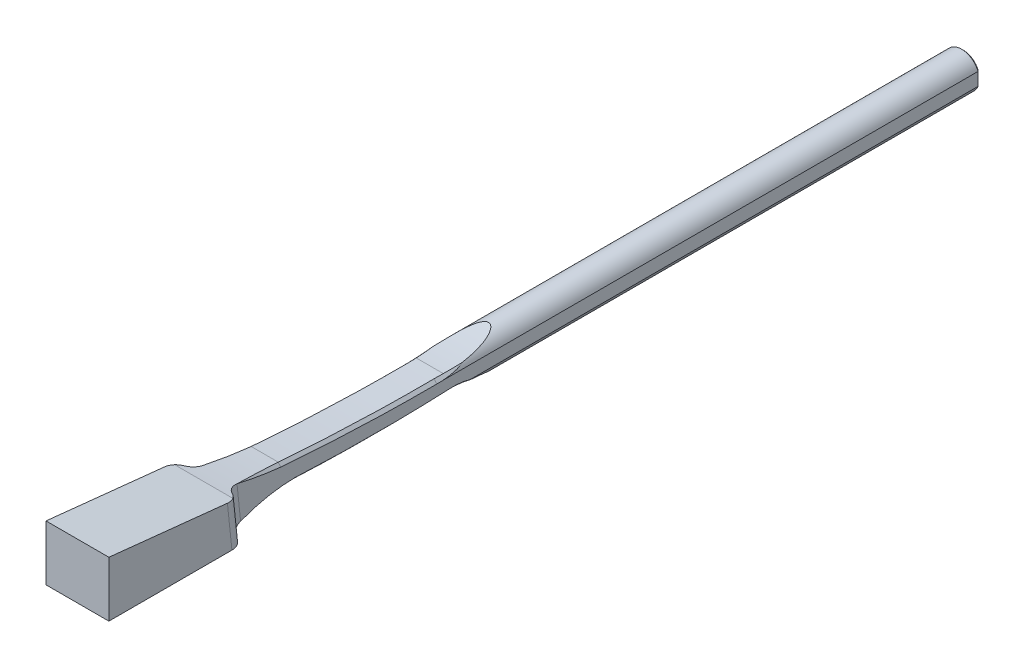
ISO-10303-21;
HEADER;
FILE_DESCRIPTION(('STEP AP214'),'2;1');
FILE_NAME('part.step','',(''),(''),'','','');
FILE_SCHEMA(('AUTOMOTIVE_DESIGN { 1 0 10303 214 1 1 1 1 }'));
ENDSEC;
DATA;
#1=APPLICATION_CONTEXT('core data for automotive mechanical design processes');
#2=APPLICATION_PROTOCOL_DEFINITION('international standard','automotive_design',2000,#1);
#3=PRODUCT_CONTEXT('',#1,'mechanical');
#4=PRODUCT('Part','Part','',(#3));
#5=PRODUCT_RELATED_PRODUCT_CATEGORY('part','',(#4));
#6=PRODUCT_DEFINITION_FORMATION('','',#4);
#7=PRODUCT_DEFINITION_CONTEXT('part definition',#1,'design');
#8=PRODUCT_DEFINITION('design','',#6,#7);
#9=PRODUCT_DEFINITION_SHAPE('','',#8);
#10=(LENGTH_UNIT() NAMED_UNIT(*) SI_UNIT(.MILLI.,.METRE.));
#11=(NAMED_UNIT(*) PLANE_ANGLE_UNIT() SI_UNIT($,.RADIAN.));
#12=(NAMED_UNIT(*) SI_UNIT($,.STERADIAN.) SOLID_ANGLE_UNIT());
#13=UNCERTAINTY_MEASURE_WITH_UNIT(LENGTH_MEASURE(1.E-05),#10,'distance_accuracy_value','');
#14=(GEOMETRIC_REPRESENTATION_CONTEXT(3) GLOBAL_UNCERTAINTY_ASSIGNED_CONTEXT((#13)) GLOBAL_UNIT_ASSIGNED_CONTEXT((#10,
#11,#12)) REPRESENTATION_CONTEXT('',''));
#15=CARTESIAN_POINT('',(0.,0.,0.));
#16=DIRECTION('',(0.,0.,1.));
#17=DIRECTION('',(1.,0.,0.));
#18=AXIS2_PLACEMENT_3D('',#15,#16,#17);
#19=CARTESIAN_POINT('',(3.683,-29.8428458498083,-43.8394641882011));
#20=DIRECTION('',(-1.,0.,0.));
#21=DIRECTION('',(0.,0.,1.));
#22=AXIS2_PLACEMENT_3D('',#19,#20,#21);
#23=CYLINDRICAL_SURFACE('',#22,32.8956869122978);
#24=CARTESIAN_POINT('',(-3.04298871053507,3.01270016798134,-45.4640605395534));
#25=CARTESIAN_POINT('',(-3.06606537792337,3.03291419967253,-45.0552433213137));
#26=CARTESIAN_POINT('',(-3.08912762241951,3.04549614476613,-44.646088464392));
#27=CARTESIAN_POINT('',(-3.13519637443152,3.05538560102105,-43.8275876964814));
#28=CARTESIAN_POINT('',(-3.15820288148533,3.05269298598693,-43.418241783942));
#29=CARTESIAN_POINT('',(-3.22711211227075,3.02168119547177,-42.1904004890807));
#30=CARTESIAN_POINT('',(-3.27289021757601,2.97041553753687,-41.3723553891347));
#31=CARTESIAN_POINT('',(-3.36325430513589,2.80804467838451,-39.7529642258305));
#32=CARTESIAN_POINT('',(-3.40784804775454,2.69771946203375,-38.9515388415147));
#33=CARTESIAN_POINT('',(-3.49620074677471,2.41836887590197,-37.3592685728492));
#34=CARTESIAN_POINT('',(-3.53996015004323,2.24937591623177,-36.5684180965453));
#35=CARTESIAN_POINT('',(-3.60000336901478,1.97459108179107,-35.4802891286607));
#36=CARTESIAN_POINT('',(-3.61673795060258,1.89327479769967,-35.1766885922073));
#37=CARTESIAN_POINT('',(-3.6500788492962,1.72175606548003,-34.5711663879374));
#38=CARTESIAN_POINT('',(-3.6666847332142,1.63153159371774,-34.2692509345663));
#39=CARTESIAN_POINT('',(-3.68319999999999,1.53698000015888,-33.968661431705));
#40=B_SPLINE_CURVE_WITH_KNOTS('',3,(#24,#25,#26,#27,#28,#29,#30,#31,#32,#33,#34,#35,#36,#37,#38,
#39),.UNSPECIFIED.,.F.,.F.,(4,2,2,2,2,2,2,4),(0.,1.22974798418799,2.45950612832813,
4.91978416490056,7.34834377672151,9.77556389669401,10.7197045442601,11.6662407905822),.UNSPECIFIED.);
#41=CARTESIAN_POINT('',(-3.04299999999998,3.01271005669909,-45.4638605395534));
#42=VERTEX_POINT('',#41);
#43=CARTESIAN_POINT('',(-3.683,1.53812480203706,-33.9723015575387));
#44=VERTEX_POINT('',#43);
#45=EDGE_CURVE('E465',#42,#44,#40,.T.);
#46=ORIENTED_EDGE('',*,*,#45,.F.);
#47=DIRECTION('',(-1.,0.,0.));
#48=VECTOR('',#47,1.);
#49=CARTESIAN_POINT('',(3.683,3.01271005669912,-45.4638605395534));
#50=LINE('',#49,#48);
#51=CARTESIAN_POINT('',(3.04299999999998,3.0127100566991,-45.4638605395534));
#52=VERTEX_POINT('',#51);
#53=EDGE_CURVE('E674',#52,#42,#50,.T.);
#54=ORIENTED_EDGE('',*,*,#53,.F.);
#55=CARTESIAN_POINT('',(3.04298871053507,3.01270016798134,-45.4640605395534));
#56=CARTESIAN_POINT('',(3.06606537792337,3.03291419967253,-45.0552433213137));
#57=CARTESIAN_POINT('',(3.08912762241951,3.04549614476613,-44.646088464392));
#58=CARTESIAN_POINT('',(3.13519637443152,3.05538560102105,-43.8275876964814));
#59=CARTESIAN_POINT('',(3.15820288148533,3.05269298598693,-43.418241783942));
#60=CARTESIAN_POINT('',(3.22711211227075,3.02168119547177,-42.1904004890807));
#61=CARTESIAN_POINT('',(3.27289021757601,2.97041553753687,-41.3723553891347));
#62=CARTESIAN_POINT('',(3.36325430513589,2.80804467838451,-39.7529642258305));
#63=CARTESIAN_POINT('',(3.40784804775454,2.69771946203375,-38.9515388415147));
#64=CARTESIAN_POINT('',(3.49620074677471,2.41836887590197,-37.3592685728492));
#65=CARTESIAN_POINT('',(3.53996015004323,2.24937591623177,-36.5684180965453));
#66=CARTESIAN_POINT('',(3.60000336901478,1.97459108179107,-35.4802891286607));
#67=CARTESIAN_POINT('',(3.61673795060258,1.89327479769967,-35.1766885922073));
#68=CARTESIAN_POINT('',(3.6500788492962,1.72175606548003,-34.5711663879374));
#69=CARTESIAN_POINT('',(3.6666847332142,1.63153159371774,-34.2692509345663));
#70=CARTESIAN_POINT('',(3.68319999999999,1.53698000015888,-33.968661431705));
#71=B_SPLINE_CURVE_WITH_KNOTS('',3,(#55,#56,#57,#58,#59,#60,#61,#62,#63,#64,#65,#66,#67,#68,#69,
#70),.UNSPECIFIED.,.F.,.F.,(4,2,2,2,2,2,2,4),(0.,1.22974798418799,2.45950612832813,
4.91978416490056,7.34834377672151,9.77556389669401,10.7197045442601,11.6662407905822),.UNSPECIFIED.);
#72=CARTESIAN_POINT('',(3.683,1.53812480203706,-33.9723015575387));
#73=VERTEX_POINT('',#72);
#74=EDGE_CURVE('E1097',#52,#73,#71,.T.);
#75=ORIENTED_EDGE('',*,*,#74,.T.);
#76=CARTESIAN_POINT('',(3.683,-29.8428458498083,-43.8394641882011));
#77=DIRECTION('',(-1.,0.,0.));
#78=DIRECTION('',(0.,0.,-1.));
#79=AXIS2_PLACEMENT_3D('',#76,#77,#78);
#80=CIRCLE('',#79,32.8956869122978);
#81=CARTESIAN_POINT('',(3.68299999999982,1.266058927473,-33.1454349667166));
#82=VERTEX_POINT('',#81);
#83=EDGE_CURVE('E739',#82,#73,#80,.T.);
#84=ORIENTED_EDGE('',*,*,#83,.F.);
#85=CARTESIAN_POINT('',(7.09999999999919,2.12871452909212,-36.097013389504));
#86=CARTESIAN_POINT('',(7.01562153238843,2.13115770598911,-36.1071127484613));
#87=CARTESIAN_POINT('',(6.93080668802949,2.13275875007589,-36.1137347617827));
#88=CARTESIAN_POINT('',(6.76090863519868,2.13427633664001,-36.1200129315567));
#89=CARTESIAN_POINT('',(6.67582544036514,2.13419296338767,-36.1196694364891));
#90=CARTESIAN_POINT('',(6.50605200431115,2.13234243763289,-36.1120093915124));
#91=CARTESIAN_POINT('',(6.42136151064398,2.13057658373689,-36.1046982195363));
#92=CARTESIAN_POINT('',(6.25293749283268,2.12536357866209,-36.0831816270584));
#93=CARTESIAN_POINT('',(6.16920395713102,2.1219164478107,-36.0689762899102));
#94=CARTESIAN_POINT('',(5.92024613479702,2.10904072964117,-36.0161307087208));
#95=CARTESIAN_POINT('',(5.75719140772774,2.09707704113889,-35.9672575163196));
#96=CARTESIAN_POINT('',(5.44195526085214,2.06638912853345,-35.8437816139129));
#97=CARTESIAN_POINT('',(5.2897717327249,2.04766621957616,-35.7691839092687));
#98=CARTESIAN_POINT('',(5.00024813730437,2.0034547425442,-35.5964498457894));
#99=CARTESIAN_POINT('',(4.86292382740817,1.97795908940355,-35.4982888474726));
#100=CARTESIAN_POINT('',(4.60711666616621,1.92033490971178,-35.2814788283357));
#101=CARTESIAN_POINT('',(4.48863680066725,1.88820533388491,-35.162826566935));
#102=CARTESIAN_POINT('',(4.2731430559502,1.81742021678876,-34.9079852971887));
#103=CARTESIAN_POINT('',(4.17624601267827,1.7787310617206,-34.7717068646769));
#104=CARTESIAN_POINT('',(4.00720785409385,1.69546970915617,-34.486232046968));
#105=CARTESIAN_POINT('',(3.93506638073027,1.65089759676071,-34.3370358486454));
#106=CARTESIAN_POINT('',(3.81643343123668,1.55602464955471,-34.0280636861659));
#107=CARTESIAN_POINT('',(3.7702906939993,1.50565636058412,-33.8681746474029));
#108=CARTESIAN_POINT('',(3.70602590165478,1.40075378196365,-33.5441887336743));
#109=CARTESIAN_POINT('',(3.68790782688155,1.34621890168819,-33.3800912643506));
#110=CARTESIAN_POINT('',(3.67974530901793,1.23310783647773,-33.0486050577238));
#111=CARTESIAN_POINT('',(3.69031963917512,1.17446957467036,-32.8812223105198));
#112=CARTESIAN_POINT('',(3.74029324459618,1.05592248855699,-32.5512807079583));
#113=CARTESIAN_POINT('',(3.77969569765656,0.996013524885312,-32.3887223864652));
#114=CARTESIAN_POINT('',(3.88730646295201,0.875528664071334,-32.0692706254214));
#115=CARTESIAN_POINT('',(3.956117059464,0.814966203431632,-31.9125746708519));
#116=CARTESIAN_POINT('',(4.12079547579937,0.696684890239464,-31.6128838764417));
#117=CARTESIAN_POINT('',(4.21666792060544,0.638966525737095,-31.4698913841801));
#118=CARTESIAN_POINT('',(4.43341316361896,0.528566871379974,-31.201240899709));
#119=CARTESIAN_POINT('',(4.5543584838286,0.475900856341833,-31.0756349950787));
#120=CARTESIAN_POINT('',(4.81793975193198,0.378255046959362,-30.8461250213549));
#121=CARTESIAN_POINT('',(4.96056856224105,0.333272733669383,-30.7422138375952));
#122=CARTESIAN_POINT('',(5.25937293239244,0.254488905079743,-30.5621871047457));
#123=CARTESIAN_POINT('',(5.41503419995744,0.220400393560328,-30.4853513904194));
#124=CARTESIAN_POINT('',(5.65763994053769,0.177800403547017,-30.3899954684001));
#125=CARTESIAN_POINT('',(5.74006752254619,0.165018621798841,-30.3615179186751));
#126=CARTESIAN_POINT('',(5.90737613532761,0.142475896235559,-30.3114393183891));
#127=CARTESIAN_POINT('',(5.99225607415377,0.132713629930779,-30.2898352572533));
#128=CARTESIAN_POINT('',(6.16145328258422,0.116587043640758,-30.2542159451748));
#129=CARTESIAN_POINT('',(6.24572221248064,0.110136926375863,-30.2400089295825));
#130=CARTESIAN_POINT('',(6.41531139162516,0.100333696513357,-30.2184380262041));
#131=CARTESIAN_POINT('',(6.50063162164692,0.0969805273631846,-30.2110740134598));
#132=CARTESIAN_POINT('',(6.67184930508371,0.0934221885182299,-30.2032585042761));
#133=CARTESIAN_POINT('',(6.7577476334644,0.0932242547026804,-30.2028228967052));
#134=CARTESIAN_POINT('',(6.92926017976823,0.0959877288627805,-30.2088947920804));
#135=CARTESIAN_POINT('',(7.01487435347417,0.098949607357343,-30.2154033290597));
#136=CARTESIAN_POINT('',(7.09999999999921,0.103487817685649,-30.2253789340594));
#137=B_SPLINE_CURVE_WITH_KNOTS('',3,(#85,#86,#87,#88,#89,#90,#91,#92,#93,#94,#95,#96,#97,#98,
#99,#100,#101,#102,#103,#104,#105,#106,#107,#108,#109,#110,#111,#112,#113,#114,#115,#116,#117,
#118,#119,#120,#121,#122,#123,#124,#125,#126,#127,#128,#129,#130,#131,#132,#133,#134,#135,#136),
.UNSPECIFIED.,.F.,.F.,(4,2,2,2,2,2,2,2,2,2,2,2,2,2,2,2,2,2,2,2,2,2,2,2,2,4),(0.,
0.254964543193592,0.50991633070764,0.764671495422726,1.01942358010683,1.52871059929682,
2.03789857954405,2.54762134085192,3.05742478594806,3.56992431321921,4.08241642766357,
4.6016285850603,5.12091447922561,5.65148765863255,6.18211933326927,6.72418253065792,
7.26633842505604,7.81008492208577,8.35365281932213,8.8814202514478,9.14554714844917,
9.40955819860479,9.6663332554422,9.92310362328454,10.180462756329,10.43786021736),.UNSPECIFIED.);
#138=CARTESIAN_POINT('',(5.39149999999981,0.227538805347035,-30.5016163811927));
#139=VERTEX_POINT('',#138);
#140=EDGE_CURVE('E1104',#82,#139,#137,.T.);
#141=ORIENTED_EDGE('',*,*,#140,.T.);
#142=CARTESIAN_POINT('',(1.95843217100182,0.,-30.));
#143=CARTESIAN_POINT('',(2.01792961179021,0.0250069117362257,-30.0539234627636));
#144=CARTESIAN_POINT('',(2.07986860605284,0.0488408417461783,-30.1057013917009));
#145=CARTESIAN_POINT('',(2.20824414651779,0.0940612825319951,-30.2045545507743));
#146=CARTESIAN_POINT('',(2.27468131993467,0.115447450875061,-30.2516291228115));
#147=CARTESIAN_POINT('',(2.41166596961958,0.15566831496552,-30.340658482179));
#148=CARTESIAN_POINT('',(2.48221435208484,0.174502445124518,-30.382612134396));
#149=CARTESIAN_POINT('',(2.62690981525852,0.209521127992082,-30.4610003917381));
#150=CARTESIAN_POINT('',(2.70105665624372,0.225705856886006,-30.4974353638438));
#151=CARTESIAN_POINT('',(2.92839602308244,0.270210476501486,-30.5980334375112));
#152=CARTESIAN_POINT('',(3.08641369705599,0.294459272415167,-30.6534416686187));
#153=CARTESIAN_POINT('',(3.41032737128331,0.331564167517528,-30.7385719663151));
#154=CARTESIAN_POINT('',(3.57621869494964,0.34442694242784,-30.768309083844));
#155=CARTESIAN_POINT('',(3.9077138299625,0.358442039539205,-30.8007244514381));
#156=CARTESIAN_POINT('',(4.07325497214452,0.359827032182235,-30.8039403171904));
#157=CARTESIAN_POINT('',(4.40256338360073,0.351466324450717,-30.784586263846));
#158=CARTESIAN_POINT('',(4.56633038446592,0.341718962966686,-30.76201249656));
#159=CARTESIAN_POINT('',(4.88612650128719,0.311375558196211,-30.6921995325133));
#160=CARTESIAN_POINT('',(5.04220511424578,0.290862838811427,-30.6451498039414));
#161=CARTESIAN_POINT('',(5.3436879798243,0.239374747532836,-30.5281804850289));
#162=CARTESIAN_POINT('',(5.48909515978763,0.208402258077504,-30.4582671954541));
#163=CARTESIAN_POINT('',(5.72098780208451,0.148121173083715,-30.3238568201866));
#164=CARTESIAN_POINT('',(5.81140259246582,0.121470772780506,-30.2648269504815));
#165=CARTESIAN_POINT('',(5.98446742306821,0.063891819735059,-30.1384396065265));
#166=CARTESIAN_POINT('',(6.06713150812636,0.0329712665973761,-30.0710977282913));
#167=CARTESIAN_POINT('',(6.14556782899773,0.,-30.));
#168=B_SPLINE_CURVE_WITH_KNOTS('',3,(#142,#143,#144,#145,#146,#147,#148,#149,#150,#151,#152,
#153,#154,#155,#156,#157,#158,#159,#160,#161,#162,#163,#164,#165,#166,#167),.UNSPECIFIED.,.F.,
.F.,(4,2,2,2,2,2,2,2,2,2,2,2,4),(0.,0.25223664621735,0.504508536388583,0.756836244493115,
1.00914716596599,1.51403722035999,2.01863105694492,2.5129704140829,3.00738354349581,
3.49802515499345,3.98853166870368,4.32156220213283,4.6539770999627),.UNSPECIFIED.);
#169=CARTESIAN_POINT('',(6.14556782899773,0.,-30.));
#170=VERTEX_POINT('',#169);
#171=EDGE_CURVE('E1158',#139,#170,#168,.T.);
#172=ORIENTED_EDGE('',*,*,#171,.T.);
#173=DIRECTION('',(-1.,0.,0.));
#174=VECTOR('',#173,1.);
#175=CARTESIAN_POINT('',(3.683,0.,-30.));
#176=LINE('',#175,#174);
#177=CARTESIAN_POINT('',(-6.1455678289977,0.,-30.));
#178=VERTEX_POINT('',#177);
#179=EDGE_CURVE('E745',#170,#178,#176,.T.);
#180=ORIENTED_EDGE('',*,*,#179,.T.);
#181=CARTESIAN_POINT('',(-6.1455678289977,0.,-30.));
#182=CARTESIAN_POINT('',(-6.09013028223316,0.0232996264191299,-30.0502419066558));
#183=CARTESIAN_POINT('',(-6.03257342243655,0.045581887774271,-30.0986233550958));
#184=CARTESIAN_POINT('',(-5.91389534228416,0.087898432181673,-30.191045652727));
#185=CARTESIAN_POINT('',(-5.85279746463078,0.107945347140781,-30.2351107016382));
#186=CARTESIAN_POINT('',(-5.72703984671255,0.145858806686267,-30.3188899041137));
#187=CARTESIAN_POINT('',(-5.66238000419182,0.163725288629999,-30.3586039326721));
#188=CARTESIAN_POINT('',(-5.52946919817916,0.197308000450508,-30.4336048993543));
#189=CARTESIAN_POINT('',(-5.46119899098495,0.213010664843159,-30.4688638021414));
#190=CARTESIAN_POINT('',(-5.39149999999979,0.227538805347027,-30.5016163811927));
#191=B_SPLINE_CURVE_WITH_KNOTS('',3,(#181,#182,#183,#184,#185,#186,#187,#188,#189,#190),
.UNSPECIFIED.,.F.,.F.,(4,2,2,2,4),(0.,0.235031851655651,0.468659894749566,0.702294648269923,
0.937333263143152),.UNSPECIFIED.);
#192=CARTESIAN_POINT('',(-5.39149999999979,0.227538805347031,-30.5016163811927));
#193=VERTEX_POINT('',#192);
#194=EDGE_CURVE('E1131',#178,#193,#191,.T.);
#195=ORIENTED_EDGE('',*,*,#194,.T.);
#196=CARTESIAN_POINT('',(-7.10000000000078,0.103487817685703,-30.2253789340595));
#197=CARTESIAN_POINT('',(-7.01861708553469,0.0991506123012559,-30.2158442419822));
#198=CARTESIAN_POINT('',(-6.93679002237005,0.0962522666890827,-30.2094754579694));
#199=CARTESIAN_POINT('',(-6.7728453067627,0.0933433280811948,-30.2030846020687));
#200=CARTESIAN_POINT('',(-6.69072768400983,0.0933324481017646,-30.2030618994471));
#201=CARTESIAN_POINT('',(-6.52694557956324,0.0962047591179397,-30.2093699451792));
#202=CARTESIAN_POINT('',(-6.44528052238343,0.0990822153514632,-30.2156881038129));
#203=CARTESIAN_POINT('',(-6.28285222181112,0.107674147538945,-30.2345874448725));
#204=CARTESIAN_POINT('',(-6.20208897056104,0.11338859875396,-30.2471685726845));
#205=CARTESIAN_POINT('',(-5.96197336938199,0.134689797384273,-30.2941764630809));
#206=CARTESIAN_POINT('',(-5.80468230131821,0.1544365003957,-30.3378722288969));
#207=CARTESIAN_POINT('',(-5.50026340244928,0.203961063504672,-30.4484509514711));
#208=CARTESIAN_POINT('',(-5.35313696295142,0.233740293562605,-30.5153370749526));
#209=CARTESIAN_POINT('',(-5.07020437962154,0.302453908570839,-30.6715296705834));
#210=CARTESIAN_POINT('',(-4.93463570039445,0.341536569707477,-30.7612010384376));
#211=CARTESIAN_POINT('',(-4.68089440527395,0.426786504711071,-30.9597426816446));
#212=CARTESIAN_POINT('',(-4.56272742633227,0.472956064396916,-31.0686191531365));
#213=CARTESIAN_POINT('',(-4.34142715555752,0.572735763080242,-31.3080572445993));
#214=CARTESIAN_POINT('',(-4.23923171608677,0.626590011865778,-31.4393843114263));
#215=CARTESIAN_POINT('',(-4.05908349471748,0.737851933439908,-31.7163702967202));
#216=CARTESIAN_POINT('',(-3.98113412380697,0.79526010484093,-31.8620312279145));
#217=CARTESIAN_POINT('',(-3.84902125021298,0.913664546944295,-32.1693606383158));
#218=CARTESIAN_POINT('',(-3.79579929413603,0.974715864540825,-32.3314136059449));
#219=CARTESIAN_POINT('',(-3.71884667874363,1.09635559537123,-32.6625621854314));
#220=CARTESIAN_POINT('',(-3.69511867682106,1.15694396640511,-32.8316584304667));
#221=CARTESIAN_POINT('',(-3.67801433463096,1.27611267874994,-33.173184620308));
#222=CARTESIAN_POINT('',(-3.68481126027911,1.33467965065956,-33.3456280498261));
#223=CARTESIAN_POINT('',(-3.72934007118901,1.4477749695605,-33.6878270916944));
#224=CARTESIAN_POINT('',(-3.76706801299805,1.5023038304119,-33.8575830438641));
#225=CARTESIAN_POINT('',(-3.87176960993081,1.60501268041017,-34.1860964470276));
#226=CARTESIAN_POINT('',(-3.93819055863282,1.65329128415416,-34.3449990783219));
#227=CARTESIAN_POINT('',(-4.09855841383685,1.7436823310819,-34.6501875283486));
#228=CARTESIAN_POINT('',(-4.19250390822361,1.78579509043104,-34.7964739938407));
#229=CARTESIAN_POINT('',(-4.40287814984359,1.86228490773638,-35.0684643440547));
#230=CARTESIAN_POINT('',(-4.51873424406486,1.89681886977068,-35.1945672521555));
#231=CARTESIAN_POINT('',(-4.7710247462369,1.95899353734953,-35.4261629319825));
#232=CARTESIAN_POINT('',(-4.90745319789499,1.98663623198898,-35.5316616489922));
#233=CARTESIAN_POINT('',(-5.19471184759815,2.03449580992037,-35.7172490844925));
#234=CARTESIAN_POINT('',(-5.34528835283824,2.05482033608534,-35.7977035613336));
#235=CARTESIAN_POINT('',(-5.65844152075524,2.08860223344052,-35.9329007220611));
#236=CARTESIAN_POINT('',(-5.82102194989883,2.10205743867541,-35.9876352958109));
#237=CARTESIAN_POINT('',(-6.07756663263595,2.11753250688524,-36.0509517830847));
#238=CARTESIAN_POINT('',(-6.16911671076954,2.12197012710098,-36.0692028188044));
#239=CARTESIAN_POINT('',(-6.35359692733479,2.12881326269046,-36.0974071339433));
#240=CARTESIAN_POINT('',(-6.44652721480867,2.13121855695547,-36.1073595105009));
#241=CARTESIAN_POINT('',(-6.63309726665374,2.13399854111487,-36.1188625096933));
#242=CARTESIAN_POINT('',(-6.72673800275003,2.13436959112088,-36.1203980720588));
#243=CARTESIAN_POINT('',(-6.91376210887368,2.13307181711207,-36.1150321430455));
#244=CARTESIAN_POINT('',(-7.00714548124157,2.13140301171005,-36.1081307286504));
#245=CARTESIAN_POINT('',(-7.10000000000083,2.12871452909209,-36.0970133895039));
#246=B_SPLINE_CURVE_WITH_KNOTS('',3,(#196,#197,#198,#199,#200,#201,#202,#203,#204,#205,#206,
#207,#208,#209,#210,#211,#212,#213,#214,#215,#216,#217,#218,#219,#220,#221,#222,#223,#224,#225,
#226,#227,#228,#229,#230,#231,#232,#233,#234,#235,#236,#237,#238,#239,#240,#241,#242,#243,#244,
#245),.UNSPECIFIED.,.F.,.F.,(4,2,2,2,2,2,2,2,2,2,2,2,2,2,2,2,2,2,2,2,2,2,2,2,4),(0.,
0.246082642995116,0.492140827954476,0.737711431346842,0.983279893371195,1.47408217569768,
1.96495150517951,2.46424069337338,2.96369126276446,3.48604443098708,4.00847105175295,
4.5494244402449,5.09042656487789,5.63450340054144,6.17851088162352,6.71247644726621,
7.24641462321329,7.76795595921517,8.2893465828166,8.80272038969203,9.31625596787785,
9.59628622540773,9.87634694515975,10.1569086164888,10.4374677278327),.UNSPECIFIED.);
#247=CARTESIAN_POINT('',(-3.68299999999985,1.26605892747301,-33.1454349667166));
#248=VERTEX_POINT('',#247);
#249=EDGE_CURVE('E714',#193,#248,#246,.T.);
#250=ORIENTED_EDGE('',*,*,#249,.T.);
#251=CARTESIAN_POINT('',(-3.683,-29.8428458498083,-43.8394641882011));
#252=DIRECTION('',(-1.,0.,0.));
#253=DIRECTION('',(0.,0.,-1.));
#254=AXIS2_PLACEMENT_3D('',#251,#252,#253);
#255=CIRCLE('',#254,32.8956869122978);
#256=EDGE_CURVE('E676',#248,#44,#255,.T.);
#257=ORIENTED_EDGE('',*,*,#256,.T.);
#258=EDGE_LOOP('',(#46,#54,#75,#84,#141,#172,#180,#195,#250,#257));
#259=FACE_BOUND('',#258,.T.);
#260=ADVANCED_FACE('F116',(#259),#23,.F.);
#261=CARTESIAN_POINT('',(3.683,234.226929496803,-60.8593790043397));
#262=DIRECTION('',(-1.,0.,0.));
#263=DIRECTION('',(0.,0.,1.));
#264=AXIS2_PLACEMENT_3D('',#261,#262,#263);
#265=CYLINDRICAL_SURFACE('',#264,227.040277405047);
#266=DIRECTION('',(-1.,0.,0.));
#267=VECTOR('',#266,1.);
#268=CARTESIAN_POINT('',(3.683,7.94959863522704,-42.2621452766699));
#269=LINE('',#268,#267);
#270=CARTESIAN_POINT('',(3.04299999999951,7.94959863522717,-42.2621452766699));
#271=VERTEX_POINT('',#270);
#272=CARTESIAN_POINT('',(-3.04299999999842,7.94959863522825,-42.26214527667));
#273=VERTEX_POINT('',#272);
#274=EDGE_CURVE('E756',#271,#273,#269,.T.);
#275=ORIENTED_EDGE('',*,*,#274,.T.);
#276=CARTESIAN_POINT('',(-3.04299487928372,7.94958219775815,-42.2623452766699));
#277=CARTESIAN_POINT('',(-3.06416455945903,8.01756531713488,-41.4351383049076));
#278=CARTESIAN_POINT('',(-3.09348554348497,8.09007211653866,-40.6085143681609));
#279=CARTESIAN_POINT('',(-3.16827008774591,8.24402989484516,-38.9572413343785));
#280=CARTESIAN_POINT('',(-3.21372570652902,8.32547646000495,-38.1325914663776));
#281=CARTESIAN_POINT('',(-3.3206402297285,8.49727698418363,-36.4852667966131));
#282=CARTESIAN_POINT('',(-3.38209902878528,8.58763088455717,-35.6625919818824));
#283=CARTESIAN_POINT('',(-3.52083624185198,8.7772089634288,-34.0191881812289));
#284=CARTESIAN_POINT('',(-3.59812242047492,8.87643748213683,-33.1984603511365));
#285=CARTESIAN_POINT('',(-3.68319999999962,8.98004003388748,-32.3790989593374));
#286=B_SPLINE_CURVE_WITH_KNOTS('',3,(#276,#277,#278,#279,#280,#281,#282,#283,#284,#285),
.UNSPECIFIED.,.F.,.F.,(4,2,2,2,4),(0.,2.49074108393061,4.98025792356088,7.46975837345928,
9.96048306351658),.UNSPECIFIED.);
#287=CARTESIAN_POINT('',(-3.68299999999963,8.97979645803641,-32.381025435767));
#288=VERTEX_POINT('',#287);
#289=EDGE_CURVE('E429',#273,#288,#286,.T.);
#290=ORIENTED_EDGE('',*,*,#289,.T.);
#291=CARTESIAN_POINT('',(-3.683,234.226929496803,-60.8593790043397));
#292=DIRECTION('',(-1.,0.,0.));
#293=DIRECTION('',(0.,0.,-1.));
#294=AXIS2_PLACEMENT_3D('',#291,#292,#293);
#295=CIRCLE('',#294,227.040277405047);
#296=CARTESIAN_POINT('',(-3.68300000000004,8.98573885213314,-32.3340639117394));
#297=VERTEX_POINT('',#296);
#298=EDGE_CURVE('E743',#288,#297,#295,.T.);
#299=ORIENTED_EDGE('',*,*,#298,.T.);
#300=CARTESIAN_POINT('',(-7.09999999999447,8.61692314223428,-35.4150751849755));
#301=CARTESIAN_POINT('',(-7.01667521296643,8.61575620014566,-35.4254253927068));
#302=CARTESIAN_POINT('',(-6.9329117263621,8.61498616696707,-35.4322564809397));
#303=CARTESIAN_POINT('',(-6.76510876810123,8.61424098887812,-35.4388675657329));
#304=CARTESIAN_POINT('',(-6.68106931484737,8.61426579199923,-35.4386480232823));
#305=CARTESIAN_POINT('',(-6.51340196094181,8.61511071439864,-35.4311506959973));
#306=CARTESIAN_POINT('',(-6.42977369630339,8.615929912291,-35.4238810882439));
#307=CARTESIAN_POINT('',(-6.26345421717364,8.61835620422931,-35.4023695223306));
#308=CARTESIAN_POINT('',(-6.18076299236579,8.61996328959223,-35.3881276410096));
#309=CARTESIAN_POINT('',(-5.93490563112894,8.62595803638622,-35.3350655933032));
#310=CARTESIAN_POINT('',(-5.77386996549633,8.6315196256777,-35.2859050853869));
#311=CARTESIAN_POINT('',(-5.46242551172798,8.64564348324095,-35.1616197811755));
#312=CARTESIAN_POINT('',(-5.3120157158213,8.65420546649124,-35.0864974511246));
#313=CARTESIAN_POINT('',(-5.02483621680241,8.67420628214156,-34.912041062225));
#314=CARTESIAN_POINT('',(-4.88815965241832,8.68566311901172,-34.8125556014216));
#315=CARTESIAN_POINT('',(-4.63313611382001,8.71117168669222,-34.5926172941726));
#316=CARTESIAN_POINT('',(-4.51479329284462,8.72522400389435,-34.4721597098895));
#317=CARTESIAN_POINT('',(-4.29727623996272,8.75590973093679,-34.2112201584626));
#318=CARTESIAN_POINT('',(-4.19852606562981,8.7725885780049,-34.0703901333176));
#319=CARTESIAN_POINT('',(-4.02558847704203,8.80792896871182,-33.7746244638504));
#320=CARTESIAN_POINT('',(-3.95140242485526,8.82659062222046,-33.6196880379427));
#321=CARTESIAN_POINT('',(-3.8278282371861,8.86592659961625,-33.2961226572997));
#322=CARTESIAN_POINT('',(-3.77907963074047,8.88663854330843,-33.127253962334));
#323=CARTESIAN_POINT('',(-3.71023644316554,8.92915994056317,-32.7838999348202));
#324=CARTESIAN_POINT('',(-3.69014607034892,8.95096955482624,-32.6094137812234));
#325=CARTESIAN_POINT('',(-3.67893545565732,8.99553692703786,-32.256238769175));
#326=CARTESIAN_POINT('',(-3.68837498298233,9.01830483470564,-32.0775332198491));
#327=CARTESIAN_POINT('',(-3.7371833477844,9.06373766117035,-31.724239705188));
#328=CARTESIAN_POINT('',(-3.77655300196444,9.08640257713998,-31.5496518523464));
#329=CARTESIAN_POINT('',(-3.88453460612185,9.13105975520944,-31.2086331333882));
#330=CARTESIAN_POINT('',(-3.95329895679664,9.15304786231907,-31.0422498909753));
#331=CARTESIAN_POINT('',(-4.11838104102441,9.19550201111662,-30.7235185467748));
#332=CARTESIAN_POINT('',(-4.21469985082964,9.21596799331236,-30.571170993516));
#333=CARTESIAN_POINT('',(-4.43099981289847,9.25439913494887,-30.2870307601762));
#334=CARTESIAN_POINT('',(-4.55066541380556,9.27239271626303,-30.1550019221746));
#335=CARTESIAN_POINT('',(-4.81119462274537,9.30549637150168,-29.9134360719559));
#336=CARTESIAN_POINT('',(-4.95205121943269,9.32060739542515,-29.8038916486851));
#337=CARTESIAN_POINT('',(-5.24699294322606,9.34698017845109,-29.6134995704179));
#338=CARTESIAN_POINT('',(-5.40063126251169,9.35833293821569,-29.5319713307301));
#339=CARTESIAN_POINT('',(-5.71994973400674,9.37725653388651,-29.3964345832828));
#340=CARTESIAN_POINT('',(-5.8856298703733,9.38482737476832,-29.3424260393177));
#341=CARTESIAN_POINT('',(-6.13994160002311,9.39312051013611,-29.2833396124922));
#342=CARTESIAN_POINT('',(-6.22611293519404,9.39537776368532,-29.2672746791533));
#343=CARTESIAN_POINT('',(-6.39958063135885,9.39882389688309,-29.2427590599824));
#344=CARTESIAN_POINT('',(-6.48687701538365,9.40001275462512,-29.2343085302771));
#345=CARTESIAN_POINT('',(-6.66202855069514,9.40130666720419,-29.2251109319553));
#346=CARTESIAN_POINT('',(-6.74988440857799,9.40140983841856,-29.2243772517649));
#347=CARTESIAN_POINT('',(-6.92532208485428,9.40052932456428,-29.2306371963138));
#348=CARTESIAN_POINT('',(-7.01290387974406,9.39954554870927,-29.2376314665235));
#349=CARTESIAN_POINT('',(-7.09999999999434,9.398019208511,-29.2484843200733));
#350=B_SPLINE_CURVE_WITH_KNOTS('',3,(#300,#301,#302,#303,#304,#305,#306,#307,#308,#309,#310,
#311,#312,#313,#314,#315,#316,#317,#318,#319,#320,#321,#322,#323,#324,#325,#326,#327,#328,#329,
#330,#331,#332,#333,#334,#335,#336,#337,#338,#339,#340,#341,#342,#343,#344,#345,#346,#347,#348,
#349),.UNSPECIFIED.,.F.,.F.,(4,2,2,2,2,2,2,2,2,2,2,2,2,2,2,2,2,2,2,2,2,2,2,2,4),(0.,
0.25183780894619,0.503659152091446,0.755188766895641,1.00671560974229,1.50951474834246,
2.01226613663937,2.51822483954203,3.02429799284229,3.54035158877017,4.05643379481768,
4.58493195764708,5.11350771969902,5.65216346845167,6.19083391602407,6.732331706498,
7.27385065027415,7.80850258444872,8.34297800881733,8.86335871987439,9.38373874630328,
9.64650965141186,9.90928594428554,10.1725180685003,10.4357721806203),.UNSPECIFIED.);
#351=CARTESIAN_POINT('',(-5.39150000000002,9.35693543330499,-29.5420781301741));
#352=VERTEX_POINT('',#351);
#353=EDGE_CURVE('E686',#297,#352,#350,.T.);
#354=ORIENTED_EDGE('',*,*,#353,.T.);
#355=CARTESIAN_POINT('',(-5.39150000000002,9.35693543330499,-29.5420781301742));
#356=CARTESIAN_POINT('',(-5.46951232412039,9.36235804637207,-29.5031426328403));
#357=CARTESIAN_POINT('',(-5.54579804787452,9.36826127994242,-29.4608282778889));
#358=CARTESIAN_POINT('',(-5.69440823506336,9.38098621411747,-29.369833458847));
#359=CARTESIAN_POINT('',(-5.76673214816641,9.38780804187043,-29.3211521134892));
#360=CARTESIAN_POINT('',(-5.90539920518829,9.40217157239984,-29.2189240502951));
#361=CARTESIAN_POINT('',(-5.97183679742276,9.40969489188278,-29.1655027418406));
#362=CARTESIAN_POINT('',(-6.09995640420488,9.42552885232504,-29.0533883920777));
#363=CARTESIAN_POINT('',(-6.1616401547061,9.4338392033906,-28.9946972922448));
#364=CARTESIAN_POINT('',(-6.28508007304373,9.45196170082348,-28.8671000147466));
#365=CARTESIAN_POINT('',(-6.3463674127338,9.46184164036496,-28.7977493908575));
#366=CARTESIAN_POINT('',(-6.46314000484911,9.48252591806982,-28.6530744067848));
#367=CARTESIAN_POINT('',(-6.51854813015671,9.49333980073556,-28.5776891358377));
#368=CARTESIAN_POINT('',(-6.5704106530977,9.50452706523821,-28.5));
#369=B_SPLINE_CURVE_WITH_KNOTS('',3,(#355,#356,#357,#358,#359,#360,#361,#362,#363,#364,#365,
#366,#367,#368),.UNSPECIFIED.,.F.,.F.,(4,2,2,2,2,2,4),(0.,0.261980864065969,0.523998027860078,
0.780445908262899,1.0367996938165,1.31565362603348,1.59780299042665),.UNSPECIFIED.);
#370=CARTESIAN_POINT('',(-6.57041065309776,9.50452706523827,-28.4999999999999));
#371=VERTEX_POINT('',#370);
#372=EDGE_CURVE('E721',#352,#371,#369,.T.);
#373=ORIENTED_EDGE('',*,*,#372,.T.);
#374=DIRECTION('',(-1.,0.,0.));
#375=VECTOR('',#374,1.);
#376=CARTESIAN_POINT('',(3.683,9.50452706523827,-28.4999999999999));
#377=LINE('',#376,#375);
#378=CARTESIAN_POINT('',(6.57041065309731,9.50452706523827,-28.4999999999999));
#379=VERTEX_POINT('',#378);
#380=EDGE_CURVE('E754',#379,#371,#377,.T.);
#381=ORIENTED_EDGE('',*,*,#380,.F.);
#382=CARTESIAN_POINT('',(6.57041065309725,9.50452706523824,-28.5));
#383=CARTESIAN_POINT('',(6.52276511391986,9.49425054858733,-28.5713648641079));
#384=CARTESIAN_POINT('',(6.47213566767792,9.48428930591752,-28.6407837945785));
#385=CARTESIAN_POINT('',(6.36523644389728,9.46505417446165,-28.7752465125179));
#386=CARTESIAN_POINT('',(6.30896608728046,9.45578035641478,-28.8402898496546));
#387=CARTESIAN_POINT('',(6.19109825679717,9.43797536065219,-28.9655289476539));
#388=CARTESIAN_POINT('',(6.12949860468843,9.42944448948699,-29.0257227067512));
#389=CARTESIAN_POINT('',(6.00142181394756,9.41318525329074,-29.1407514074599));
#390=CARTESIAN_POINT('',(5.93494493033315,9.40545684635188,-29.1955866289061));
#391=CARTESIAN_POINT('',(5.72864826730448,9.38353225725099,-29.3515178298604));
#392=CARTESIAN_POINT('',(5.58200208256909,9.37060267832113,-29.4439972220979));
#393=CARTESIAN_POINT('',(5.27501205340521,9.34850467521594,-29.6025705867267));
#394=CARTESIAN_POINT('',(5.11467703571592,9.33933384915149,-29.6686814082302));
#395=CARTESIAN_POINT('',(4.78814963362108,9.32511620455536,-29.7713654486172));
#396=CARTESIAN_POINT('',(4.62213878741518,9.31999049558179,-29.8085035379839));
#397=CARTESIAN_POINT('',(4.28611267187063,9.31369495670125,-29.8541368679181));
#398=CARTESIAN_POINT('',(4.11609663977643,9.31252588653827,-29.8626266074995));
#399=CARTESIAN_POINT('',(3.77990659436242,9.31416163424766,-29.8507601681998));
#400=CARTESIAN_POINT('',(3.61371538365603,9.31690140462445,-29.8308761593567));
#401=CARTESIAN_POINT('',(3.28710242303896,9.32616826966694,-29.7637796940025));
#402=CARTESIAN_POINT('',(3.12667926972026,9.33269443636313,-29.7165739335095));
#403=CARTESIAN_POINT('',(2.81584186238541,9.34938114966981,-29.5963100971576));
#404=CARTESIAN_POINT('',(2.66543931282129,9.35954586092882,-29.5232223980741));
#405=CARTESIAN_POINT('',(2.37882617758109,9.38326413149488,-29.3534902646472));
#406=CARTESIAN_POINT('',(2.24261976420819,9.39681868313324,-29.2568389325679));
#407=CARTESIAN_POINT('',(2.00332428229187,9.42516588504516,-29.0558630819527));
#408=CARTESIAN_POINT('',(1.89822222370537,9.43961056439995,-28.9538800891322));
#409=CARTESIAN_POINT('',(1.7523777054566,9.46283606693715,-28.7908135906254));
#410=CARTESIAN_POINT('',(1.70574202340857,9.47083526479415,-28.7347926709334));
#411=CARTESIAN_POINT('',(1.61655822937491,9.48732249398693,-28.6196520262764));
#412=CARTESIAN_POINT('',(1.57401021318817,9.49581053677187,-28.560532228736));
#413=CARTESIAN_POINT('',(1.53358934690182,9.50452706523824,-28.5));
#414=B_SPLINE_CURVE_WITH_KNOTS('',3,(#382,#383,#384,#385,#386,#387,#388,#389,#390,#391,#392,
#393,#394,#395,#396,#397,#398,#399,#400,#401,#402,#403,#404,#405,#406,#407,#408,#409,#410,#411,
#412,#413),.UNSPECIFIED.,.F.,.F.,(4,2,2,2,2,2,2,2,2,2,2,2,2,2,2,4),(0.,0.259190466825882,
0.51840756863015,0.777731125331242,1.03704113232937,1.555833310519,2.07429345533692,
2.58237354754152,3.09055119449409,3.59037017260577,4.09006670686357,4.59033702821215,
5.09075396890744,5.53065271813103,5.75048273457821,5.9703179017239),.UNSPECIFIED.);
#415=CARTESIAN_POINT('',(5.39149999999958,9.35693543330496,-29.5420781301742));
#416=VERTEX_POINT('',#415);
#417=EDGE_CURVE('E1110',#379,#416,#414,.T.);
#418=ORIENTED_EDGE('',*,*,#417,.T.);
#419=CARTESIAN_POINT('',(7.10000000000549,9.39801920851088,-29.248484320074));
#420=CARTESIAN_POINT('',(7.01711604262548,9.39947145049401,-29.238157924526));
#421=CARTESIAN_POINT('',(6.93379225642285,9.40043270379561,-29.2313238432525));
#422=CARTESIAN_POINT('',(6.76686545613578,9.40137091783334,-29.2246539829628));
#423=CARTESIAN_POINT('',(6.6832624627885,9.40134795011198,-29.2248176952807));
#424=CARTESIAN_POINT('',(6.51647708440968,9.40031630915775,-29.2321506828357));
#425=CARTESIAN_POINT('',(6.43329428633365,9.39930895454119,-29.2393105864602));
#426=CARTESIAN_POINT('',(6.26785760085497,9.3963233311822,-29.2605466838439));
#427=CARTESIAN_POINT('',(6.1856037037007,9.39434507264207,-29.2746228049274));
#428=CARTESIAN_POINT('',(5.9410482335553,9.38697731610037,-29.3270974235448));
#429=CARTESIAN_POINT('',(5.78086112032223,9.38015424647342,-29.3757463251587));
#430=CARTESIAN_POINT('',(5.47100835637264,9.36296683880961,-29.4987401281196));
#431=CARTESIAN_POINT('',(5.3213422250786,9.35260266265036,-29.5730838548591));
#432=CARTESIAN_POINT('',(5.03512421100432,9.32862686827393,-29.7458981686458));
#433=CARTESIAN_POINT('',(4.89869893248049,9.31498755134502,-29.8445747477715));
#434=CARTESIAN_POINT('',(4.6439648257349,9.2850130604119,-30.0627251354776));
#435=CARTESIAN_POINT('',(4.52566054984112,9.26867721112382,-30.1822041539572));
#436=CARTESIAN_POINT('',(4.30727840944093,9.23342515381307,-30.4418161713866));
#437=CARTESIAN_POINT('',(4.20774598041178,9.21445350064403,-30.5824003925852));
#438=CARTESIAN_POINT('',(4.03317056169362,9.17490175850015,-30.8778085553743));
#439=CARTESIAN_POINT('',(3.95812946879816,9.15432154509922,-31.0326335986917));
#440=CARTESIAN_POINT('',(3.83257683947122,9.11161224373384,-31.3566858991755));
#441=CARTESIAN_POINT('',(3.78279092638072,9.08945620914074,-31.5261909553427));
#442=CARTESIAN_POINT('',(3.712089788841,9.04478868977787,-31.8710837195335));
#443=CARTESIAN_POINT('',(3.69117860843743,9.02227715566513,-32.046472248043));
#444=CARTESIAN_POINT('',(3.67865760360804,8.97716517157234,-32.4012741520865));
#445=CARTESIAN_POINT('',(3.6875426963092,8.95456950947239,-32.5807058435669));
#446=CARTESIAN_POINT('',(3.73555434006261,8.91030338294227,-32.9355979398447));
#447=CARTESIAN_POINT('',(3.77468063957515,8.88863291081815,-33.1110583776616));
#448=CARTESIAN_POINT('',(3.88223617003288,8.84680966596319,-33.4528325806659));
#449=CARTESIAN_POINT('',(3.95064586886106,8.82665589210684,-33.6191523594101));
#450=CARTESIAN_POINT('',(4.11508456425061,8.78837339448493,-33.9378120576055));
#451=CARTESIAN_POINT('',(4.2111137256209,8.77024468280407,-34.0901518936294));
#452=CARTESIAN_POINT('',(4.42646198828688,8.73675622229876,-34.3737336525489));
#453=CARTESIAN_POINT('',(4.54537109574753,8.721355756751,-34.5052819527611));
#454=CARTESIAN_POINT('',(4.80421504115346,8.69334567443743,-34.7460709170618));
#455=CARTESIAN_POINT('',(4.94414309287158,8.68073516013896,-34.8553187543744));
#456=CARTESIAN_POINT('',(5.23739706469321,8.65887937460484,-35.0455976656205));
#457=CARTESIAN_POINT('',(5.3903160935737,8.64955995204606,-35.1272484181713));
#458=CARTESIAN_POINT('',(5.70812571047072,8.63408472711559,-35.2632720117));
#459=CARTESIAN_POINT('',(5.87301733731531,8.62792919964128,-35.3176424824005));
#460=CARTESIAN_POINT('',(6.12759315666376,8.62112391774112,-35.3778476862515));
#461=CARTESIAN_POINT('',(6.21484036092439,8.61925250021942,-35.3944266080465));
#462=CARTESIAN_POINT('',(6.3905033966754,8.61639065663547,-35.4197937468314));
#463=CARTESIAN_POINT('',(6.47891927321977,8.61540026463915,-35.4285816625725));
#464=CARTESIAN_POINT('',(6.65632926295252,8.61430766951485,-35.4382761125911));
#465=CARTESIAN_POINT('',(6.74532409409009,8.61420694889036,-35.4391694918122));
#466=CARTESIAN_POINT('',(6.923043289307,8.61489674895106,-35.4330501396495));
#467=CARTESIAN_POINT('',(7.01176763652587,8.61568732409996,-35.4260369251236));
#468=CARTESIAN_POINT('',(7.10000000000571,8.61692314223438,-35.4150751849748));
#469=B_SPLINE_CURVE_WITH_KNOTS('',3,(#419,#420,#421,#422,#423,#424,#425,#426,#427,#428,#429,
#430,#431,#432,#433,#434,#435,#436,#437,#438,#439,#440,#441,#442,#443,#444,#445,#446,#447,#448,
#449,#450,#451,#452,#453,#454,#455,#456,#457,#458,#459,#460,#461,#462,#463,#464,#465,#466,#467,
#468),.UNSPECIFIED.,.F.,.F.,(4,2,2,2,2,2,2,2,2,2,2,2,2,2,2,2,2,2,2,2,2,2,2,2,4),(0.,
0.250530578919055,0.50104294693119,0.751220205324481,1.00139483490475,1.50147200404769,
2.00152631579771,2.5059686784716,3.01053755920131,3.52805056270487,4.04560363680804,
4.57728661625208,5.10904405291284,5.64967745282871,6.19030635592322,6.7305752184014,
7.27084730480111,7.80221376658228,8.33340903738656,8.8517305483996,9.37009708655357,
9.63628752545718,9.90248825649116,10.1691324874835,10.4357930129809),.UNSPECIFIED.);
#470=CARTESIAN_POINT('',(3.68299999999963,8.98573885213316,-32.3340639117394));
#471=VERTEX_POINT('',#470);
#472=EDGE_CURVE('E1169',#416,#471,#469,.T.);
#473=ORIENTED_EDGE('',*,*,#472,.T.);
#474=CARTESIAN_POINT('',(3.683,234.226929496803,-60.8593790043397));
#475=DIRECTION('',(-1.,0.,0.));
#476=DIRECTION('',(0.,0.,-1.));
#477=AXIS2_PLACEMENT_3D('',#474,#475,#476);
#478=CIRCLE('',#477,227.040277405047);
#479=CARTESIAN_POINT('',(3.68299999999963,8.97979645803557,-32.3810254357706));
#480=VERTEX_POINT('',#479);
#481=EDGE_CURVE('E742',#480,#471,#478,.T.);
#482=ORIENTED_EDGE('',*,*,#481,.F.);
#483=CARTESIAN_POINT('',(3.04299487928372,7.94958219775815,-42.2623452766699));
#484=CARTESIAN_POINT('',(3.06416455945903,8.01756531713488,-41.4351383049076));
#485=CARTESIAN_POINT('',(3.09348554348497,8.09007211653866,-40.6085143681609));
#486=CARTESIAN_POINT('',(3.16827008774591,8.24402989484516,-38.9572413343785));
#487=CARTESIAN_POINT('',(3.21372570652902,8.32547646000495,-38.1325914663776));
#488=CARTESIAN_POINT('',(3.3206402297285,8.49727698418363,-36.4852667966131));
#489=CARTESIAN_POINT('',(3.38209902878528,8.58763088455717,-35.6625919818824));
#490=CARTESIAN_POINT('',(3.52083624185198,8.7772089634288,-34.0191881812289));
#491=CARTESIAN_POINT('',(3.59812242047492,8.87643748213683,-33.1984603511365));
#492=CARTESIAN_POINT('',(3.68319999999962,8.98004003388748,-32.3790989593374));
#493=B_SPLINE_CURVE_WITH_KNOTS('',3,(#483,#484,#485,#486,#487,#488,#489,#490,#491,#492),
.UNSPECIFIED.,.F.,.F.,(4,2,2,2,4),(0.,2.49074108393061,4.98025792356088,7.46975837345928,
9.96048306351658),.UNSPECIFIED.);
#494=EDGE_CURVE('E599',#271,#480,#493,.T.);
#495=ORIENTED_EDGE('',*,*,#494,.F.);
#496=EDGE_LOOP('',(#275,#290,#299,#354,#373,#381,#418,#473,#482,#495));
#497=FACE_BOUND('',#496,.T.);
#498=ADVANCED_FACE('F401',(#497),#265,.F.);
#499=CARTESIAN_POINT('',(3.683,0.537600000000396,-200.));
#500=DIRECTION('',(0.,0.,1.));
#501=DIRECTION('',(1.,0.,0.));
#502=AXIS2_PLACEMENT_3D('',#499,#500,#501);
#503=PLANE('',#502);
#504=CARTESIAN_POINT('',(0.,4.49999999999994,-200.));
#505=DIRECTION('',(0.,0.,1.));
#506=DIRECTION('',(1.,0.,0.));
#507=AXIS2_PLACEMENT_3D('',#504,#505,#506);
#508=CIRCLE('',#507,3.58140000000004);
#509=CARTESIAN_POINT('',(3.30200000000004,3.11319721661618,-200.));
#510=VERTEX_POINT('',#509);
#511=CARTESIAN_POINT('',(-3.3019999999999,3.11319721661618,-200.));
#512=VERTEX_POINT('',#511);
#513=EDGE_CURVE('E816',#510,#512,#508,.F.);
#514=ORIENTED_EDGE('',*,*,#513,.T.);
#515=DIRECTION('',(0.,1.,0.));
#516=VECTOR('',#515,1.);
#517=CARTESIAN_POINT('',(-3.30200000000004,0.537600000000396,-200.));
#518=LINE('',#517,#516);
#519=CARTESIAN_POINT('',(-3.3019999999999,5.88680278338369,-200.));
#520=VERTEX_POINT('',#519);
#521=EDGE_CURVE('E784',#512,#520,#518,.T.);
#522=ORIENTED_EDGE('',*,*,#521,.T.);
#523=CARTESIAN_POINT('',(0.,4.49999999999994,-200.));
#524=DIRECTION('',(0.,0.,1.));
#525=DIRECTION('',(1.,0.,0.));
#526=AXIS2_PLACEMENT_3D('',#523,#524,#525);
#527=CIRCLE('',#526,3.58140000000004);
#528=CARTESIAN_POINT('',(3.3019999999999,5.88680278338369,-200.));
#529=VERTEX_POINT('',#528);
#530=EDGE_CURVE('E386',#520,#529,#527,.F.);
#531=ORIENTED_EDGE('',*,*,#530,.T.);
#532=DIRECTION('',(0.,-1.,0.));
#533=VECTOR('',#532,1.);
#534=CARTESIAN_POINT('',(3.30200000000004,3.03845124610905,-200.));
#535=LINE('',#534,#533);
#536=EDGE_CURVE('E819',#529,#510,#535,.T.);
#537=ORIENTED_EDGE('',*,*,#536,.T.);
#538=EDGE_LOOP('',(#514,#522,#531,#537));
#539=FACE_BOUND('',#538,.T.);
#540=CARTESIAN_POINT('',(0.,4.49999999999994,-200.));
#541=DIRECTION('',(0.,0.,1.));
#542=DIRECTION('',(1.,0.,0.));
#543=AXIS2_PLACEMENT_3D('',#540,#541,#542);
#544=CIRCLE('',#543,2.5);
#545=CARTESIAN_POINT('',(2.5,4.49999999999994,-200.));
#546=VERTEX_POINT('',#545);
#547=EDGE_CURVE('E828',#546,#546,#544,.T.);
#548=ORIENTED_EDGE('',*,*,#547,.T.);
#549=EDGE_LOOP('',(#548));
#550=FACE_BOUND('',#549,.T.);
#551=ADVANCED_FACE('F667',(#539,#550),#503,.F.);
#552=CARTESIAN_POINT('',(-3.683,-29.8428458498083,-43.8394641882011));
#553=DIRECTION('',(1.,0.,0.));
#554=DIRECTION('',(0.,0.,-1.));
#555=AXIS2_PLACEMENT_3D('',#552,#553,#554);
#556=PLANE('',#555);
#557=DIRECTION('',(0.,0.,-1.));
#558=VECTOR('',#557,1.);
#559=CARTESIAN_POINT('',(-3.683,5.96154875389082,-78.));
#560=LINE('',#559,#558);
#561=CARTESIAN_POINT('',(-3.68299999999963,5.96154875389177,-78.7911162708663));
#562=VERTEX_POINT('',#561);
#563=CARTESIAN_POINT('',(-3.683,5.96154875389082,-199.619));
#564=VERTEX_POINT('',#563);
#565=EDGE_CURVE('E569',#562,#564,#560,.T.);
#566=ORIENTED_EDGE('',*,*,#565,.T.);
#567=DIRECTION('',(0.,-1.,0.));
#568=VECTOR('',#567,1.);
#569=CARTESIAN_POINT('',(-3.683,-29.8428458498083,-199.619));
#570=LINE('',#569,#568);
#571=CARTESIAN_POINT('',(-3.683,3.03845124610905,-199.619));
#572=VERTEX_POINT('',#571);
#573=EDGE_CURVE('E775',#564,#572,#570,.T.);
#574=ORIENTED_EDGE('',*,*,#573,.T.);
#575=DIRECTION('',(0.,0.,-1.));
#576=VECTOR('',#575,1.);
#577=CARTESIAN_POINT('',(-3.683,3.03845124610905,-78.));
#578=LINE('',#577,#576);
#579=CARTESIAN_POINT('',(-3.683,3.03845124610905,-85.020933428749));
#580=VERTEX_POINT('',#579);
#581=EDGE_CURVE('E568',#580,#572,#578,.T.);
#582=ORIENTED_EDGE('',*,*,#581,.F.);
#583=CARTESIAN_POINT('',(-3.683,-9.89233137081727,-81.2268431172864));
#584=DIRECTION('',(-1.,0.,0.));
#585=DIRECTION('',(0.,0.,1.));
#586=AXIS2_PLACEMENT_3D('',#583,#584,#585);
#587=CIRCLE('',#586,13.4759140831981);
#588=CARTESIAN_POINT('',(-3.683,3.5700968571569,-80.6241105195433));
#589=VERTEX_POINT('',#588);
#590=EDGE_CURVE('E623',#589,#580,#587,.T.);
#591=ORIENTED_EDGE('',*,*,#590,.F.);
#592=CARTESIAN_POINT('',(-3.683,3.65281601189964,-45.4774303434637));
#593=CARTESIAN_POINT('',(-3.683,3.32871485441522,-52.0328031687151));
#594=CARTESIAN_POINT('',(-3.683,3.05816152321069,-63.7673631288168));
#595=CARTESIAN_POINT('',(-3.683,3.33965564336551,-75.4770547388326));
#596=CARTESIAN_POINT('',(-3.683,3.5700968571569,-80.6241105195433));
#597=B_SPLINE_CURVE_WITH_KNOTS('',3,(#592,#593,#594,#595,#596),.UNSPECIFIED.,.F.,.F.,(4,1,4),
(0.,0.56,1.),.UNSPECIFIED.);
#598=CARTESIAN_POINT('',(-3.683,3.65281601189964,-45.4774303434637));
#599=VERTEX_POINT('',#598);
#600=EDGE_CURVE('E1200',#599,#589,#597,.T.);
#601=ORIENTED_EDGE('',*,*,#600,.F.);
#602=CARTESIAN_POINT('',(-3.683,-29.8821690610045,-45.6943931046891));
#603=DIRECTION('',(1.,0.,0.));
#604=DIRECTION('',(0.,0.,-1.));
#605=AXIS2_PLACEMENT_3D('',#602,#603,#604);
#606=CIRCLE('',#605,33.5356869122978);
#607=EDGE_CURVE('E1197',#599,#44,#606,.T.);
#608=ORIENTED_EDGE('',*,*,#607,.T.);
#609=ORIENTED_EDGE('',*,*,#256,.F.);
#610=DIRECTION('',(0.,0.994521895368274,0.104528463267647));
#611=VECTOR('',#610,1.);
#612=CARTESIAN_POINT('',(-3.68299999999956,-10.0810991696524,-34.3380693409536));
#613=LINE('',#612,#611);
#614=EDGE_CURVE('E1113',#248,#297,#613,.T.);
#615=ORIENTED_EDGE('',*,*,#614,.T.);
#616=ORIENTED_EDGE('',*,*,#298,.F.);
#617=CARTESIAN_POINT('',(-3.68299999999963,88.8667740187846,-50.9964173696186));
#618=DIRECTION('',(-1.,0.,0.));
#619=DIRECTION('',(0.,0.,1.));
#620=AXIS2_PLACEMENT_3D('',#617,#618,#619);
#621=CIRCLE('',#620,82.0272028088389);
#622=CARTESIAN_POINT('',(-3.68299999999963,7.31244562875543,-42.2013322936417));
#623=VERTEX_POINT('',#622);
#624=EDGE_CURVE('E334',#623,#288,#621,.T.);
#625=ORIENTED_EDGE('',*,*,#624,.F.);
#626=CARTESIAN_POINT('',(-3.68299999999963,7.31244562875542,-42.2013322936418));
#627=CARTESIAN_POINT('',(-3.68299999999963,6.76745679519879,-48.769179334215));
#628=CARTESIAN_POINT('',(-3.68299999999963,6.08209147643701,-60.5257691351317));
#629=CARTESIAN_POINT('',(-3.68299999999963,5.9123256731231,-72.2897410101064));
#630=CARTESIAN_POINT('',(-3.68299999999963,5.93753733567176,-77.4657952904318));
#631=B_SPLINE_CURVE_WITH_KNOTS('',3,(#626,#627,#628,#629,#630),.UNSPECIFIED.,.F.,.F.,(4,1,4),
(0.,0.560008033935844,1.),.UNSPECIFIED.);
#632=CARTESIAN_POINT('',(-3.68299999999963,5.93753733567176,-77.4657952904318));
#633=VERTEX_POINT('',#632);
#634=EDGE_CURVE('E328',#623,#633,#631,.T.);
#635=ORIENTED_EDGE('',*,*,#634,.T.);
#636=CARTESIAN_POINT('',(-3.68299999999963,55.9788704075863,-77.222052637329));
#637=DIRECTION('',(1.,0.,0.));
#638=DIRECTION('',(0.,0.,-1.));
#639=AXIS2_PLACEMENT_3D('',#636,#637,#638);
#640=CIRCLE('',#639,50.0419266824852);
#641=EDGE_CURVE('E337',#633,#562,#640,.T.);
#642=ORIENTED_EDGE('',*,*,#641,.T.);
#643=EDGE_LOOP('',(#566,#574,#582,#591,#601,#608,#609,#615,#616,#625,#635,#642));
#644=FACE_BOUND('',#643,.T.);
#645=ADVANCED_FACE('F347',(#644),#556,.F.);
#646=CARTESIAN_POINT('',(3.683,59.4759652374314,-78.9630294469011));
#647=DIRECTION('',(-1.,0.,0.));
#648=DIRECTION('',(0.,0.,1.));
#649=AXIS2_PLACEMENT_3D('',#646,#647,#648);
#650=CYLINDRICAL_SURFACE('',#649,52.8568405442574);
#651=CARTESIAN_POINT('',(-3.34255322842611,6.62789841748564,-78.));
#652=CARTESIAN_POINT('',(-3.3463677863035,6.62186524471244,-78.3310253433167));
#653=CARTESIAN_POINT('',(-3.34822995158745,6.61894385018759,-78.6621302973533));
#654=CARTESIAN_POINT('',(-3.34800412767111,6.61932280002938,-79.3243442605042));
#655=CARTESIAN_POINT('',(-3.34591603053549,6.62262331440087,-79.655453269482));
#656=CARTESIAN_POINT('',(-3.33773980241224,6.63545133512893,-80.3178501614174));
#657=CARTESIAN_POINT('',(-3.33164746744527,6.64498538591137,-80.6491378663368));
#658=CARTESIAN_POINT('',(-3.31522878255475,6.67027719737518,-81.3113684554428));
#659=CARTESIAN_POINT('',(-3.30490247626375,6.68603489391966,-81.6423113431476));
#660=CARTESIAN_POINT('',(-3.27957754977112,6.72384921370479,-82.3052772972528));
#661=CARTESIAN_POINT('',(-3.26455645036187,6.74593609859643,-82.6372977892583));
#662=CARTESIAN_POINT('',(-3.22929355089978,6.79635046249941,-83.300586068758));
#663=CARTESIAN_POINT('',(-3.20905182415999,6.82467785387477,-83.6318538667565));
#664=CARTESIAN_POINT('',(-3.16257857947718,6.88751707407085,-84.2932265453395));
#665=CARTESIAN_POINT('',(-3.13634989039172,6.92202598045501,-84.623331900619));
#666=CARTESIAN_POINT('',(-3.07685698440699,6.99717267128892,-85.2821933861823));
#667=CARTESIAN_POINT('',(-3.04359338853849,7.03780991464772,-85.6109496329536));
#668=CARTESIAN_POINT('',(-2.98332575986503,7.1079866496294,-86.1380427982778));
#669=CARTESIAN_POINT('',(-2.95898649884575,7.13562453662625,-86.3369404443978));
#670=CARTESIAN_POINT('',(-2.90677869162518,7.19309517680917,-86.7339571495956));
#671=CARTESIAN_POINT('',(-2.87891015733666,7.22292792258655,-86.9320762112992));
#672=CARTESIAN_POINT('',(-2.81919625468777,7.28470662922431,-87.3271213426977));
#673=CARTESIAN_POINT('',(-2.78735603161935,7.31664983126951,-87.5240486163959));
#674=CARTESIAN_POINT('',(-2.71907015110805,7.38262431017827,-87.9167474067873));
#675=CARTESIAN_POINT('',(-2.68262464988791,7.41665551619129,-88.1125189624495));
#676=CARTESIAN_POINT('',(-2.58877019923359,7.50071760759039,-88.5805186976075));
#677=CARTESIAN_POINT('',(-2.52880075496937,7.55171214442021,-88.8520687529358));
#678=CARTESIAN_POINT('',(-2.39557039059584,7.65739600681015,-89.3916963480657));
#679=CARTESIAN_POINT('',(-2.32228977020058,7.7120907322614,-89.6597681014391));
#680=CARTESIAN_POINT('',(-2.19672807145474,7.79814436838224,-90.0656959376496));
#681=CARTESIAN_POINT('',(-2.15069516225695,7.82842991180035,-90.2057135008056));
#682=CARTESIAN_POINT('',(-2.05279504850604,7.88968925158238,-90.4835299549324));
#683=CARTESIAN_POINT('',(-2.00092900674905,7.9206629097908,-90.621329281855));
#684=CARTESIAN_POINT('',(-1.89031953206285,7.98300567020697,-90.8936696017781));
#685=CARTESIAN_POINT('',(-1.83159290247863,8.01437364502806,-91.0282176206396));
#686=CARTESIAN_POINT('',(-1.70560656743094,8.07721820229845,-91.2931913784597));
#687=CARTESIAN_POINT('',(-1.63835242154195,8.10869470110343,-91.4236197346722));
#688=CARTESIAN_POINT('',(-1.50788787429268,8.16481140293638,-91.6524739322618));
#689=CARTESIAN_POINT('',(-1.44665483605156,8.18953540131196,-91.7519972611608));
#690=CARTESIAN_POINT('',(-1.31564475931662,8.2382607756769,-91.9458340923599));
#691=CARTESIAN_POINT('',(-1.2458518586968,8.26226070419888,-92.0401374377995));
#692=CARTESIAN_POINT('',(-1.09500146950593,8.30892559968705,-92.2215549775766));
#693=CARTESIAN_POINT('',(-1.0138320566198,8.33157365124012,-92.3085820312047));
#694=CARTESIAN_POINT('',(-0.83832370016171,8.37374752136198,-92.4691668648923));
#695=CARTESIAN_POINT('',(-0.744034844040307,8.39328463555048,-92.5427735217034));
#696=CARTESIAN_POINT('',(-0.58515673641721,8.41938172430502,-92.6404648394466));
#697=CARTESIAN_POINT('',(-0.525590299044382,8.42788209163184,-92.6721353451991));
#698=CARTESIAN_POINT('',(-0.402117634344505,8.44243004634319,-92.7261926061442));
#699=CARTESIAN_POINT('',(-0.338221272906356,8.44848300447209,-92.7485996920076));
#700=CARTESIAN_POINT('',(-0.228312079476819,8.45606845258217,-92.7766409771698));
#701=CARTESIAN_POINT('',(-0.1831340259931,8.45842807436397,-92.7853495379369));
#702=CARTESIAN_POINT('',(-0.0919794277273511,8.46159513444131,-92.7970335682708));
#703=CARTESIAN_POINT('',(-0.0460028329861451,8.46240247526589,-92.8000086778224));
#704=CARTESIAN_POINT('',(0.0691822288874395,8.4623962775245,-92.7999869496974));
#705=CARTESIAN_POINT('',(0.13842379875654,8.46056105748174,-92.7932257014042));
#706=CARTESIAN_POINT('',(0.274323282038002,8.4534831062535,-92.7670895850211));
#707=CARTESIAN_POINT('',(0.340975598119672,8.44823338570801,-92.7476888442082));
#708=CARTESIAN_POINT('',(0.483531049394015,8.43357049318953,-92.693305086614));
#709=CARTESIAN_POINT('',(0.558425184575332,8.42351322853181,-92.6559005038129));
#710=CARTESIAN_POINT('',(0.701054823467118,8.40056277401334,-92.570043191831));
#711=CARTESIAN_POINT('',(0.768775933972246,8.38766403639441,-92.5215688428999));
#712=CARTESIAN_POINT('',(0.887854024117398,8.36205399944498,-92.4246714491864));
#713=CARTESIAN_POINT('',(0.940148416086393,8.34959858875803,-92.3773069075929));
#714=CARTESIAN_POINT('',(1.04035260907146,8.32373645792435,-92.2783476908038));
#715=CARTESIAN_POINT('',(1.08825899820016,8.31032901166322,-92.2267497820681));
#716=CARTESIAN_POINT('',(1.18025946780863,8.28284417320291,-92.1202700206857));
#717=CARTESIAN_POINT('',(1.22434563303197,8.26876547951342,-92.0653817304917));
#718=CARTESIAN_POINT('',(1.30906657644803,8.24018102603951,-91.9531550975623));
#719=CARTESIAN_POINT('',(1.34970234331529,8.22567539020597,-91.8958174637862));
#720=CARTESIAN_POINT('',(1.44393287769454,8.19041204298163,-91.755401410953));
#721=CARTESIAN_POINT('',(1.49604924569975,8.16951850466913,-91.6713667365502));
#722=CARTESIAN_POINT('',(1.59527053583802,8.12748067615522,-91.5004333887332));
#723=CARTESIAN_POINT('',(1.64237309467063,8.10633627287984,-91.4135333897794));
#724=CARTESIAN_POINT('',(1.77744049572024,8.04278142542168,-91.1493312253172));
#725=CARTESIAN_POINT('',(1.85900835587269,8.00031112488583,-90.9687720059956));
#726=CARTESIAN_POINT('',(2.0097359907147,7.9159936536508,-90.6013603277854));
#727=CARTESIAN_POINT('',(2.07882562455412,7.87415114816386,-90.4144789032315));
#728=CARTESIAN_POINT('',(2.20680312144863,7.79187025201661,-90.0371955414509));
#729=CARTESIAN_POINT('',(2.26570096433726,7.75143051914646,-89.8467972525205));
#730=CARTESIAN_POINT('',(2.36648669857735,7.67860961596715,-89.494246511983));
#731=CARTESIAN_POINT('',(2.40958622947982,7.64597994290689,-89.3324863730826));
#732=CARTESIAN_POINT('',(2.49087634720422,7.58201504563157,-89.0074789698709));
#733=CARTESIAN_POINT('',(2.52906660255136,7.55067990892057,-88.8442316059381));
#734=CARTESIAN_POINT('',(2.63734379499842,7.4587261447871,-88.3525755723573));
#735=CARTESIAN_POINT('',(2.70110235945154,7.40018528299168,-88.0223791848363));
#736=CARTESIAN_POINT('',(2.81576164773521,7.2889856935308,-87.3581734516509));
#737=CARTESIAN_POINT('',(2.86663729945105,7.23633854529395,-87.0241579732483));
#738=CARTESIAN_POINT('',(2.95801798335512,7.13728647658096,-86.3537745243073));
#739=CARTESIAN_POINT('',(2.99852204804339,7.09088213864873,-86.0174063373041));
#740=CARTESIAN_POINT('',(3.07107210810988,7.00445708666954,-85.3428492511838));
#741=CARTESIAN_POINT('',(3.10311544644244,6.96443837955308,-85.0046598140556));
#742=CARTESIAN_POINT('',(3.16012816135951,6.89089215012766,-84.3269700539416));
#743=CARTESIAN_POINT('',(3.18509714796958,6.85736498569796,-83.9874696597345));
#744=CARTESIAN_POINT('',(3.22897325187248,6.79689714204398,-83.3078693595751));
#745=CARTESIAN_POINT('',(3.24788689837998,6.76994937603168,-82.9677704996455));
#746=CARTESIAN_POINT('',(3.280448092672,6.72263309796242,-82.2868822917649));
#747=CARTESIAN_POINT('',(3.29409588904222,6.7022642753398,-81.946092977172));
#748=CARTESIAN_POINT('',(3.31532925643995,6.67014477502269,-81.3043109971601));
#749=CARTESIAN_POINT('',(3.3234404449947,6.65766036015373,-81.0033718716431));
#750=CARTESIAN_POINT('',(3.33622700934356,6.63783547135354,-80.4012194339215));
#751=CARTESIAN_POINT('',(3.34090202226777,6.63049554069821,-80.1000060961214));
#752=CARTESIAN_POINT('',(3.34694615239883,6.62099146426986,-79.4989609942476));
#753=CARTESIAN_POINT('',(3.34833156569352,6.6188018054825,-79.1991297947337));
#754=CARTESIAN_POINT('',(3.34786483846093,6.61952437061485,-78.5995107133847));
#755=CARTESIAN_POINT('',(3.34601307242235,6.62243600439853,-78.2997228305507));
#756=CARTESIAN_POINT('',(3.34255322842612,6.62789841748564,-78.));
#757=B_SPLINE_CURVE_WITH_KNOTS('',3,(#651,#652,#653,#654,#655,#656,#657,#658,#659,#660,#661,
#662,#663,#664,#665,#666,#667,#668,#669,#670,#671,#672,#673,#674,#675,#676,#677,#678,#679,#680,
#681,#682,#683,#684,#685,#686,#687,#688,#689,#690,#691,#692,#693,#694,#695,#696,#697,#698,#699,
#700,#701,#702,#703,#704,#705,#706,#707,#708,#709,#710,#711,#712,#713,#714,#715,#716,#717,#718,
#719,#720,#721,#722,#723,#724,#725,#726,#727,#728,#729,#730,#731,#732,#733,#734,#735,#736,#737,
#738,#739,#740,#741,#742,#743,#744,#745,#746,#747,#748,#749,#750,#751,#752,#753,#754,#755,#756),
.UNSPECIFIED.,.F.,.F.,(4,2,2,2,2,2,2,2,2,2,2,2,2,2,2,2,2,2,2,2,2,2,2,2,2,2,2,2,2,2,2,2,2,2,2,2,
2,2,2,2,2,2,2,2,2,2,2,2,2,2,2,2,4),(0.,0.993287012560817,1.9866011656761,2.98095985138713,
3.97530829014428,4.97449266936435,5.97366301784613,6.97236222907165,7.97097331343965,
8.57777115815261,9.18456695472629,9.79058466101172,10.3965818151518,11.2445031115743,
12.0936896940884,12.5449980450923,12.9962165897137,13.4463522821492,13.8961960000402,
14.2542055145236,14.6128887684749,14.9753873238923,15.3365380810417,15.5398982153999,
15.7428096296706,15.8806615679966,16.0185221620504,16.2258464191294,16.4335964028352,
16.6851099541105,16.93711898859,17.1517547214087,17.3665559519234,17.5817920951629,
17.7969663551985,18.0999453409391,18.4030665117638,19.0101970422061,19.6206407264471,
20.2304832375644,20.7420567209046,21.2536647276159,22.2772806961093,23.3028737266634,
24.3285623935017,25.3545727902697,26.3806397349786,27.4055965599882,28.4305049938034,
29.3343634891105,30.238317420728,31.1377838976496,32.0371463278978),.UNSPECIFIED.);
#758=CARTESIAN_POINT('',(-3.20947356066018,6.82376703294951,-83.6097074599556));
#759=VERTEX_POINT('',#758);
#760=CARTESIAN_POINT('',(3.2094735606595,6.82376703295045,-83.6097074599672));
#761=VERTEX_POINT('',#760);
#762=EDGE_CURVE('E767',#759,#761,#757,.T.);
#763=ORIENTED_EDGE('',*,*,#762,.F.);
#764=CARTESIAN_POINT('',(-3.57623473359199,8.12285115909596,-91.4811469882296));
#765=CARTESIAN_POINT('',(-3.52542513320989,7.88435233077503,-90.5028847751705));
#766=CARTESIAN_POINT('',(-3.47625773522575,7.67384904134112,-89.5177147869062));
#767=CARTESIAN_POINT('',(-3.38154533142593,7.31000362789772,-87.5400241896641));
#768=CARTESIAN_POINT('',(-3.33598906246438,7.15647778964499,-86.547537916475));
#769=CARTESIAN_POINT('',(-3.2485038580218,6.90619843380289,-84.5552698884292));
#770=CARTESIAN_POINT('',(-3.20657493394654,6.80944509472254,-83.5554881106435));
#771=CARTESIAN_POINT('',(-3.12637698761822,6.67278341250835,-81.5486173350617));
#772=CARTESIAN_POINT('',(-3.08812035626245,6.63306161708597,-80.5415151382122));
#773=CARTESIAN_POINT('',(-3.0518537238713,6.62220891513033,-79.5340241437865));
#774=B_SPLINE_CURVE_WITH_KNOTS('',3,(#764,#765,#766,#767,#768,#769,#770,#771,#772,#773),
.UNSPECIFIED.,.F.,.F.,(4,2,2,2,4),(0.,3.02417376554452,6.03851008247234,9.05285587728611,
12.0770391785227),.UNSPECIFIED.);
#775=CARTESIAN_POINT('',(-3.05186092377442,6.62221107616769,-79.5342241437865));
#776=VERTEX_POINT('',#775);
#777=EDGE_CURVE('E344',#759,#776,#774,.T.);
#778=ORIENTED_EDGE('',*,*,#777,.T.);
#779=DIRECTION('',(-1.,0.,0.));
#780=VECTOR('',#779,1.);
#781=CARTESIAN_POINT('',(3.683,6.62221107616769,-79.5342241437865));
#782=LINE('',#781,#780);
#783=CARTESIAN_POINT('',(3.05186092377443,6.6222110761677,-79.5342241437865));
#784=VERTEX_POINT('',#783);
#785=EDGE_CURVE('E689',#784,#776,#782,.T.);
#786=ORIENTED_EDGE('',*,*,#785,.F.);
#787=CARTESIAN_POINT('',(3.05185372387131,6.62220891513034,-79.5340241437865));
#788=CARTESIAN_POINT('',(3.08812035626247,6.63306161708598,-80.5415151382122));
#789=CARTESIAN_POINT('',(3.12637698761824,6.67278341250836,-81.5486173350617));
#790=CARTESIAN_POINT('',(3.20657493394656,6.80944509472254,-83.5554881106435));
#791=CARTESIAN_POINT('',(3.24850385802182,6.90619843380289,-84.5552698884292));
#792=CARTESIAN_POINT('',(3.33598906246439,7.15647778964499,-86.547537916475));
#793=CARTESIAN_POINT('',(3.38154533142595,7.31000362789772,-87.5400241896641));
#794=CARTESIAN_POINT('',(3.47625773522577,7.67384904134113,-89.5177147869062));
#795=CARTESIAN_POINT('',(3.52542513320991,7.88435233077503,-90.5028847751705));
#796=CARTESIAN_POINT('',(3.57623473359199,8.12285115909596,-91.4811469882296));
#797=B_SPLINE_CURVE_WITH_KNOTS('',3,(#787,#788,#789,#790,#791,#792,#793,#794,#795,#796),
.UNSPECIFIED.,.F.,.F.,(4,2,2,2,4),(0.,3.02418330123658,6.03852909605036,9.05286541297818,
12.0770391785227),.UNSPECIFIED.);
#798=EDGE_CURVE('E766',#784,#761,#797,.T.);
#799=ORIENTED_EDGE('',*,*,#798,.T.);
#800=EDGE_LOOP('',(#763,#778,#786,#799));
#801=FACE_BOUND('',#800,.T.);
#802=ADVANCED_FACE('F399',(#801),#650,.F.);
#803=CARTESIAN_POINT('',(3.683,408.592495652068,-75.1900995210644));
#804=DIRECTION('',(-1.,0.,0.));
#805=DIRECTION('',(0.,0.,1.));
#806=AXIS2_PLACEMENT_3D('',#803,#804,#805);
#807=CYLINDRICAL_SURFACE('',#806,401.993757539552);
#808=ORIENTED_EDGE('',*,*,#785,.T.);
#809=CARTESIAN_POINT('',(-3.0518681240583,6.62221323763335,-79.5344241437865));
#810=CARTESIAN_POINT('',(-3.03942878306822,6.61848036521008,-79.1890566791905));
#811=CARTESIAN_POINT('',(-3.03016750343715,6.6151924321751,-78.8436295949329));
#812=CARTESIAN_POINT('',(-3.01800106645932,6.60950644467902,-78.152656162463));
#813=CARTESIAN_POINT('',(-3.01509590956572,6.60710839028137,-77.8071098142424));
#814=CARTESIAN_POINT('',(-3.01536881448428,6.60515527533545,-77.4615038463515));
#815=B_SPLINE_CURVE_WITH_KNOTS('',3,(#809,#810,#811,#812,#813,#814),.UNSPECIFIED.,.F.,.F.,(4,2,
4),(0.,1.03670056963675,2.07340121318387),.UNSPECIFIED.);
#816=CARTESIAN_POINT('',(-3.01536802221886,6.60516115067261,-77.4625434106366));
#817=VERTEX_POINT('',#816);
#818=EDGE_CURVE('E424',#776,#817,#815,.T.);
#819=ORIENTED_EDGE('',*,*,#818,.T.);
#820=CARTESIAN_POINT('',(-3.01536802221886,6.60516115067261,-77.4625434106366));
#821=CARTESIAN_POINT('',(-3.01598790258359,6.60068037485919,-76.6699251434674));
#822=CARTESIAN_POINT('',(-3.01661153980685,6.59854399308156,-75.8772912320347));
#823=CARTESIAN_POINT('',(-3.0184908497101,6.59916784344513,-73.4993661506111));
#824=CARTESIAN_POINT('',(-3.01975490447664,6.60896131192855,-71.914072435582));
#825=CARTESIAN_POINT('',(-3.02228995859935,6.64730235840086,-68.7437149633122));
#826=CARTESIAN_POINT('',(-3.02356095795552,6.67584993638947,-67.1586512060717));
#827=CARTESIAN_POINT('',(-3.0260889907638,6.75169511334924,-63.9889714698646));
#828=CARTESIAN_POINT('',(-3.0273460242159,6.79899271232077,-62.4043554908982));
#829=CARTESIAN_POINT('',(-3.02983188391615,6.91233133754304,-59.2357942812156));
#830=CARTESIAN_POINT('',(-3.03106071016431,6.97837236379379,-57.6518490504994));
#831=CARTESIAN_POINT('',(-3.03350956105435,7.12918859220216,-54.4848503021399));
#832=CARTESIAN_POINT('',(-3.03472958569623,7.21396379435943,-52.9017967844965));
#833=CARTESIAN_POINT('',(-3.0371174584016,7.39795812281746,-49.80872750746));
#834=CARTESIAN_POINT('',(-3.03828515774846,7.49634567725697,-48.2986622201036));
#835=CARTESIAN_POINT('',(-3.04063198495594,7.71018064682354,-45.2795464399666));
#836=CARTESIAN_POINT('',(-3.04181111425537,7.8256302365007,-43.7704961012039));
#837=CARTESIAN_POINT('',(-3.04299999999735,7.94959863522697,-42.2621452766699));
#838=B_SPLINE_CURVE_WITH_KNOTS('',3,(#820,#821,#822,#823,#824,#825,#826,#827,#828,#829,#830,
#831,#832,#833,#834,#835,#836,#837),.UNSPECIFIED.,.F.,.F.,(4,2,2,2,2,2,2,2,4),(0.,
2.37789631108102,7.13375133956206,11.8896063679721,16.6454613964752,21.4013164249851,
26.157171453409,30.6968782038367,35.2371640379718),.UNSPECIFIED.);
#839=EDGE_CURVE('E331',#817,#273,#838,.T.);
#840=ORIENTED_EDGE('',*,*,#839,.T.);
#841=ORIENTED_EDGE('',*,*,#274,.F.);
#842=CARTESIAN_POINT('',(3.04299999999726,7.9495986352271,-42.26214527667));
#843=CARTESIAN_POINT('',(3.04237755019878,7.88467287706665,-43.0521126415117));
#844=CARTESIAN_POINT('',(3.04175763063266,7.82208348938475,-43.8422744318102));
#845=CARTESIAN_POINT('',(3.03990388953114,7.64132605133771,-46.2133195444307));
#846=CARTESIAN_POINT('',(3.03867610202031,7.53017055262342,-47.7947418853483));
#847=CARTESIAN_POINT('',(3.03622831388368,7.32657656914,-50.9587877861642));
#848=CARTESIAN_POINT('',(3.03500831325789,7.23413808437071,-52.5414113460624));
#849=CARTESIAN_POINT('',(3.03256503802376,7.0679906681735,-55.7076421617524));
#850=CARTESIAN_POINT('',(3.03134176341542,6.99428173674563,-57.291249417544));
#851=CARTESIAN_POINT('',(3.02887425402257,6.86560386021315,-60.4592247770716));
#852=CARTESIAN_POINT('',(3.02763001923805,6.81063491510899,-62.0435928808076));
#853=CARTESIAN_POINT('',(3.02511694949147,6.71944463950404,-65.2128689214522));
#854=CARTESIAN_POINT('',(3.02384811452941,6.6832233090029,-66.7977768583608));
#855=CARTESIAN_POINT('',(3.02136829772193,6.63075354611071,-69.8958694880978));
#856=CARTESIAN_POINT('',(3.02015730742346,6.61367218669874,-71.4090401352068));
#857=CARTESIAN_POINT('',(3.01774894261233,6.59659703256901,-74.4356708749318));
#858=CARTESIAN_POINT('',(3.0165515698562,6.5966054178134,-75.9491309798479));
#859=CARTESIAN_POINT('',(3.01536788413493,6.60516115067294,-77.4625434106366));
#860=B_SPLINE_CURVE_WITH_KNOTS('',3,(#842,#843,#844,#845,#846,#847,#848,#849,#850,#851,#852,
#853,#854,#855,#856,#857,#858,#859),.UNSPECIFIED.,.F.,.F.,(4,2,2,2,2,2,2,2,4),(0.,
2.37789631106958,7.13375133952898,11.8896063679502,16.6454613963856,21.4013164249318,
26.1571714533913,30.696878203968,35.2371640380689),.UNSPECIFIED.);
#861=CARTESIAN_POINT('',(3.01536763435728,6.60516115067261,-77.4625434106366));
#862=VERTEX_POINT('',#861);
#863=EDGE_CURVE('E409',#271,#862,#860,.T.);
#864=ORIENTED_EDGE('',*,*,#863,.T.);
#865=CARTESIAN_POINT('',(3.01536881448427,6.60515527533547,-77.4615038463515));
#866=CARTESIAN_POINT('',(3.01509590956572,6.60710839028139,-77.8071098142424));
#867=CARTESIAN_POINT('',(3.01800106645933,6.60950644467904,-78.152656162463));
#868=CARTESIAN_POINT('',(3.03016750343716,6.61519243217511,-78.8436295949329));
#869=CARTESIAN_POINT('',(3.03942878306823,6.61848036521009,-79.1890566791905));
#870=CARTESIAN_POINT('',(3.05186812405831,6.62221323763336,-79.5344241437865));
#871=B_SPLINE_CURVE_WITH_KNOTS('',3,(#865,#866,#867,#868,#869,#870),.UNSPECIFIED.,.F.,.F.,(4,2,
4),(0.,1.03670064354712,2.07340121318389),.UNSPECIFIED.);
#872=EDGE_CURVE('E417',#862,#784,#871,.T.);
#873=ORIENTED_EDGE('',*,*,#872,.T.);
#874=EDGE_LOOP('',(#808,#819,#840,#841,#864,#873));
#875=FACE_BOUND('',#874,.T.);
#876=ADVANCED_FACE('F393',(#875),#807,.F.);
#877=CARTESIAN_POINT('',(3.683,376.4811110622,-63.9283391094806));
#878=DIRECTION('',(-1.,0.,0.));
#879=DIRECTION('',(0.,0.,1.));
#880=AXIS2_PLACEMENT_3D('',#877,#878,#879);
#881=CYLINDRICAL_SURFACE('',#880,373.92456928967);
#882=CARTESIAN_POINT('',(-3.043,3.01271005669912,-45.4638605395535));
#883=CARTESIAN_POINT('',(-3.042999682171,2.97101510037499,-46.3071931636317));
#884=CARTESIAN_POINT('',(-3.04299355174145,2.93217671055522,-47.1506703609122));
#885=CARTESIAN_POINT('',(-3.04296379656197,2.82423235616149,-49.6815027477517));
#886=CARTESIAN_POINT('',(-3.0429288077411,2.7636988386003,-51.3692297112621));
#887=CARTESIAN_POINT('',(-3.04286092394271,2.66550395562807,-54.7453445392));
#888=CARTESIAN_POINT('',(-3.0428280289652,2.62784259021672,-56.4337324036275));
#889=CARTESIAN_POINT('',(-3.04278261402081,2.57539855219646,-59.8108644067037));
#890=CARTESIAN_POINT('',(-3.04277009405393,2.56061587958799,-61.4996085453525));
#891=CARTESIAN_POINT('',(-3.04277123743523,2.55393198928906,-64.8771424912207));
#892=CARTESIAN_POINT('',(-3.0427849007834,2.56203077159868,-66.5659322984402));
#893=CARTESIAN_POINT('',(-3.04283283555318,2.60110848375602,-69.9432446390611));
#894=CARTESIAN_POINT('',(-3.04286710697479,2.63208741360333,-71.6317671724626));
#895=CARTESIAN_POINT('',(-3.04294784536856,2.73593164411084,-75.7649930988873));
#896=CARTESIAN_POINT('',(-3.04299289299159,2.8213479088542,-78.209386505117));
#897=CARTESIAN_POINT('',(-3.043,2.93074218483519,-80.6527353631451));
#898=B_SPLINE_CURVE_WITH_KNOTS('',3,(#882,#883,#884,#885,#886,#887,#888,#889,#890,#891,#892,
#893,#894,#895,#896,#897),.UNSPECIFIED.,.F.,.F.,(4,2,2,2,2,2,2,4),(0.,2.53309200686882,
7.59936321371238,12.6656344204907,17.7319056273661,22.7981768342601,27.8644480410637,
35.2016518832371),.UNSPECIFIED.);
#899=CARTESIAN_POINT('',(-3.04299755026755,2.93074218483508,-80.6527353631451));
#900=VERTEX_POINT('',#899);
#901=EDGE_CURVE('E458',#42,#900,#898,.T.);
#902=ORIENTED_EDGE('',*,*,#901,.T.);
#903=CARTESIAN_POINT('',(-3.04303549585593,2.92945276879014,-80.6239105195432));
#904=CARTESIAN_POINT('',(-3.04266895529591,2.9363185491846,-80.777531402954));
#905=CARTESIAN_POINT('',(-3.04517854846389,2.94327965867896,-80.9311529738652));
#906=CARTESIAN_POINT('',(-3.05587864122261,2.95737261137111,-81.2379853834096));
#907=CARTESIAN_POINT('',(-3.06406157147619,2.96450421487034,-81.3911964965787));
#908=CARTESIAN_POINT('',(-3.08603609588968,2.97893640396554,-81.6972025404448));
#909=CARTESIAN_POINT('',(-3.09982755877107,2.98623698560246,-81.8499974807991));
#910=CARTESIAN_POINT('',(-3.13290393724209,3.00100611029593,-82.1551907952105));
#911=CARTESIAN_POINT('',(-3.15219615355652,3.00847486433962,-82.3075883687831));
#912=CARTESIAN_POINT('',(-3.17416248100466,3.01601735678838,-82.4595911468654));
#913=B_SPLINE_CURVE_WITH_KNOTS('',3,(#903,#904,#905,#906,#907,#908,#909,#910,#911,#912),
.UNSPECIFIED.,.F.,.F.,(4,2,2,2,4),(0.,0.46129456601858,0.921974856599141,1.3826443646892,
1.84392815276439),.UNSPECIFIED.);
#914=CARTESIAN_POINT('',(-3.17413358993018,3.01600743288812,-82.4593911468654));
#915=VERTEX_POINT('',#914);
#916=EDGE_CURVE('E622',#900,#915,#913,.T.);
#917=ORIENTED_EDGE('',*,*,#916,.T.);
#918=DIRECTION('',(-1.,0.,0.));
#919=VECTOR('',#918,1.);
#920=CARTESIAN_POINT('',(3.683,3.0160074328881,-82.4593911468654));
#921=LINE('',#920,#919);
#922=CARTESIAN_POINT('',(3.17413358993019,3.01600743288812,-82.4593911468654));
#923=VERTEX_POINT('',#922);
#924=EDGE_CURVE('E683',#923,#915,#921,.T.);
#925=ORIENTED_EDGE('',*,*,#924,.F.);
#926=CARTESIAN_POINT('',(3.17416248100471,3.01601735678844,-82.4595911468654));
#927=CARTESIAN_POINT('',(3.15219615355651,3.00847486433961,-82.3075883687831));
#928=CARTESIAN_POINT('',(3.13290393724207,3.00100611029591,-82.1551907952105));
#929=CARTESIAN_POINT('',(3.09982755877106,2.98623698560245,-81.8499974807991));
#930=CARTESIAN_POINT('',(3.0860360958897,2.97893640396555,-81.6972025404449));
#931=CARTESIAN_POINT('',(3.06406157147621,2.96450421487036,-81.3911964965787));
#932=CARTESIAN_POINT('',(3.05587864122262,2.95737261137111,-81.2379853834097));
#933=CARTESIAN_POINT('',(3.04517854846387,2.94327965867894,-80.9311529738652));
#934=CARTESIAN_POINT('',(3.04266895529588,2.93631854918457,-80.777531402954));
#935=CARTESIAN_POINT('',(3.04303549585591,2.92945276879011,-80.6239105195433));
#936=B_SPLINE_CURVE_WITH_KNOTS('',3,(#926,#927,#928,#929,#930,#931,#932,#933,#934,#935),
.UNSPECIFIED.,.F.,.F.,(4,2,2,2,4),(0.,0.461283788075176,0.92195329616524,1.38263358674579,
1.84392815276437),.UNSPECIFIED.);
#937=CARTESIAN_POINT('',(3.04300164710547,2.93074218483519,-80.6527353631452));
#938=VERTEX_POINT('',#937);
#939=EDGE_CURVE('E484',#923,#938,#936,.T.);
#940=ORIENTED_EDGE('',*,*,#939,.T.);
#941=CARTESIAN_POINT('',(3.04300164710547,2.93074218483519,-80.6527353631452));
#942=CARTESIAN_POINT('',(3.04300045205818,2.89297652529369,-79.8092176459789));
#943=CARTESIAN_POINT('',(3.04299382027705,2.85806807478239,-78.9655686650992));
#944=CARTESIAN_POINT('',(3.04296325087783,2.7619153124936,-76.4342608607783));
#945=CARTESIAN_POINT('',(3.04292863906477,2.70924508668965,-74.7462702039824));
#946=CARTESIAN_POINT('',(3.04286101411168,2.62677961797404,-71.3697345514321));
#947=CARTESIAN_POINT('',(3.04282800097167,2.59698437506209,-69.6811895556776));
#948=CARTESIAN_POINT('',(3.04278252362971,2.56027399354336,-66.3038498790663));
#949=CARTESIAN_POINT('',(3.04277005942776,2.55335885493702,-64.6150551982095));
#950=CARTESIAN_POINT('',(3.04277127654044,2.56240999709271,-61.2375267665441));
#951=CARTESIAN_POINT('',(3.04278495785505,2.57837627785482,-59.5487930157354));
#952=CARTESIAN_POINT('',(3.04283289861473,2.63318749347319,-56.1716993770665));
#953=CARTESIAN_POINT('',(3.04286715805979,2.67203242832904,-54.4833394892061));
#954=CARTESIAN_POINT('',(3.04294786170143,2.79513104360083,-50.3506421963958));
#955=CARTESIAN_POINT('',(3.04299288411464,2.89193410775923,-47.9066732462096));
#956=CARTESIAN_POINT('',(3.043,3.01271005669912,-45.4638605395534));
#957=B_SPLINE_CURVE_WITH_KNOTS('',3,(#941,#942,#943,#944,#945,#946,#947,#948,#949,#950,#951,
#952,#953,#954,#955,#956),.UNSPECIFIED.,.F.,.F.,(4,2,2,2,2,2,2,4),(0.,2.53309200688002,
7.59936321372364,12.665634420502,17.7319056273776,22.7981768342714,27.864448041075,
35.2016518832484),.UNSPECIFIED.);
#958=EDGE_CURVE('E491',#938,#52,#957,.T.);
#959=ORIENTED_EDGE('',*,*,#958,.T.);
#960=ORIENTED_EDGE('',*,*,#53,.T.);
#961=EDGE_LOOP('',(#902,#917,#925,#940,#959,#960));
#962=FACE_BOUND('',#961,.T.);
#963=ADVANCED_FACE('F398',(#962),#881,.T.);
#964=CARTESIAN_POINT('',(3.683,-15.8826513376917,-83.3971281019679));
#965=DIRECTION('',(-1.,0.,0.));
#966=DIRECTION('',(0.,0.,1.));
#967=AXIS2_PLACEMENT_3D('',#964,#965,#966);
#968=CYLINDRICAL_SURFACE('',#967,18.9219093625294);
#969=ORIENTED_EDGE('',*,*,#924,.T.);
#970=CARTESIAN_POINT('',(-3.12263138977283,2.99420091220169,-82.0920981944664));
#971=CARTESIAN_POINT('',(-3.13926657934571,3.00266148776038,-82.2144492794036));
#972=CARTESIAN_POINT('',(-3.15642871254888,3.00992569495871,-82.3368230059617));
#973=CARTESIAN_POINT('',(-3.24395767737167,3.03999244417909,-82.9427725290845));
#974=CARTESIAN_POINT('',(-3.32183561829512,3.04536555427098,-83.4262666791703));
#975=CARTESIAN_POINT('',(-3.49207044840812,3.01935185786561,-84.3898486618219));
#976=CARTESIAN_POINT('',(-3.58443490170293,2.98794579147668,-84.8699345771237));
#977=CARTESIAN_POINT('',(-3.78586063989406,2.88718762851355,-85.8425532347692));
#978=CARTESIAN_POINT('',(-3.89543679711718,2.81638770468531,-86.334830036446));
#979=CARTESIAN_POINT('',(-4.12656791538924,2.63696820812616,-87.3096866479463));
#980=CARTESIAN_POINT('',(-4.24812635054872,2.52833764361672,-87.792263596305));
#981=CARTESIAN_POINT('',(-4.51413979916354,2.26172619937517,-88.7929192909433));
#982=CARTESIAN_POINT('',(-4.65966798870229,2.09987997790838,-89.309685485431));
#983=CARTESIAN_POINT('',(-4.96084820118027,1.73359356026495,-90.3251995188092));
#984=CARTESIAN_POINT('',(-5.11650659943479,1.5291263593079,-90.8239356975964));
#985=CARTESIAN_POINT('',(-5.43630739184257,1.07886415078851,-91.8016607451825));
#986=CARTESIAN_POINT('',(-5.60047563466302,0.832937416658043,-92.2805804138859));
#987=CARTESIAN_POINT('',(-5.93484874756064,0.302520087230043,-93.2137986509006));
#988=CARTESIAN_POINT('',(-6.10504862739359,0.0180608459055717,-93.6681168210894));
#989=CARTESIAN_POINT('',(-6.27740838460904,-0.284716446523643,-94.1089477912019));
#990=B_SPLINE_CURVE_WITH_KNOTS('',3,(#970,#971,#972,#973,#974,#975,#976,#977,#978,#979,#980,
#981,#982,#983,#984,#985,#986,#987,#988,#989),.UNSPECIFIED.,.F.,.F.,(4,2,2,2,2,2,2,2,2,4),(0.,
0.371324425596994,1.83874541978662,3.30693519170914,4.83303402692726,6.35957664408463,
8.03969391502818,9.72087896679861,11.4075098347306,13.0927764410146),.UNSPECIFIED.);
#991=CARTESIAN_POINT('',(-3.64883237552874,2.95512587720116,-85.1794870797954));
#992=VERTEX_POINT('',#991);
#993=EDGE_CURVE('E616',#915,#992,#990,.T.);
#994=ORIENTED_EDGE('',*,*,#993,.T.);
#995=CARTESIAN_POINT('',(3.683,3.03845124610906,-83.5718591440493));
#996=CARTESIAN_POINT('',(3.68211304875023,3.03631172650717,-83.8039424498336));
#997=CARTESIAN_POINT('',(3.67960081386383,3.02989488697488,-84.03598440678));
#998=CARTESIAN_POINT('',(3.67101564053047,3.00853579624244,-84.4996390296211));
#999=CARTESIAN_POINT('',(3.6649422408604,2.99359244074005,-84.73125163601));
#1000=CARTESIAN_POINT('',(3.64889074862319,2.95512882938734,-85.1946198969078));
#1001=CARTESIAN_POINT('',(3.63889622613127,2.93157251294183,-85.4263720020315));
#1002=CARTESIAN_POINT('',(3.61441909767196,2.87595636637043,-85.8886081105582));
#1003=CARTESIAN_POINT('',(3.59993670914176,2.84389694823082,-86.1190921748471));
#1004=CARTESIAN_POINT('',(3.56556176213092,2.7711234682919,-86.5799132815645));
#1005=CARTESIAN_POINT('',(3.54563292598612,2.73035178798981,-86.8102385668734));
#1006=CARTESIAN_POINT('',(3.4993163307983,2.64044099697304,-87.2685924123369));
#1007=CARTESIAN_POINT('',(3.47292898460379,2.59130242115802,-87.4966211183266));
#1008=CARTESIAN_POINT('',(3.41234665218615,2.48499595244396,-87.9492851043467));
#1009=CARTESIAN_POINT('',(3.37816703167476,2.4278439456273,-88.1739261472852));
#1010=CARTESIAN_POINT('',(3.30021171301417,2.30580956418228,-88.6193706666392));
#1011=CARTESIAN_POINT('',(3.25643949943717,2.24093000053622,-88.8401755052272));
#1012=CARTESIAN_POINT('',(3.17884557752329,2.13403381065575,-89.1810920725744));
#1013=CARTESIAN_POINT('',(3.14907624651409,2.09446584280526,-89.3029039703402));
#1014=CARTESIAN_POINT('',(3.08531887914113,2.01321645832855,-89.5447154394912));
#1015=CARTESIAN_POINT('',(3.05133084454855,1.97153504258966,-89.6647150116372));
#1016=CARTESIAN_POINT('',(2.97859857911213,1.88624693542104,-89.902577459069));
#1017=CARTESIAN_POINT('',(2.93985433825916,1.84264023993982,-90.0204403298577));
#1018=CARTESIAN_POINT('',(2.85699390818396,1.75374935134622,-90.2536280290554));
#1019=CARTESIAN_POINT('',(2.812877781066,1.70846517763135,-90.3689528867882));
#1020=CARTESIAN_POINT('',(2.71819558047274,1.61617731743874,-90.5974719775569));
#1021=CARTESIAN_POINT('',(2.66758060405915,1.56916275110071,-90.7106416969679));
#1022=CARTESIAN_POINT('',(2.55938348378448,1.47421895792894,-90.9331972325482));
#1023=CARTESIAN_POINT('',(2.5018026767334,1.42628990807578,-91.0425837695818));
#1024=CARTESIAN_POINT('',(2.37886512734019,1.33019050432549,-91.2565461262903));
#1025=CARTESIAN_POINT('',(2.31352162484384,1.28202069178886,-91.3611297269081));
#1026=CARTESIAN_POINT('',(2.17405835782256,1.18620459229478,-91.5644679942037));
#1027=CARTESIAN_POINT('',(2.09994330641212,1.13855803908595,-91.6632257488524));
#1028=CARTESIAN_POINT('',(1.92663235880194,1.03579485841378,-91.8718428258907));
#1029=CARTESIAN_POINT('',(1.82535594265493,0.981009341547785,-91.9801709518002));
#1030=CARTESIAN_POINT('',(1.6073147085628,0.876216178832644,-92.18302918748));
#1031=CARTESIAN_POINT('',(1.49053986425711,0.826211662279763,-92.2775502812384));
#1032=CARTESIAN_POINT('',(1.23890811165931,0.733857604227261,-92.4491960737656));
#1033=CARTESIAN_POINT('',(1.10381700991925,0.691627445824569,-92.5260533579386));
#1034=CARTESIAN_POINT('',(0.89038373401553,0.638236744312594,-92.6221086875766));
#1035=CARTESIAN_POINT('',(0.817520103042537,0.622110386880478,-92.6509023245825));
#1036=CARTESIAN_POINT('',(0.668677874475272,0.593695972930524,-92.7013996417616));
#1037=CARTESIAN_POINT('',(0.592701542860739,0.581405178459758,-92.7231083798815));
#1038=CARTESIAN_POINT('',(0.431539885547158,0.560259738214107,-92.7603453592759));
#1039=CARTESIAN_POINT('',(0.346133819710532,0.551804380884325,-92.7751585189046));
#1040=CARTESIAN_POINT('',(0.173830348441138,0.540472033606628,-92.7949894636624));
#1041=CARTESIAN_POINT('',(0.0869329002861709,0.537595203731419,-92.8000069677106));
#1042=CARTESIAN_POINT('',(-0.11626159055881,0.537606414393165,-92.7999906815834));
#1043=CARTESIAN_POINT('',(-0.23258658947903,0.542766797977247,-92.7909947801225));
#1044=CARTESIAN_POINT('',(-0.461716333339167,0.562906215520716,-92.7556898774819));
#1045=CARTESIAN_POINT('',(-0.574517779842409,0.577894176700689,-92.7293651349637));
#1046=CARTESIAN_POINT('',(-0.793090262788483,0.616203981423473,-92.6614636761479));
#1047=CARTESIAN_POINT('',(-0.89889933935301,0.639475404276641,-92.6199791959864));
#1048=CARTESIAN_POINT('',(-1.10261232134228,0.692643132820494,-92.5240814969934));
#1049=CARTESIAN_POINT('',(-1.20051340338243,0.722541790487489,-92.4696636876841));
#1050=CARTESIAN_POINT('',(-1.44242243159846,0.806133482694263,-92.3153439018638));
#1051=CARTESIAN_POINT('',(-1.5800278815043,0.863535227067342,-92.2074225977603));
#1052=CARTESIAN_POINT('',(-1.83453121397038,0.985014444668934,-91.9725618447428));
#1053=CARTESIAN_POINT('',(-1.95137227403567,1.0491094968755,-91.8455719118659));
#1054=CARTESIAN_POINT('',(-2.14729146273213,1.16827090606,-91.6019885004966));
#1055=CARTESIAN_POINT('',(-2.22938951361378,1.22291398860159,-91.4875669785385));
#1056=CARTESIAN_POINT('',(-2.38255597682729,1.33252133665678,-91.2516432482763));
#1057=CARTESIAN_POINT('',(-2.45361682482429,1.38748579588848,-91.1301362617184));
#1058=CARTESIAN_POINT('',(-2.58614695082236,1.49669568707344,-90.8814739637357));
#1059=CARTESIAN_POINT('',(-2.6476015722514,1.55093990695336,-90.754310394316));
#1060=CARTESIAN_POINT('',(-2.76208336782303,1.65788025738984,-90.4955795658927));
#1061=CARTESIAN_POINT('',(-2.81510731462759,1.71057578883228,-90.3640106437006));
#1062=CARTESIAN_POINT('',(-2.91160282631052,1.81153626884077,-90.1033219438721));
#1063=CARTESIAN_POINT('',(-2.95539563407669,1.85989396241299,-89.9743559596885));
#1064=CARTESIAN_POINT('',(-3.03712084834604,1.95433692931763,-89.7137517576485));
#1065=CARTESIAN_POINT('',(-3.07505215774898,2.00042177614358,-89.5821130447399));
#1066=CARTESIAN_POINT('',(-3.1812140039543,2.13491701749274,-89.1836978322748));
#1067=CARTESIAN_POINT('',(-3.24176215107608,2.21951307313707,-88.9135637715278));
#1068=CARTESIAN_POINT('',(-3.34725040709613,2.37737798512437,-88.3661816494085));
#1069=CARTESIAN_POINT('',(-3.39214028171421,2.45060997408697,-88.0889137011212));
#1070=CARTESIAN_POINT('',(-3.46959915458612,2.58467226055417,-87.5298292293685));
#1071=CARTESIAN_POINT('',(-3.50217233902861,2.64550676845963,-87.2480142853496));
#1072=CARTESIAN_POINT('',(-3.55732702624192,2.75367046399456,-86.6845933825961));
#1073=CARTESIAN_POINT('',(-3.58002963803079,2.80116066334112,-86.4030298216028));
#1074=CARTESIAN_POINT('',(-3.61790980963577,2.88340229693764,-85.8375260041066));
#1075=CARTESIAN_POINT('',(-3.6330864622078,2.91815219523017,-85.5535854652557));
#1076=CARTESIAN_POINT('',(-3.65708973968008,2.97447172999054,-84.9870274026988));
#1077=CARTESIAN_POINT('',(-3.66597888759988,2.9961708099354,-84.7044254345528));
#1078=CARTESIAN_POINT('',(-3.67530290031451,3.0191816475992,-84.2799873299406));
#1079=CARTESIAN_POINT('',(-3.67774256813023,3.02526214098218,-84.1384355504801));
#1080=CARTESIAN_POINT('',(-3.68132961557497,3.03424272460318,-83.8552164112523));
#1081=CARTESIAN_POINT('',(-3.6824770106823,3.0371428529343,-83.7135490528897));
#1082=CARTESIAN_POINT('',(-3.68300000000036,3.03845124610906,-83.5718591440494));
#1083=B_SPLINE_CURVE_WITH_KNOTS('',3,(#995,#996,#997,#998,#999,#1000,#1001,#1002,#1003,#1004,
#1005,#1006,#1007,#1008,#1009,#1010,#1011,#1012,#1013,#1014,#1015,#1016,#1017,#1018,#1019,#1020,
#1021,#1022,#1023,#1024,#1025,#1026,#1027,#1028,#1029,#1030,#1031,#1032,#1033,#1034,#1035,#1036,
#1037,#1038,#1039,#1040,#1041,#1042,#1043,#1044,#1045,#1046,#1047,#1048,#1049,#1050,#1051,#1052,
#1053,#1054,#1055,#1056,#1057,#1058,#1059,#1060,#1061,#1062,#1063,#1064,#1065,#1066,#1067,#1068,
#1069,#1070,#1071,#1072,#1073,#1074,#1075,#1076,#1077,#1078,#1079,#1080,#1081,#1082),
.UNSPECIFIED.,.F.,.F.,(4,2,2,2,2,2,2,2,2,2,2,2,2,2,2,2,2,2,2,2,2,2,2,2,2,2,2,2,2,2,2,2,2,2,2,2,
2,2,2,2,2,2,2,4),(0.,0.696245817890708,1.39258182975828,2.09186727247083,2.79111884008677,
3.49514653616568,4.19912924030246,4.90173557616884,5.60408710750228,5.99848085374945,
6.39287443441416,6.78726884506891,7.18165869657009,7.57921237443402,7.97668987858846,
8.37349893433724,8.77009573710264,9.24316480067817,9.71654141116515,10.1966712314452,
10.436245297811,10.6756479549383,10.9361918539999,11.1967432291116,11.5451972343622,
11.8939682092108,12.2406515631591,12.5874581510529,13.1364901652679,13.6870022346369,
14.1395393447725,14.5923852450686,15.0459154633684,15.4996188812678,15.9330230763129,
16.3665082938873,17.2339569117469,18.1041633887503,18.9740738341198,19.8329868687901,
20.6920034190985,21.5423530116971,21.9674272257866,22.3924963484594),.UNSPECIFIED.);
#1084=CARTESIAN_POINT('',(3.64883237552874,2.95512587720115,-85.1794870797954));
#1085=VERTEX_POINT('',#1084);
#1086=EDGE_CURVE('E571',#1085,#992,#1083,.T.);
#1087=ORIENTED_EDGE('',*,*,#1086,.F.);
#1088=CARTESIAN_POINT('',(6.27740838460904,-0.284716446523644,-94.1089477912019));
#1089=CARTESIAN_POINT('',(6.10504862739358,0.0180608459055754,-93.6681168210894));
#1090=CARTESIAN_POINT('',(5.93484874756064,0.302520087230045,-93.2137986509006));
#1091=CARTESIAN_POINT('',(5.60047563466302,0.832937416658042,-92.2805804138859));
#1092=CARTESIAN_POINT('',(5.43630739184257,1.07886415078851,-91.8016607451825));
#1093=CARTESIAN_POINT('',(5.11650659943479,1.52912635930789,-90.8239356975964));
#1094=CARTESIAN_POINT('',(4.96084820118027,1.73359356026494,-90.3251995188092));
#1095=CARTESIAN_POINT('',(4.65966798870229,2.09987997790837,-89.309685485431));
#1096=CARTESIAN_POINT('',(4.51413979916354,2.26172619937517,-88.7929192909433));
#1097=CARTESIAN_POINT('',(4.24812635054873,2.52833764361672,-87.792263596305));
#1098=CARTESIAN_POINT('',(4.12656791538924,2.63696820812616,-87.3096866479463));
#1099=CARTESIAN_POINT('',(3.89543679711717,2.8163877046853,-86.334830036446));
#1100=CARTESIAN_POINT('',(3.78586063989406,2.88718762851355,-85.8425532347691));
#1101=CARTESIAN_POINT('',(3.58443490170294,2.98794579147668,-84.8699345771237));
#1102=CARTESIAN_POINT('',(3.49207044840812,3.01935185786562,-84.3898486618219));
#1103=CARTESIAN_POINT('',(3.32183561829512,3.04536555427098,-83.4262666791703));
#1104=CARTESIAN_POINT('',(3.24395767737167,3.03999244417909,-82.9427725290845));
#1105=CARTESIAN_POINT('',(3.15642871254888,3.00992569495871,-82.3368230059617));
#1106=CARTESIAN_POINT('',(3.13926657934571,3.00266148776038,-82.2144492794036));
#1107=CARTESIAN_POINT('',(3.12263138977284,2.99420091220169,-82.0920981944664));
#1108=B_SPLINE_CURVE_WITH_KNOTS('',3,(#1088,#1089,#1090,#1091,#1092,#1093,#1094,#1095,#1096,
#1097,#1098,#1099,#1100,#1101,#1102,#1103,#1104,#1105,#1106,#1107),.UNSPECIFIED.,.F.,.F.,(4,2,2,
2,2,2,2,2,2,4),(0.,1.68526660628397,3.371897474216,5.0530825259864,6.73319979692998,
8.25974241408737,9.78584124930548,11.254031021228,12.7214520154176,13.0927764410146),.UNSPECIFIED.);
#1109=EDGE_CURVE('E550',#1085,#923,#1108,.T.);
#1110=ORIENTED_EDGE('',*,*,#1109,.T.);
#1111=EDGE_LOOP('',(#969,#994,#1087,#1110));
#1112=FACE_BOUND('',#1111,.T.);
#1113=ADVANCED_FACE('F474',(#1112),#968,.F.);
#1114=CARTESIAN_POINT('',(3.683,-29.8428458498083,-43.8394641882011));
#1115=DIRECTION('',(1.,0.,0.));
#1116=DIRECTION('',(0.,0.,-1.));
#1117=AXIS2_PLACEMENT_3D('',#1114,#1115,#1116);
#1118=PLANE('',#1117);
#1119=DIRECTION('',(0.,0.,-1.));
#1120=VECTOR('',#1119,1.);
#1121=CARTESIAN_POINT('',(3.683,3.03845124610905,-78.));
#1122=LINE('',#1121,#1120);
#1123=CARTESIAN_POINT('',(3.683,3.03845124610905,-85.020933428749));
#1124=VERTEX_POINT('',#1123);
#1125=CARTESIAN_POINT('',(3.683,3.03845124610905,-199.619));
#1126=VERTEX_POINT('',#1125);
#1127=EDGE_CURVE('E559',#1124,#1126,#1122,.T.);
#1128=ORIENTED_EDGE('',*,*,#1127,.T.);
#1129=DIRECTION('',(0.,1.,0.));
#1130=VECTOR('',#1129,1.);
#1131=CARTESIAN_POINT('',(3.683,5.96154875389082,-199.619));
#1132=LINE('',#1131,#1130);
#1133=CARTESIAN_POINT('',(3.683,5.96154875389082,-199.619));
#1134=VERTEX_POINT('',#1133);
#1135=EDGE_CURVE('E129',#1126,#1134,#1132,.T.);
#1136=ORIENTED_EDGE('',*,*,#1135,.T.);
#1137=DIRECTION('',(0.,0.,-1.));
#1138=VECTOR('',#1137,1.);
#1139=CARTESIAN_POINT('',(3.683,5.96154875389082,-78.));
#1140=LINE('',#1139,#1138);
#1141=CARTESIAN_POINT('',(3.683,5.96154875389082,-78.7911162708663));
#1142=VERTEX_POINT('',#1141);
#1143=EDGE_CURVE('E581',#1142,#1134,#1140,.T.);
#1144=ORIENTED_EDGE('',*,*,#1143,.F.);
#1145=CARTESIAN_POINT('',(3.68299999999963,55.9788704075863,-77.222052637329));
#1146=DIRECTION('',(1.,0.,0.));
#1147=DIRECTION('',(0.,0.,-1.));
#1148=AXIS2_PLACEMENT_3D('',#1145,#1146,#1147);
#1149=CIRCLE('',#1148,50.0419266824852);
#1150=CARTESIAN_POINT('',(3.68299999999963,5.93753733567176,-77.4657952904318));
#1151=VERTEX_POINT('',#1150);
#1152=EDGE_CURVE('E648',#1151,#1142,#1149,.T.);
#1153=ORIENTED_EDGE('',*,*,#1152,.F.);
#1154=CARTESIAN_POINT('',(3.68299999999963,7.31244562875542,-42.2013322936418));
#1155=CARTESIAN_POINT('',(3.68299999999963,6.76745679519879,-48.7691793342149));
#1156=CARTESIAN_POINT('',(3.68299999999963,6.082091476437,-60.5257691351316));
#1157=CARTESIAN_POINT('',(3.68299999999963,5.9123256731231,-72.2897410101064));
#1158=CARTESIAN_POINT('',(3.68299999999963,5.93753733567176,-77.4657952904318));
#1159=B_SPLINE_CURVE_WITH_KNOTS('',3,(#1154,#1155,#1156,#1157,#1158),.UNSPECIFIED.,.F.,.F.,(4,1,
4),(0.,0.560008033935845,1.),.UNSPECIFIED.);
#1160=CARTESIAN_POINT('',(3.68299999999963,7.31244562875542,-42.2013322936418));
#1161=VERTEX_POINT('',#1160);
#1162=EDGE_CURVE('E631',#1161,#1151,#1159,.T.);
#1163=ORIENTED_EDGE('',*,*,#1162,.F.);
#1164=CARTESIAN_POINT('',(3.68299999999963,88.8667740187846,-50.9964173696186));
#1165=DIRECTION('',(-1.,0.,0.));
#1166=DIRECTION('',(0.,0.,1.));
#1167=AXIS2_PLACEMENT_3D('',#1164,#1165,#1166);
#1168=CIRCLE('',#1167,82.0272028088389);
#1169=EDGE_CURVE('E636',#1161,#480,#1168,.T.);
#1170=ORIENTED_EDGE('',*,*,#1169,.T.);
#1171=ORIENTED_EDGE('',*,*,#481,.T.);
#1172=DIRECTION('',(0.,0.994521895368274,0.104528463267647));
#1173=VECTOR('',#1172,1.);
#1174=CARTESIAN_POINT('',(3.68300000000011,-10.0810991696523,-34.3380693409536));
#1175=LINE('',#1174,#1173);
#1176=EDGE_CURVE('E1100',#82,#471,#1175,.T.);
#1177=ORIENTED_EDGE('',*,*,#1176,.F.);
#1178=ORIENTED_EDGE('',*,*,#83,.T.);
#1179=CARTESIAN_POINT('',(3.683,-29.8821690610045,-45.6943931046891));
#1180=DIRECTION('',(1.,0.,0.));
#1181=DIRECTION('',(0.,0.,-1.));
#1182=AXIS2_PLACEMENT_3D('',#1179,#1180,#1181);
#1183=CIRCLE('',#1182,33.5356869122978);
#1184=CARTESIAN_POINT('',(3.683,3.65281601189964,-45.4774303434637));
#1185=VERTEX_POINT('',#1184);
#1186=EDGE_CURVE('E529',#1185,#73,#1183,.T.);
#1187=ORIENTED_EDGE('',*,*,#1186,.F.);
#1188=CARTESIAN_POINT('',(3.683,3.65281601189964,-45.4774303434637));
#1189=CARTESIAN_POINT('',(3.683,3.32871485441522,-52.0328031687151));
#1190=CARTESIAN_POINT('',(3.683,3.05816152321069,-63.7673631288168));
#1191=CARTESIAN_POINT('',(3.683,3.33965564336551,-75.4770547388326));
#1192=CARTESIAN_POINT('',(3.683,3.5700968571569,-80.6241105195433));
#1193=B_SPLINE_CURVE_WITH_KNOTS('',3,(#1188,#1189,#1190,#1191,#1192),.UNSPECIFIED.,.F.,.F.,(4,1,
4),(0.,0.56,1.),.UNSPECIFIED.);
#1194=CARTESIAN_POINT('',(3.683,3.5700968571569,-80.6241105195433));
#1195=VERTEX_POINT('',#1194);
#1196=EDGE_CURVE('E562',#1185,#1195,#1193,.T.);
#1197=ORIENTED_EDGE('',*,*,#1196,.T.);
#1198=CARTESIAN_POINT('',(3.683,-9.89233137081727,-81.2268431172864));
#1199=DIRECTION('',(-1.,0.,0.));
#1200=DIRECTION('',(0.,0.,1.));
#1201=AXIS2_PLACEMENT_3D('',#1198,#1199,#1200);
#1202=CIRCLE('',#1201,13.4759140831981);
#1203=EDGE_CURVE('E528',#1195,#1124,#1202,.T.);
#1204=ORIENTED_EDGE('',*,*,#1203,.T.);
#1205=EDGE_LOOP('',(#1128,#1136,#1144,#1153,#1163,#1170,#1171,#1177,#1178,#1187,#1197,#1204));
#1206=FACE_BOUND('',#1205,.T.);
#1207=ADVANCED_FACE('F558',(#1206),#1118,.T.);
#1208=CARTESIAN_POINT('',(3.683,12.5,0.));
#1209=DIRECTION('',(0.,-0.994521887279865,0.104528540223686));
#1210=DIRECTION('',(0.,-0.104528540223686,-0.994521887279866));
#1211=AXIS2_PLACEMENT_3D('',#1208,#1209,#1210);
#1212=PLANE('',#1211);
#1213=DIRECTION('',(0.,0.104528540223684,0.994521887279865));
#1214=VECTOR('',#1213,1.);
#1215=CARTESIAN_POINT('',(7.1,9.50452706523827,-28.4999999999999));
#1216=LINE('',#1215,#1214);
#1217=CARTESIAN_POINT('',(7.09999999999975,9.68800664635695,-26.7543096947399));
#1218=VERTEX_POINT('',#1217);
#1219=CARTESIAN_POINT('',(7.1,12.5,0.));
#1220=VERTEX_POINT('',#1219);
#1221=EDGE_CURVE('E726',#1218,#1220,#1216,.T.);
#1222=ORIENTED_EDGE('',*,*,#1221,.F.);
#1223=CARTESIAN_POINT('',(4.05199999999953,9.6880066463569,-26.7543096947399));
#1224=DIRECTION('',(0.,-0.994521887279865,0.104528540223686));
#1225=DIRECTION('',(-1.1985443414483E-13,0.104528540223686,0.994521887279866));
#1226=AXIS2_PLACEMENT_3D('',#1223,#1224,#1225);
#1227=ELLIPSE('',#1226,3.11609418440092,3.048);
#1228=EDGE_CURVE('E1116',#1218,#379,#1227,.F.);
#1229=ORIENTED_EDGE('',*,*,#1228,.T.);
#1230=ORIENTED_EDGE('',*,*,#380,.T.);
#1231=CARTESIAN_POINT('',(-4.052,9.68800664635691,-26.7543096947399));
#1232=DIRECTION('',(0.,-0.994521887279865,0.104528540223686));
#1233=DIRECTION('',(-1.1985443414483E-13,0.104528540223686,0.994521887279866));
#1234=AXIS2_PLACEMENT_3D('',#1231,#1232,#1233);
#1235=ELLIPSE('',#1234,3.11609418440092,3.048);
#1236=CARTESIAN_POINT('',(-7.1,9.68800664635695,-26.7543096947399));
#1237=VERTEX_POINT('',#1236);
#1238=EDGE_CURVE('E1136',#371,#1237,#1235,.F.);
#1239=ORIENTED_EDGE('',*,*,#1238,.T.);
#1240=DIRECTION('',(0.,0.104528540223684,0.994521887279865));
#1241=VECTOR('',#1240,1.);
#1242=CARTESIAN_POINT('',(-7.1,9.50452706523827,-28.4999999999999));
#1243=LINE('',#1242,#1241);
#1244=CARTESIAN_POINT('',(-7.1,12.5,0.));
#1245=VERTEX_POINT('',#1244);
#1246=EDGE_CURVE('E720',#1237,#1245,#1243,.T.);
#1247=ORIENTED_EDGE('',*,*,#1246,.T.);
#1248=DIRECTION('',(-1.,0.,0.));
#1249=VECTOR('',#1248,1.);
#1250=CARTESIAN_POINT('',(3.683,12.5,0.));
#1251=LINE('',#1250,#1249);
#1252=EDGE_CURVE('E751',#1220,#1245,#1251,.T.);
#1253=ORIENTED_EDGE('',*,*,#1252,.F.);
#1254=EDGE_LOOP('',(#1222,#1229,#1230,#1239,#1247,#1253));
#1255=FACE_BOUND('',#1254,.T.);
#1256=ADVANCED_FACE('F923',(#1255),#1212,.F.);
#1257=CARTESIAN_POINT('',(3.683,0.,0.));
#1258=DIRECTION('',(0.,0.,-1.));
#1259=DIRECTION('',(-1.,0.,0.));
#1260=AXIS2_PLACEMENT_3D('',#1257,#1258,#1259);
#1261=PLANE('',#1260);
#1262=ORIENTED_EDGE('',*,*,#1252,.T.);
#1263=DIRECTION('',(0.,-1.,0.));
#1264=VECTOR('',#1263,1.);
#1265=CARTESIAN_POINT('',(-7.1,12.5,0.));
#1266=LINE('',#1265,#1264);
#1267=CARTESIAN_POINT('',(-7.1,0.,1.51354623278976E-13));
#1268=VERTEX_POINT('',#1267);
#1269=EDGE_CURVE('E735',#1245,#1268,#1266,.T.);
#1270=ORIENTED_EDGE('',*,*,#1269,.T.);
#1271=DIRECTION('',(-1.,0.,0.));
#1272=VECTOR('',#1271,1.);
#1273=CARTESIAN_POINT('',(3.683,0.,0.));
#1274=LINE('',#1273,#1272);
#1275=CARTESIAN_POINT('',(7.1,0.,1.51354623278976E-13));
#1276=VERTEX_POINT('',#1275);
#1277=EDGE_CURVE('E749',#1276,#1268,#1274,.T.);
#1278=ORIENTED_EDGE('',*,*,#1277,.F.);
#1279=DIRECTION('',(0.,-1.,0.));
#1280=VECTOR('',#1279,1.);
#1281=CARTESIAN_POINT('',(7.1,12.5,0.));
#1282=LINE('',#1281,#1280);
#1283=EDGE_CURVE('E728',#1220,#1276,#1282,.T.);
#1284=ORIENTED_EDGE('',*,*,#1283,.F.);
#1285=EDGE_LOOP('',(#1262,#1270,#1278,#1284));
#1286=FACE_BOUND('',#1285,.T.);
#1287=ADVANCED_FACE('F914',(#1286),#1261,.F.);
#1288=CARTESIAN_POINT('',(3.683,0.,-30.));
#1289=DIRECTION('',(0.,1.,0.));
#1290=DIRECTION('',(0.,0.,1.));
#1291=AXIS2_PLACEMENT_3D('',#1288,#1289,#1290);
#1292=PLANE('',#1291);
#1293=ORIENTED_EDGE('',*,*,#179,.F.);
#1294=CARTESIAN_POINT('',(4.05199999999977,0.,-27.772560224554));
#1295=DIRECTION('',(0.,1.,0.));
#1296=DIRECTION('',(-2.38395804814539E-13,0.,1.));
#1297=AXIS2_PLACEMENT_3D('',#1294,#1295,#1296);
#1298=ELLIPSE('',#1297,3.0647892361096,3.048);
#1299=CARTESIAN_POINT('',(7.09999999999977,0.,-27.772560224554));
#1300=VERTEX_POINT('',#1299);
#1301=EDGE_CURVE('E1157',#170,#1300,#1298,.F.);
#1302=ORIENTED_EDGE('',*,*,#1301,.T.);
#1303=DIRECTION('',(0.,0.,-1.));
#1304=VECTOR('',#1303,1.);
#1305=CARTESIAN_POINT('',(7.1,0.,1.51354623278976E-13));
#1306=LINE('',#1305,#1304);
#1307=EDGE_CURVE('E732',#1276,#1300,#1306,.T.);
#1308=ORIENTED_EDGE('',*,*,#1307,.F.);
#1309=ORIENTED_EDGE('',*,*,#1277,.T.);
#1310=DIRECTION('',(0.,0.,-1.));
#1311=VECTOR('',#1310,1.);
#1312=CARTESIAN_POINT('',(-7.1,0.,1.51354623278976E-13));
#1313=LINE('',#1312,#1311);
#1314=CARTESIAN_POINT('',(-7.09999999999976,0.,-27.772560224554));
#1315=VERTEX_POINT('',#1314);
#1316=EDGE_CURVE('E729',#1268,#1315,#1313,.T.);
#1317=ORIENTED_EDGE('',*,*,#1316,.T.);
#1318=CARTESIAN_POINT('',(-4.05199999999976,0.,-27.772560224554));
#1319=DIRECTION('',(0.,1.,0.));
#1320=DIRECTION('',(-2.38395804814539E-13,0.,1.));
#1321=AXIS2_PLACEMENT_3D('',#1318,#1319,#1320);
#1322=ELLIPSE('',#1321,3.0647892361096,3.048);
#1323=EDGE_CURVE('E1127',#1315,#178,#1322,.F.);
#1324=ORIENTED_EDGE('',*,*,#1323,.T.);
#1325=EDGE_LOOP('',(#1293,#1302,#1308,#1309,#1317,#1324));
#1326=FACE_BOUND('',#1325,.T.);
#1327=ADVANCED_FACE('F906',(#1326),#1292,.F.);
#1328=CARTESIAN_POINT('',(-7.1,234.226929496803,-60.8593790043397));
#1329=DIRECTION('',(1.,0.,0.));
#1330=DIRECTION('',(0.,0.,-1.));
#1331=AXIS2_PLACEMENT_3D('',#1328,#1329,#1330);
#1332=PLANE('',#1331);
#1333=ORIENTED_EDGE('',*,*,#1269,.F.);
#1334=ORIENTED_EDGE('',*,*,#1246,.F.);
#1335=DIRECTION('',(0.,0.994521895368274,0.104528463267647));
#1336=VECTOR('',#1335,1.);
#1337=CARTESIAN_POINT('',(-7.09999999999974,-10.6534741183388,-28.8922854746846));
#1338=LINE('',#1337,#1336);
#1339=EDGE_CURVE('E682',#1237,#1315,#1338,.F.);
#1340=ORIENTED_EDGE('',*,*,#1339,.T.);
#1341=ORIENTED_EDGE('',*,*,#1316,.F.);
#1342=EDGE_LOOP('',(#1333,#1334,#1340,#1341));
#1343=FACE_BOUND('',#1342,.T.);
#1344=ADVANCED_FACE('F899',(#1343),#1332,.F.);
#1345=CARTESIAN_POINT('',(7.1,234.226929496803,-60.8593790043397));
#1346=DIRECTION('',(1.,0.,0.));
#1347=DIRECTION('',(0.,0.,-1.));
#1348=AXIS2_PLACEMENT_3D('',#1345,#1346,#1347);
#1349=PLANE('',#1348);
#1350=ORIENTED_EDGE('',*,*,#1307,.T.);
#1351=DIRECTION('',(0.,0.994521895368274,0.104528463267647));
#1352=VECTOR('',#1351,1.);
#1353=CARTESIAN_POINT('',(7.10000000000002,-10.6534741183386,-28.8922854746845));
#1354=LINE('',#1353,#1352);
#1355=EDGE_CURVE('E699',#1218,#1300,#1354,.F.);
#1356=ORIENTED_EDGE('',*,*,#1355,.F.);
#1357=ORIENTED_EDGE('',*,*,#1221,.T.);
#1358=ORIENTED_EDGE('',*,*,#1283,.T.);
#1359=EDGE_LOOP('',(#1350,#1356,#1357,#1358));
#1360=FACE_BOUND('',#1359,.T.);
#1361=ADVANCED_FACE('F706',(#1360),#1349,.T.);
#1362=CARTESIAN_POINT('',(-6.73099999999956,-10.0810991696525,-34.3380693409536));
#1363=DIRECTION('',(0.,0.994521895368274,0.104528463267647));
#1364=DIRECTION('',(0.,-0.104528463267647,0.994521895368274));
#1365=AXIS2_PLACEMENT_3D('',#1362,#1363,#1364);
#1366=CYLINDRICAL_SURFACE('',#1365,3.048);
#1367=DIRECTION('',(0.,0.994521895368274,0.104528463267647));
#1368=VECTOR('',#1367,1.);
#1369=CARTESIAN_POINT('',(-5.39149999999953,-10.3672866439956,-31.6151774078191));
#1370=LINE('',#1369,#1368);
#1371=EDGE_CURVE('E1109',#193,#352,#1370,.T.);
#1372=ORIENTED_EDGE('',*,*,#1371,.T.);
#1373=ORIENTED_EDGE('',*,*,#353,.F.);
#1374=ORIENTED_EDGE('',*,*,#614,.F.);
#1375=ORIENTED_EDGE('',*,*,#249,.F.);
#1376=EDGE_LOOP('',(#1372,#1373,#1374,#1375));
#1377=FACE_BOUND('',#1376,.T.);
#1378=ADVANCED_FACE('F700',(#1377),#1366,.F.);
#1379=CARTESIAN_POINT('',(-4.05199999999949,-10.6534741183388,-28.8922854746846));
#1380=DIRECTION('',(0.,0.994521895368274,0.104528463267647));
#1381=DIRECTION('',(0.,-0.104528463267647,0.994521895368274));
#1382=AXIS2_PLACEMENT_3D('',#1379,#1380,#1381);
#1383=CYLINDRICAL_SURFACE('',#1382,3.048);
#1384=ORIENTED_EDGE('',*,*,#1371,.F.);
#1385=ORIENTED_EDGE('',*,*,#194,.F.);
#1386=ORIENTED_EDGE('',*,*,#1323,.F.);
#1387=ORIENTED_EDGE('',*,*,#1339,.F.);
#1388=ORIENTED_EDGE('',*,*,#1238,.F.);
#1389=ORIENTED_EDGE('',*,*,#372,.F.);
#1390=EDGE_LOOP('',(#1384,#1385,#1386,#1387,#1388,#1389));
#1391=FACE_BOUND('',#1390,.T.);
#1392=ADVANCED_FACE('F705',(#1391),#1383,.T.);
#1393=CARTESIAN_POINT('',(6.73100000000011,-10.0810991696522,-34.3380693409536));
#1394=DIRECTION('',(0.,0.994521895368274,0.104528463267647));
#1395=DIRECTION('',(0.,-0.104528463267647,0.994521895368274));
#1396=AXIS2_PLACEMENT_3D('',#1393,#1394,#1395);
#1397=CYLINDRICAL_SURFACE('',#1396,3.048);
#1398=ORIENTED_EDGE('',*,*,#1176,.T.);
#1399=ORIENTED_EDGE('',*,*,#472,.F.);
#1400=DIRECTION('',(0.,0.994521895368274,0.104528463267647));
#1401=VECTOR('',#1400,1.);
#1402=CARTESIAN_POINT('',(5.39150000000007,-10.3672866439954,-31.6151774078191));
#1403=LINE('',#1402,#1401);
#1404=EDGE_CURVE('E1108',#139,#416,#1403,.T.);
#1405=ORIENTED_EDGE('',*,*,#1404,.F.);
#1406=ORIENTED_EDGE('',*,*,#140,.F.);
#1407=EDGE_LOOP('',(#1398,#1399,#1405,#1406));
#1408=FACE_BOUND('',#1407,.T.);
#1409=ADVANCED_FACE('F708',(#1408),#1397,.F.);
#1410=CARTESIAN_POINT('',(4.05200000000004,-10.6534741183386,-28.8922854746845));
#1411=DIRECTION('',(0.,0.994521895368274,0.104528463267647));
#1412=DIRECTION('',(0.,-0.104528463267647,0.994521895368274));
#1413=AXIS2_PLACEMENT_3D('',#1410,#1411,#1412);
#1414=CYLINDRICAL_SURFACE('',#1413,3.048);
#1415=ORIENTED_EDGE('',*,*,#1228,.F.);
#1416=ORIENTED_EDGE('',*,*,#1355,.T.);
#1417=ORIENTED_EDGE('',*,*,#1301,.F.);
#1418=ORIENTED_EDGE('',*,*,#171,.F.);
#1419=ORIENTED_EDGE('',*,*,#1404,.T.);
#1420=ORIENTED_EDGE('',*,*,#417,.F.);
#1421=EDGE_LOOP('',(#1415,#1416,#1417,#1418,#1419,#1420));
#1422=FACE_BOUND('',#1421,.T.);
#1423=ADVANCED_FACE('F871',(#1422),#1414,.T.);
#1424=CARTESIAN_POINT('',(0.,4.49999999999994,-78.));
#1425=DIRECTION('',(0.,0.,-1.));
#1426=DIRECTION('',(-1.,0.,0.));
#1427=AXIS2_PLACEMENT_3D('',#1424,#1425,#1426);
#1428=CYLINDRICAL_SURFACE('',#1427,3.9624);
#1429=ORIENTED_EDGE('',*,*,#1143,.T.);
#1430=CARTESIAN_POINT('',(0.,4.49999999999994,-199.619));
#1431=DIRECTION('',(0.,0.,1.));
#1432=DIRECTION('',(1.,0.,0.));
#1433=AXIS2_PLACEMENT_3D('',#1430,#1431,#1432);
#1434=CIRCLE('',#1433,3.9624);
#1435=EDGE_CURVE('E12',#1134,#564,#1434,.T.);
#1436=ORIENTED_EDGE('',*,*,#1435,.T.);
#1437=ORIENTED_EDGE('',*,*,#565,.F.);
#1438=CARTESIAN_POINT('',(-2.75879999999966,7.34422859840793,-84.0939321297));
#1439=CARTESIAN_POINT('',(-2.77477755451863,7.32874252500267,-84.0985300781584));
#1440=CARTESIAN_POINT('',(-2.79089743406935,7.31283462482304,-84.1011657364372));
#1441=CARTESIAN_POINT('',(-2.82282253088,7.28078705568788,-84.1025456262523));
#1442=CARTESIAN_POINT('',(-2.83862922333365,7.264650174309,-84.1013201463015));
#1443=CARTESIAN_POINT('',(-2.86959968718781,7.23249251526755,-84.0950801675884));
#1444=CARTESIAN_POINT('',(-2.88476319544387,7.21647178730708,-84.0900641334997));
#1445=CARTESIAN_POINT('',(-2.91414753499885,7.18492519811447,-84.0767490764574));
#1446=CARTESIAN_POINT('',(-2.92836673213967,7.1694002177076,-84.068444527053));
#1447=CARTESIAN_POINT('',(-2.96330278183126,7.13067667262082,-84.04382945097));
#1448=CARTESIAN_POINT('',(-2.98325306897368,7.10799403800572,-84.0256326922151));
#1449=CARTESIAN_POINT('',(-3.02066185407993,7.06457405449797,-83.9848884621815));
#1450=CARTESIAN_POINT('',(-3.03811248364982,7.043842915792,-83.9623277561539));
#1451=CARTESIAN_POINT('',(-3.08592011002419,6.98599379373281,-83.8923952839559));
#1452=CARTESIAN_POINT('',(-3.11347601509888,6.95123883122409,-83.8412100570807));
#1453=CARTESIAN_POINT('',(-3.1633492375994,6.88652094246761,-83.7336150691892));
#1454=CARTESIAN_POINT('',(-3.18564938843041,6.85657381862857,-83.6771890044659));
#1455=CARTESIAN_POINT('',(-3.24049377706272,6.78106916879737,-83.5219997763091));
#1456=CARTESIAN_POINT('',(-3.26970284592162,6.73873106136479,-83.4205209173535));
#1457=CARTESIAN_POINT('',(-3.3218501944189,6.6605738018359,-83.2134558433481));
#1458=CARTESIAN_POINT('',(-3.34477263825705,6.62477118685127,-83.1078600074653));
#1459=CARTESIAN_POINT('',(-3.38647289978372,6.55766694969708,-82.8931871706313));
#1460=CARTESIAN_POINT('',(-3.40520419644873,6.5264170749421,-82.7840851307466));
#1461=CARTESIAN_POINT('',(-3.4393854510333,6.46783475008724,-82.5645122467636));
#1462=CARTESIAN_POINT('',(-3.45483958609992,6.44049732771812,-82.4540433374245));
#1463=CARTESIAN_POINT('',(-3.50019494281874,6.35835149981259,-82.1002888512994));
#1464=CARTESIAN_POINT('',(-3.52546336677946,6.3094645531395,-81.8550384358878));
#1465=CARTESIAN_POINT('',(-3.56872592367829,6.22252259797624,-81.3619449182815));
#1466=CARTESIAN_POINT('',(-3.58671500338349,6.18447511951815,-81.1141001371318));
#1467=CARTESIAN_POINT('',(-3.61759472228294,6.11709669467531,-80.6160651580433));
#1468=CARTESIAN_POINT('',(-3.63046781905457,6.08779582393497,-80.3658698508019));
#1469=CARTESIAN_POINT('',(-3.65232197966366,6.03685260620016,-79.8646250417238));
#1470=CARTESIAN_POINT('',(-3.66130418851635,6.0152080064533,-79.6135758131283));
#1471=CARTESIAN_POINT('',(-3.67540579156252,5.98064685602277,-79.1360655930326));
#1472=CARTESIAN_POINT('',(-3.68082194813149,5.9670733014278,-78.9096600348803));
#1473=CARTESIAN_POINT('',(-3.68946917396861,5.94518764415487,-78.456537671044));
#1474=CARTESIAN_POINT('',(-3.69270007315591,5.93687595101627,-78.2298208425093));
#1475=CARTESIAN_POINT('',(-3.69716137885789,5.92536140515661,-77.7778553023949));
#1476=CARTESIAN_POINT('',(-3.69840586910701,5.92212258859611,-77.5526076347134));
#1477=CARTESIAN_POINT('',(-3.6989868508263,5.92059371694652,-77.1021240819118));
#1478=CARTESIAN_POINT('',(-3.6983236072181,5.92230297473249,-76.8768881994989));
#1479=CARTESIAN_POINT('',(-3.69673085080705,5.9264623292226,-76.651705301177));
#1480=B_SPLINE_CURVE_WITH_KNOTS('',3,(#1438,#1439,#1440,#1441,#1442,#1443,#1444,#1445,#1446,
#1447,#1448,#1449,#1450,#1451,#1452,#1453,#1454,#1455,#1456,#1457,#1458,#1459,#1460,#1461,#1462,
#1463,#1464,#1465,#1466,#1467,#1468,#1469,#1470,#1471,#1472,#1473,#1474,#1475,#1476,#1477,#1478,
#1479),.UNSPECIFIED.,.F.,.F.,(4,2,2,2,2,2,2,2,2,2,2,2,2,2,2,2,2,2,2,2,4),(0.,0.0680663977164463,
0.135600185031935,0.203161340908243,0.270836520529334,0.376019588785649,0.481526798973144,
0.68357484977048,0.88627396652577,1.22670303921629,1.56798192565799,1.91287928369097,
2.25733434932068,3.0107673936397,3.76472256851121,4.52124115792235,5.27753696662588,
5.95809222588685,6.63870044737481,7.31446134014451,7.9901283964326),.UNSPECIFIED.);
#1481=EDGE_CURVE('E340',#759,#562,#1480,.T.);
#1482=ORIENTED_EDGE('',*,*,#1481,.F.);
#1483=ORIENTED_EDGE('',*,*,#762,.T.);
#1484=CARTESIAN_POINT('',(3.69673085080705,5.92646232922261,-76.651705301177));
#1485=CARTESIAN_POINT('',(3.69821399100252,5.92259525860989,-76.8608709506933));
#1486=CARTESIAN_POINT('',(3.69889049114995,5.92084665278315,-77.0700820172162));
#1487=CARTESIAN_POINT('',(3.69859964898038,5.92161612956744,-77.4885089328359));
#1488=CARTESIAN_POINT('',(3.69763219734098,5.92413449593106,-77.6977247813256));
#1489=CARTESIAN_POINT('',(3.69402138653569,5.93347155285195,-78.1161977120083));
#1490=CARTESIAN_POINT('',(3.69137682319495,5.94029333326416,-78.3254547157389));
#1491=CARTESIAN_POINT('',(3.68427022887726,5.9583762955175,-78.7437407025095));
#1492=CARTESIAN_POINT('',(3.67980824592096,5.96963736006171,-78.9527696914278));
#1493=CARTESIAN_POINT('',(3.6669714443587,6.00144191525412,-79.4414439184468));
#1494=CARTESIAN_POINT('',(3.65778225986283,6.02383929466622,-79.7209506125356));
#1495=CARTESIAN_POINT('',(3.63479187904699,6.07790496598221,-80.2788335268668));
#1496=CARTESIAN_POINT('',(3.62099186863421,6.10957087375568,-80.5572100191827));
#1497=CARTESIAN_POINT('',(3.59253202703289,6.17184873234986,-81.0226688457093));
#1498=CARTESIAN_POINT('',(3.57958371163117,6.19950924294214,-81.210250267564));
#1499=CARTESIAN_POINT('',(3.54990375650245,6.2606733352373,-81.5841481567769));
#1500=CARTESIAN_POINT('',(3.53317288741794,6.29417572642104,-81.770464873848));
#1501=CARTESIAN_POINT('',(3.50057516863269,6.35671791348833,-82.0829755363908));
#1502=CARTESIAN_POINT('',(3.48608430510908,6.38385973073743,-82.2096915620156));
#1503=CARTESIAN_POINT('',(3.45393094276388,6.44218828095,-82.4617444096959));
#1504=CARTESIAN_POINT('',(3.43627000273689,6.47337302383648,-82.5870818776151));
#1505=CARTESIAN_POINT('',(3.40265766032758,6.53058375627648,-82.7979012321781));
#1506=CARTESIAN_POINT('',(3.38781894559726,6.55529568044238,-82.8839150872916));
#1507=CARTESIAN_POINT('',(3.35542715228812,6.60776655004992,-83.0546166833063));
#1508=CARTESIAN_POINT('',(3.33787126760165,6.6355286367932,-83.1393029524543));
#1509=CARTESIAN_POINT('',(3.29837007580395,6.69607130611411,-83.3098239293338));
#1510=CARTESIAN_POINT('',(3.27627773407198,6.72900778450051,-83.3955699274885));
#1511=CARTESIAN_POINT('',(3.2265195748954,6.8004604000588,-83.5630364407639));
#1512=CARTESIAN_POINT('',(3.19886537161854,6.83896486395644,-83.6447649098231));
#1513=CARTESIAN_POINT('',(3.15150687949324,6.9019258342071,-83.7594939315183));
#1514=CARTESIAN_POINT('',(3.13521049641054,6.92319547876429,-83.7956214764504));
#1515=CARTESIAN_POINT('',(3.09997364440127,6.96811659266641,-83.8651125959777));
#1516=CARTESIAN_POINT('',(3.08103166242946,6.99176942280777,-83.8984745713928));
#1517=CARTESIAN_POINT('',(3.04392512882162,7.03688875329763,-83.9544352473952));
#1518=CARTESIAN_POINT('',(3.02637360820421,7.05783480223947,-83.9778479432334));
#1519=CARTESIAN_POINT('',(2.98869945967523,7.10175346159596,-84.0203057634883));
#1520=CARTESIAN_POINT('',(2.96858473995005,7.1247197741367,-84.039363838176));
#1521=CARTESIAN_POINT('',(2.93262417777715,7.1647319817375,-84.0658142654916));
#1522=CARTESIAN_POINT('',(2.91752778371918,7.18126369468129,-84.0749839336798));
#1523=CARTESIAN_POINT('',(2.88624146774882,7.21491250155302,-84.0895935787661));
#1524=CARTESIAN_POINT('',(2.87005391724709,7.23202828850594,-84.0950413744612));
#1525=CARTESIAN_POINT('',(2.8381125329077,7.26517958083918,-84.1013738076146));
#1526=CARTESIAN_POINT('',(2.82240840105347,7.28120630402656,-84.1025527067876));
#1527=CARTESIAN_POINT('',(2.79069071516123,7.31303838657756,-84.1011302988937));
#1528=CARTESIAN_POINT('',(2.77467568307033,7.32884088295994,-84.0984981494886));
#1529=CARTESIAN_POINT('',(2.75879999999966,7.34422859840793,-84.0939321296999));
#1530=B_SPLINE_CURVE_WITH_KNOTS('',3,(#1484,#1485,#1486,#1487,#1488,#1489,#1490,#1491,#1492,
#1493,#1494,#1495,#1496,#1497,#1498,#1499,#1500,#1501,#1502,#1503,#1504,#1505,#1506,#1507,#1508,
#1509,#1510,#1511,#1512,#1513,#1514,#1515,#1516,#1517,#1518,#1519,#1520,#1521,#1522,#1523,#1524,
#1525,#1526,#1527,#1528,#1529),.UNSPECIFIED.,.F.,.F.,(4,2,2,2,2,2,2,2,2,2,2,2,2,2,2,2,2,2,2,2,2,
2,4),(0.,0.627608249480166,1.25525823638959,1.88335939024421,2.51144394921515,3.35293945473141,
4.19421869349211,4.76427707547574,5.33421942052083,5.72533636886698,6.11626152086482,
6.38833530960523,6.66069197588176,6.94390162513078,7.22652590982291,7.36131769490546,
7.4961868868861,7.6038682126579,7.7112250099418,7.78354237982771,7.85570735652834,
7.92279162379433,7.99042183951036),.UNSPECIFIED.);
#1531=EDGE_CURVE('E1174',#1142,#761,#1530,.T.);
#1532=ORIENTED_EDGE('',*,*,#1531,.F.);
#1533=EDGE_LOOP('',(#1429,#1436,#1437,#1482,#1483,#1532));
#1534=FACE_BOUND('',#1533,.T.);
#1535=ADVANCED_FACE('F587',(#1534),#1428,.T.);
#1536=CARTESIAN_POINT('',(0.,4.49999999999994,-78.));
#1537=DIRECTION('',(0.,0.,-1.));
#1538=DIRECTION('',(-1.,0.,0.));
#1539=AXIS2_PLACEMENT_3D('',#1536,#1537,#1538);
#1540=CYLINDRICAL_SURFACE('',#1539,3.9624);
#1541=ORIENTED_EDGE('',*,*,#581,.T.);
#1542=CARTESIAN_POINT('',(0.,4.49999999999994,-199.619));
#1543=DIRECTION('',(0.,0.,1.));
#1544=DIRECTION('',(1.,0.,0.));
#1545=AXIS2_PLACEMENT_3D('',#1542,#1543,#1544);
#1546=CIRCLE('',#1545,3.9624);
#1547=EDGE_CURVE('E144',#572,#1126,#1546,.T.);
#1548=ORIENTED_EDGE('',*,*,#1547,.T.);
#1549=ORIENTED_EDGE('',*,*,#1127,.F.);
#1550=CARTESIAN_POINT('',(2.69816832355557,1.59818996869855,-86.1253297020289));
#1551=CARTESIAN_POINT('',(2.72184223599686,1.62020073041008,-86.1340642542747));
#1552=CARTESIAN_POINT('',(2.74549371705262,1.64273537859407,-86.1415170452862));
#1553=CARTESIAN_POINT('',(2.79260023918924,1.68875773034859,-86.1536740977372));
#1554=CARTESIAN_POINT('',(2.81605515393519,1.7122459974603,-86.1583767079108));
#1555=CARTESIAN_POINT('',(2.88557084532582,1.78366669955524,-86.1680284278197));
#1556=CARTESIAN_POINT('',(2.93107556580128,1.83282641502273,-86.1686324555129));
#1557=CARTESIAN_POINT('',(3.01901876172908,1.93278415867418,-86.1576569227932));
#1558=CARTESIAN_POINT('',(3.06144543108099,1.98358751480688,-86.1460328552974));
#1559=CARTESIAN_POINT('',(3.14188420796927,2.08476403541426,-86.1114609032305));
#1560=CARTESIAN_POINT('',(3.17989568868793,2.13513713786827,-86.0885114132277));
#1561=CARTESIAN_POINT('',(3.25851180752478,2.2443076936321,-86.0273196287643));
#1562=CARTESIAN_POINT('',(3.29799728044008,2.30266477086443,-85.9868832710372));
#1563=CARTESIAN_POINT('',(3.37030818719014,2.41526127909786,-85.895633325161));
#1564=CARTESIAN_POINT('',(3.40311715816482,2.46949033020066,-85.8447946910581));
#1565=CARTESIAN_POINT('',(3.48127711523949,2.60508617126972,-85.7024452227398));
#1566=CARTESIAN_POINT('',(3.52206856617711,2.68282558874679,-85.6050429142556));
#1567=CARTESIAN_POINT('',(3.59301306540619,2.82746548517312,-85.3987285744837));
#1568=CARTESIAN_POINT('',(3.62311502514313,2.89431310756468,-85.2897644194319));
#1569=CARTESIAN_POINT('',(3.66318666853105,2.98906758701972,-85.1179403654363));
#1570=CARTESIAN_POINT('',(3.67595399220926,3.0204661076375,-85.0575848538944));
#1571=CARTESIAN_POINT('',(3.69965974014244,3.08077948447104,-84.9352721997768));
#1572=CARTESIAN_POINT('',(3.71059772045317,3.10969373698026,-84.8733146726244));
#1573=CARTESIAN_POINT('',(3.73078353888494,3.16481545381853,-84.7490248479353));
#1574=CARTESIAN_POINT('',(3.74005321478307,3.19105558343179,-84.6867104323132));
#1575=CARTESIAN_POINT('',(3.75729749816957,3.24141888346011,-84.5611102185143));
#1576=CARTESIAN_POINT('',(3.76527310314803,3.26554367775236,-84.4978252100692));
#1577=CARTESIAN_POINT('',(3.77271197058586,3.28869568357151,-84.4341355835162));
#1578=B_SPLINE_CURVE_WITH_KNOTS('',3,(#1550,#1551,#1552,#1553,#1554,#1555,#1556,#1557,#1558,
#1559,#1560,#1561,#1562,#1563,#1564,#1565,#1566,#1567,#1568,#1569,#1570,#1571,#1572,#1573,#1574,
#1575,#1576,#1577),.UNSPECIFIED.,.F.,.F.,(4,2,2,2,2,2,2,2,2,2,2,2,2,4),(0.,0.100406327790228,
0.200872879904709,0.400580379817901,0.601017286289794,0.801482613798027,1.04385658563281,
1.28682114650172,1.67801129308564,2.07104666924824,2.27863774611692,2.48627912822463,
2.6909654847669,2.89549330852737),.UNSPECIFIED.);
#1579=EDGE_CURVE('E543',#1085,#1124,#1578,.T.);
#1580=ORIENTED_EDGE('',*,*,#1579,.F.);
#1581=ORIENTED_EDGE('',*,*,#1086,.T.);
#1582=CARTESIAN_POINT('',(-3.77271197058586,3.28869568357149,-84.4341355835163));
#1583=CARTESIAN_POINT('',(-3.76472640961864,3.26384784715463,-84.5024847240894));
#1584=CARTESIAN_POINT('',(-3.75612552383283,3.23788063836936,-84.5703726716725));
#1585=CARTESIAN_POINT('',(-3.73741472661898,3.18349383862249,-84.7050271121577));
#1586=CARTESIAN_POINT('',(-3.72730327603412,3.15507175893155,-84.7717923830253));
#1587=CARTESIAN_POINT('',(-3.70499544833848,3.09476618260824,-84.9057392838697));
#1588=CARTESIAN_POINT('',(-3.6927479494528,3.06280722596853,-84.9728787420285));
#1589=CARTESIAN_POINT('',(-3.6660023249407,2.99589213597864,-85.1051726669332));
#1590=CARTESIAN_POINT('',(-3.65150489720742,2.96093693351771,-85.1703277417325));
#1591=CARTESIAN_POINT('',(-3.61967842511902,2.88750024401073,-85.2985489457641));
#1592=CARTESIAN_POINT('',(-3.6023305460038,2.84899610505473,-85.3615975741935));
#1593=CARTESIAN_POINT('',(-3.5642882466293,2.76839689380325,-85.484289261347));
#1594=CARTESIAN_POINT('',(-3.54359544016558,2.72630355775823,-85.5439339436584));
#1595=CARTESIAN_POINT('',(-3.498366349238,2.63869583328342,-85.6581105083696));
#1596=CARTESIAN_POINT('',(-3.47387134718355,2.59322064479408,-85.7126882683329));
#1597=CARTESIAN_POINT('',(-3.42012116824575,2.49841367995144,-85.8157354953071));
#1598=CARTESIAN_POINT('',(-3.39087425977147,2.44908867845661,-85.8642153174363));
#1599=CARTESIAN_POINT('',(-3.32993199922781,2.35171448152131,-85.948641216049));
#1600=CARTESIAN_POINT('',(-3.29875457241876,2.30401099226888,-85.9853489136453));
#1601=CARTESIAN_POINT('',(-3.23148572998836,2.20617646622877,-86.0500639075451));
#1602=CARTESIAN_POINT('',(-3.19539806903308,2.15604730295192,-86.0780777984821));
#1603=CARTESIAN_POINT('',(-3.11806114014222,2.05410009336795,-86.1235528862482));
#1604=CARTESIAN_POINT('',(-3.07676917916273,2.00227105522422,-86.1409188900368));
#1605=CARTESIAN_POINT('',(-2.9901472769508,1.89920173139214,-86.163178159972));
#1606=CARTESIAN_POINT('',(-2.94481603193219,1.84796164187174,-86.1680673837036));
#1607=CARTESIAN_POINT('',(-2.86571677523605,1.76310804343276,-86.1656613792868));
#1608=CARTESIAN_POINT('',(-2.8325420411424,1.72880344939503,-86.1615710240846));
#1609=CARTESIAN_POINT('',(-2.76564118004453,1.66202552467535,-86.1476424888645));
#1610=CARTESIAN_POINT('',(-2.73191583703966,1.62954984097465,-86.1378118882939));
#1611=CARTESIAN_POINT('',(-2.69816832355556,1.59818996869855,-86.1253297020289));
#1612=B_SPLINE_CURVE_WITH_KNOTS('',3,(#1582,#1583,#1584,#1585,#1586,#1587,#1588,#1589,#1590,
#1591,#1592,#1593,#1594,#1595,#1596,#1597,#1598,#1599,#1600,#1601,#1602,#1603,#1604,#1605,#1606,
#1607,#1608,#1609,#1610,#1611),.UNSPECIFIED.,.F.,.F.,(4,2,2,2,2,2,2,2,2,2,2,2,2,2,4),(0.,
0.219499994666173,0.439225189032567,0.665200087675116,0.891105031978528,1.11856758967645,
1.34592073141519,1.57095881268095,1.79560943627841,1.9983242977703,2.2008850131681,
2.4052311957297,2.60964357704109,2.75296262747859,2.89609286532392),.UNSPECIFIED.);
#1613=EDGE_CURVE('E593',#580,#992,#1612,.T.);
#1614=ORIENTED_EDGE('',*,*,#1613,.F.);
#1615=EDGE_LOOP('',(#1541,#1548,#1549,#1580,#1581,#1614));
#1616=FACE_BOUND('',#1615,.T.);
#1617=ADVANCED_FACE('F565',(#1616),#1540,.T.);
#1618=CARTESIAN_POINT('',(0.,6.59999999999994,-180.));
#1619=DIRECTION('',(0.,0.,-1.));
#1620=DIRECTION('',(-1.,0.,0.));
#1621=AXIS2_PLACEMENT_3D('',#1618,#1619,#1620);
#1622=PLANE('',#1621);
#1623=CARTESIAN_POINT('',(0.,4.49999999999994,-180.));
#1624=DIRECTION('',(0.,0.,1.));
#1625=DIRECTION('',(1.,0.,0.));
#1626=AXIS2_PLACEMENT_3D('',#1623,#1624,#1625);
#1627=CIRCLE('',#1626,2.1);
#1628=CARTESIAN_POINT('',(2.1,4.49999999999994,-180.));
#1629=VERTEX_POINT('',#1628);
#1630=EDGE_CURVE('E498',#1629,#1629,#1627,.T.);
#1631=ORIENTED_EDGE('',*,*,#1630,.T.);
#1632=EDGE_LOOP('',(#1631));
#1633=FACE_BOUND('',#1632,.T.);
#1634=CARTESIAN_POINT('',(0.,4.49999999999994,-180.));
#1635=DIRECTION('',(0.,0.,1.));
#1636=DIRECTION('',(1.,0.,0.));
#1637=AXIS2_PLACEMENT_3D('',#1634,#1635,#1636);
#1638=CIRCLE('',#1637,2.5);
#1639=CARTESIAN_POINT('',(2.5,4.49999999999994,-180.));
#1640=VERTEX_POINT('',#1639);
#1641=EDGE_CURVE('E573',#1640,#1640,#1638,.T.);
#1642=ORIENTED_EDGE('',*,*,#1641,.F.);
#1643=EDGE_LOOP('',(#1642));
#1644=FACE_BOUND('',#1643,.T.);
#1645=ADVANCED_FACE('F586',(#1633,#1644),#1622,.T.);
#1646=CARTESIAN_POINT('',(0.,4.49999999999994,-148.165778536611));
#1647=DIRECTION('',(0.,0.,1.));
#1648=DIRECTION('',(1.,0.,0.));
#1649=AXIS2_PLACEMENT_3D('',#1646,#1647,#1648);
#1650=CYLINDRICAL_SURFACE('',#1649,2.5);
#1651=ORIENTED_EDGE('',*,*,#1641,.T.);
#1652=EDGE_LOOP('',(#1651));
#1653=FACE_BOUND('',#1652,.T.);
#1654=ORIENTED_EDGE('',*,*,#547,.F.);
#1655=EDGE_LOOP('',(#1654));
#1656=FACE_BOUND('',#1655,.T.);
#1657=ADVANCED_FACE('F846',(#1653,#1656),#1650,.F.);
#1658=CARTESIAN_POINT('',(0.,4.49999999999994,-178.));
#1659=DIRECTION('',(0.,0.,-1.));
#1660=DIRECTION('',(-1.,0.,0.));
#1661=AXIS2_PLACEMENT_3D('',#1658,#1659,#1660);
#1662=CONICAL_SURFACE('',#1661,2.1,1.02974425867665);
#1663=CARTESIAN_POINT('',(0.,4.49999999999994,-176.738192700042));
#1664=VERTEX_POINT('',#1663);
#1665=VERTEX_LOOP('',#1664);
#1666=FACE_BOUND('',#1665,.T.);
#1667=CARTESIAN_POINT('',(0.,4.49999999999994,-178.));
#1668=DIRECTION('',(0.,0.,1.));
#1669=DIRECTION('',(1.,0.,0.));
#1670=AXIS2_PLACEMENT_3D('',#1667,#1668,#1669);
#1671=CIRCLE('',#1670,2.1);
#1672=CARTESIAN_POINT('',(2.1,4.49999999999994,-178.));
#1673=VERTEX_POINT('',#1672);
#1674=EDGE_CURVE('E830',#1673,#1673,#1671,.T.);
#1675=ORIENTED_EDGE('',*,*,#1674,.F.);
#1676=EDGE_LOOP('',(#1675));
#1677=FACE_BOUND('',#1676,.T.);
#1678=ADVANCED_FACE('F842',(#1666,#1677),#1662,.F.);
#1679=CARTESIAN_POINT('',(0.,4.49999999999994,-148.165778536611));
#1680=DIRECTION('',(0.,0.,1.));
#1681=DIRECTION('',(1.,0.,0.));
#1682=AXIS2_PLACEMENT_3D('',#1679,#1680,#1681);
#1683=CYLINDRICAL_SURFACE('',#1682,2.1);
#1684=ORIENTED_EDGE('',*,*,#1674,.T.);
#1685=EDGE_LOOP('',(#1684));
#1686=FACE_BOUND('',#1685,.T.);
#1687=ORIENTED_EDGE('',*,*,#1630,.F.);
#1688=EDGE_LOOP('',(#1687));
#1689=FACE_BOUND('',#1688,.T.);
#1690=ADVANCED_FACE('F507',(#1686,#1689),#1683,.F.);
#1691=CARTESIAN_POINT('',(2.78788029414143,2.75754538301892,-45.4584512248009));
#1692=CARTESIAN_POINT('',(2.78788029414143,2.4330831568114,-52.0211271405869));
#1693=CARTESIAN_POINT('',(2.78788029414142,2.16304035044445,-63.7603500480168));
#1694=CARTESIAN_POINT('',(2.78788029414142,2.44488296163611,-75.5047427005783));
#1695=CARTESIAN_POINT('',(2.78788029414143,2.67587699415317,-80.6641460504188));
#1696=CARTESIAN_POINT('',(2.87292006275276,2.84260040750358,-45.4602543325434));
#1697=CARTESIAN_POINT('',(2.87292006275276,2.51816013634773,-52.0224861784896));
#1698=CARTESIAN_POINT('',(2.87292006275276,2.24809805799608,-63.7611869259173));
#1699=CARTESIAN_POINT('',(2.87292006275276,2.52987177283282,-75.5016899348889));
#1700=CARTESIAN_POINT('',(2.87292006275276,2.76083219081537,-80.6603424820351));
#1701=CARTESIAN_POINT('',(2.95795996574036,2.92765529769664,-45.462057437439));
#1702=CARTESIAN_POINT('',(2.95795996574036,2.60325025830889,-52.0235766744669));
#1703=CARTESIAN_POINT('',(2.95795996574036,2.33313747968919,-63.7618403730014));
#1704=CARTESIAN_POINT('',(2.95795996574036,2.61488077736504,-75.4990912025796));
#1705=CARTESIAN_POINT('',(2.95795996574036,2.84578725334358,-80.6565389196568));
#1706=CARTESIAN_POINT('',(3.043,3.01271005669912,-45.4638605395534));
#1707=CARTESIAN_POINT('',(3.043,2.68835074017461,-52.024454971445));
#1708=CARTESIAN_POINT('',(3.043,2.41816242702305,-63.7623488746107));
#1709=CARTESIAN_POINT('',(3.043,2.69990571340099,-75.4968512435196));
#1710=CARTESIAN_POINT('',(3.043,2.93074218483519,-80.6527353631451));
#1711=CARTESIAN_POINT('',(3.25633252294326,3.22607951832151,-45.4683838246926));
#1712=CARTESIAN_POINT('',(3.25633252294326,2.90183490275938,-52.0266582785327));
#1713=CARTESIAN_POINT('',(3.25633252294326,2.63145710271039,-63.7636245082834));
#1714=CARTESIAN_POINT('',(3.25633252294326,2.91320036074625,-75.4912320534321));
#1715=CARTESIAN_POINT('',(3.25633252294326,3.14386121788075,-80.6431937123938));
#1716=CARTESIAN_POINT('',(3.46966587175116,3.43944815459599,-45.472907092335));
#1717=CARTESIAN_POINT('',(3.46966587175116,3.11538426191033,-52.0275261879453));
#1718=CARTESIAN_POINT('',(3.46966587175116,2.8446606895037,-63.7639879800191));
#1719=CARTESIAN_POINT('',(3.46966587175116,3.12659526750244,-75.4878706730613));
#1720=CARTESIAN_POINT('',(3.46966587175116,3.35697942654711,-80.6336520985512));
#1721=CARTESIAN_POINT('',(3.683,3.65281601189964,-45.4774303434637));
#1722=CARTESIAN_POINT('',(3.683,3.32871485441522,-52.0328031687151));
#1723=CARTESIAN_POINT('',(3.683,3.05816152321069,-63.7673631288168));
#1724=CARTESIAN_POINT('',(3.683,3.33965564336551,-75.4770547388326));
#1725=CARTESIAN_POINT('',(3.683,3.5700968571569,-80.6241105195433));
#1726=B_SPLINE_SURFACE_WITH_KNOTS('',3,3,((#1691,#1692,#1693,#1694,#1695),(#1696,#1697,#1698,
#1699,#1700),(#1701,#1702,#1703,#1704,#1705),(#1706,#1707,#1708,#1709,#1710),(#1711,#1712,#1713,
#1714,#1715),(#1716,#1717,#1718,#1719,#1720),(#1721,#1722,#1723,#1724,#1725)),.UNSPECIFIED.,.F.,
.F.,.F.,(4,3,4),(4,1,4),(0.292835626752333,0.410891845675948,0.707049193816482),(0.,0.56,1.),.UNSPECIFIED.);
#1727=DIRECTION('',(0.707104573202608,0.706401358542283,0.0316266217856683));
#1728=VECTOR('',#1727,1.);
#1729=CARTESIAN_POINT('',(3.23543895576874,3.12298811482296,-80.6441282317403));
#1730=LINE('',#1729,#1728);
#1731=EDGE_CURVE('E530',#938,#1195,#1730,.T.);
#1732=CARTESIAN_POINT('',(3.6832,3.65301604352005,-45.4774345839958));
#1733=CARTESIAN_POINT('',(3.46973251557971,3.43951485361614,-45.4729085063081));
#1734=CARTESIAN_POINT('',(3.25626584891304,3.22601284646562,-45.4683824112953));
#1735=CARTESIAN_POINT('',(2.95775996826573,2.92745526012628,-45.4620531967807));
#1736=CARTESIAN_POINT('',(2.87272006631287,2.84240036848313,-45.4602500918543));
#1737=CARTESIAN_POINT('',(2.78768029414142,2.75734534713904,-45.4584469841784));
#1738=B_SPLINE_CURVE_WITH_KNOTS('',3,(#1732,#1733,#1734,#1735,#1736,#1737),.UNSPECIFIED.,.F.,
.F.,(4,2,4),(0.,0.90583911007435,1.26670520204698),.UNSPECIFIED.);
#1739=EDGE_CURVE('E521',#1185,#52,#1738,.T.);
#1740=ORIENTED_EDGE('',*,*,#1731,.T.);
#1741=ORIENTED_EDGE('',*,*,#1196,.F.);
#1742=ORIENTED_EDGE('',*,*,#1739,.T.);
#1743=ORIENTED_EDGE('',*,*,#958,.F.);
#1744=EDGE_LOOP('',(#1740,#1741,#1742,#1743));
#1745=FACE_BOUND('',#1744,.T.);
#1746=ADVANCED_FACE('F500',(#1745),#1726,.F.);
#1747=CARTESIAN_POINT('',(3.043,-29.8821690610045,-45.6943931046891));
#1748=DIRECTION('',(1.,0.,0.));
#1749=DIRECTION('',(0.,0.,-1.));
#1750=AXIS2_PLACEMENT_3D('',#1747,#1748,#1749);
#1751=CONICAL_SURFACE('',#1750,32.8956869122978,0.785398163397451);
#1752=ORIENTED_EDGE('',*,*,#1739,.F.);
#1753=ORIENTED_EDGE('',*,*,#1186,.T.);
#1754=ORIENTED_EDGE('',*,*,#74,.F.);
#1755=EDGE_LOOP('',(#1752,#1753,#1754));
#1756=FACE_BOUND('',#1755,.T.);
#1757=ADVANCED_FACE('F506',(#1756),#1751,.F.);
#1758=CARTESIAN_POINT('',(2.78788029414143,-9.89233137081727,-81.2268431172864));
#1759=DIRECTION('',(1.,0.,0.));
#1760=DIRECTION('',(0.,0.,-1.));
#1761=AXIS2_PLACEMENT_3D('',#1758,#1759,#1760);
#1762=CONICAL_SURFACE('',#1761,12.5807984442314,0.785395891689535);
#1763=ORIENTED_EDGE('',*,*,#1109,.F.);
#1764=ORIENTED_EDGE('',*,*,#1579,.T.);
#1765=ORIENTED_EDGE('',*,*,#1203,.F.);
#1766=ORIENTED_EDGE('',*,*,#1731,.F.);
#1767=ORIENTED_EDGE('',*,*,#939,.F.);
#1768=EDGE_LOOP('',(#1763,#1764,#1765,#1766,#1767));
#1769=FACE_BOUND('',#1768,.T.);
#1770=ADVANCED_FACE('F533',(#1769),#1762,.F.);
#1771=CARTESIAN_POINT('',(3.68299999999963,7.31244562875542,-42.2013322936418));
#1772=CARTESIAN_POINT('',(3.68299999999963,6.76745679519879,-48.7691793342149));
#1773=CARTESIAN_POINT('',(3.68299999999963,6.082091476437,-60.5257691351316));
#1774=CARTESIAN_POINT('',(3.68299999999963,5.9123256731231,-72.2897410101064));
#1775=CARTESIAN_POINT('',(3.68299999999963,5.93753733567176,-77.4657952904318));
#1776=CARTESIAN_POINT('',(3.40299989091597,7.59120001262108,-42.2279379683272));
#1777=CARTESIAN_POINT('',(3.40299989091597,7.04587456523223,-48.799841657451));
#1778=CARTESIAN_POINT('',(3.40299989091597,6.36240009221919,-60.5353638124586));
#1779=CARTESIAN_POINT('',(3.40299989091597,6.19230968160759,-72.2858219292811));
#1780=CARTESIAN_POINT('',(3.40299989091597,6.21753379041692,-77.4644314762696));
#1781=CARTESIAN_POINT('',(3.12299988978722,7.86995450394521,-42.254543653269));
#1782=CARTESIAN_POINT('',(3.12299988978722,7.32550872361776,-48.8158461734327));
#1783=CARTESIAN_POINT('',(3.12299988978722,6.6422023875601,-60.5448410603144));
#1784=CARTESIAN_POINT('',(3.12299988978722,6.47233876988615,-72.291135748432));
#1785=CARTESIAN_POINT('',(3.12299988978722,6.49753035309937,-77.4630676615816));
#1786=CARTESIAN_POINT('',(2.84299999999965,8.14870910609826,-42.2811493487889));
#1787=CARTESIAN_POINT('',(2.84299999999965,7.6051429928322,-48.8318506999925));
#1788=CARTESIAN_POINT('',(2.84299999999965,6.92200479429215,-60.5543183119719));
#1789=CARTESIAN_POINT('',(2.84299999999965,6.75236796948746,-72.2964495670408));
#1790=CARTESIAN_POINT('',(2.84299999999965,6.77752702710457,-77.4617038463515));
#1791=B_SPLINE_SURFACE_WITH_KNOTS('',3,3,((#1771,#1772,#1773,#1774,#1775),(#1776,#1777,#1778,
#1779,#1780),(#1781,#1782,#1783,#1784,#1785),(#1786,#1787,#1788,#1789,#1790)),.UNSPECIFIED.,.F.,
.F.,.F.,(4,4),(4,1,4),(0.585786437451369,1.),(0.,0.560008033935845,1.),.UNSPECIFIED.);
#1792=CARTESIAN_POINT('',(3.68319999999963,7.31224651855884,-42.2013132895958));
#1793=CARTESIAN_POINT('',(3.54313327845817,7.45169008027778,-42.2146224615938));
#1794=CARTESIAN_POINT('',(3.40306658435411,7.59113366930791,-42.2279316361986));
#1795=CARTESIAN_POINT('',(3.12293325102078,7.87002090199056,-42.2545499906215));
#1796=CARTESIAN_POINT('',(2.98286661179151,8.00946454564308,-42.2678591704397));
#1797=CARTESIAN_POINT('',(2.84279999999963,8.1489082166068,-42.2811683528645));
#1798=B_SPLINE_CURVE_WITH_KNOTS('',3,(#1792,#1793,#1794,#1795,#1796,#1797),.UNSPECIFIED.,.F.,
.F.,(4,2,4),(0.,0.594275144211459,1.18855028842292),.UNSPECIFIED.);
#1799=EDGE_CURVE('E642',#1161,#271,#1798,.T.);
#1800=DIRECTION('',(-0.707107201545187,0.707097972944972,0.00344415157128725));
#1801=VECTOR('',#1800,1.);
#1802=CARTESIAN_POINT('',(3.26299991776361,6.35753209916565,-77.4637495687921));
#1803=LINE('',#1802,#1801);
#1804=EDGE_CURVE('E630',#1151,#862,#1803,.T.);
#1805=ORIENTED_EDGE('',*,*,#1799,.F.);
#1806=ORIENTED_EDGE('',*,*,#1162,.T.);
#1807=ORIENTED_EDGE('',*,*,#1804,.T.);
#1808=ORIENTED_EDGE('',*,*,#863,.F.);
#1809=EDGE_LOOP('',(#1805,#1806,#1807,#1808));
#1810=FACE_BOUND('',#1809,.T.);
#1811=ADVANCED_FACE('F537',(#1810),#1791,.F.);
#1812=CARTESIAN_POINT('',(3.68299999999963,88.8667740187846,-50.9964173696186));
#1813=DIRECTION('',(1.,0.,0.));
#1814=DIRECTION('',(0.,0.,-1.));
#1815=AXIS2_PLACEMENT_3D('',#1812,#1813,#1814);
#1816=CONICAL_SURFACE('',#1815,82.0272028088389,0.78539816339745);
#1817=ORIENTED_EDGE('',*,*,#494,.T.);
#1818=ORIENTED_EDGE('',*,*,#1169,.F.);
#1819=ORIENTED_EDGE('',*,*,#1799,.T.);
#1820=EDGE_LOOP('',(#1817,#1818,#1819));
#1821=FACE_BOUND('',#1820,.T.);
#1822=ADVANCED_FACE('F650',(#1821),#1816,.F.);
#1823=CARTESIAN_POINT('',(3.68299999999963,55.9788704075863,-77.222052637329));
#1824=DIRECTION('',(1.,0.,0.));
#1825=DIRECTION('',(0.,0.,-1.));
#1826=AXIS2_PLACEMENT_3D('',#1823,#1824,#1825);
#1827=CONICAL_SURFACE('',#1826,50.0419266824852,0.785397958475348);
#1828=ORIENTED_EDGE('',*,*,#1804,.F.);
#1829=ORIENTED_EDGE('',*,*,#1152,.T.);
#1830=ORIENTED_EDGE('',*,*,#1531,.T.);
#1831=ORIENTED_EDGE('',*,*,#798,.F.);
#1832=ORIENTED_EDGE('',*,*,#872,.F.);
#1833=EDGE_LOOP('',(#1828,#1829,#1830,#1831,#1832));
#1834=FACE_BOUND('',#1833,.T.);
#1835=ADVANCED_FACE('F449',(#1834),#1827,.F.);
#1836=CARTESIAN_POINT('',(-3.683,3.65281601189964,-45.4774303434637));
#1837=CARTESIAN_POINT('',(-3.683,3.32871485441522,-52.0328031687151));
#1838=CARTESIAN_POINT('',(-3.683,3.05816152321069,-63.7673631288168));
#1839=CARTESIAN_POINT('',(-3.683,3.33965564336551,-75.4770547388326));
#1840=CARTESIAN_POINT('',(-3.683,3.5700968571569,-80.6241105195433));
#1841=CARTESIAN_POINT('',(-3.46966587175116,3.43944815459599,-45.472907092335));
#1842=CARTESIAN_POINT('',(-3.46966587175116,3.11538426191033,-52.0275261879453));
#1843=CARTESIAN_POINT('',(-3.46966587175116,2.8446606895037,-63.763987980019));
#1844=CARTESIAN_POINT('',(-3.46966587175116,3.12659526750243,-75.4878706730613));
#1845=CARTESIAN_POINT('',(-3.46966587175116,3.35697942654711,-80.6336520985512));
#1846=CARTESIAN_POINT('',(-3.25633252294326,3.2260795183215,-45.4683838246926));
#1847=CARTESIAN_POINT('',(-3.25633252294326,2.90183490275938,-52.0266582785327));
#1848=CARTESIAN_POINT('',(-3.25633252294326,2.63145710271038,-63.7636245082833));
#1849=CARTESIAN_POINT('',(-3.25633252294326,2.91320036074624,-75.4912320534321));
#1850=CARTESIAN_POINT('',(-3.25633252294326,3.14386121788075,-80.6431937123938));
#1851=CARTESIAN_POINT('',(-3.043,3.01271005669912,-45.4638605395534));
#1852=CARTESIAN_POINT('',(-3.043,2.68835074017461,-52.024454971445));
#1853=CARTESIAN_POINT('',(-3.043,2.41816242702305,-63.7623488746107));
#1854=CARTESIAN_POINT('',(-3.043,2.69990571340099,-75.4968512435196));
#1855=CARTESIAN_POINT('',(-3.043,2.93074218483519,-80.6527353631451));
#1856=CARTESIAN_POINT('',(-2.95795996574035,2.92765529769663,-45.4620574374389));
#1857=CARTESIAN_POINT('',(-2.95795996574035,2.60325025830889,-52.0235766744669));
#1858=CARTESIAN_POINT('',(-2.95795996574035,2.33313747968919,-63.7618403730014));
#1859=CARTESIAN_POINT('',(-2.95795996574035,2.61488077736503,-75.4990912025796));
#1860=CARTESIAN_POINT('',(-2.95795996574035,2.84578725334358,-80.6565389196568));
#1861=CARTESIAN_POINT('',(-2.87292006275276,2.84260040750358,-45.4602543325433));
#1862=CARTESIAN_POINT('',(-2.87292006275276,2.51816013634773,-52.0224861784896));
#1863=CARTESIAN_POINT('',(-2.87292006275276,2.24809805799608,-63.7611869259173));
#1864=CARTESIAN_POINT('',(-2.87292006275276,2.52987177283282,-75.5016899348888));
#1865=CARTESIAN_POINT('',(-2.87292006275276,2.76083219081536,-80.6603424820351));
#1866=CARTESIAN_POINT('',(-2.78788029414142,2.75754538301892,-45.4584512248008));
#1867=CARTESIAN_POINT('',(-2.78788029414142,2.4330831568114,-52.0211271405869));
#1868=CARTESIAN_POINT('',(-2.78788029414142,2.16304035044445,-63.7603500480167));
#1869=CARTESIAN_POINT('',(-2.78788029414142,2.44488296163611,-75.5047427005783));
#1870=CARTESIAN_POINT('',(-2.78788029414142,2.67587699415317,-80.6641460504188));
#1871=B_SPLINE_SURFACE_WITH_KNOTS('',3,3,((#1836,#1837,#1838,#1839,#1840),(#1841,#1842,#1843,
#1844,#1845),(#1846,#1847,#1848,#1849,#1850),(#1851,#1852,#1853,#1854,#1855),(#1856,#1857,#1858,
#1859,#1860),(#1861,#1862,#1863,#1864,#1865),(#1866,#1867,#1868,#1869,#1870)),.UNSPECIFIED.,.F.,
.F.,.F.,(4,3,4),(4,1,4),(0.292950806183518,0.589108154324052,0.707164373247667),(0.,0.56,1.),.UNSPECIFIED.);
#1872=CARTESIAN_POINT('',(-3.6832,3.65301604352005,-45.4774345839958));
#1873=CARTESIAN_POINT('',(-3.46986584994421,3.43964820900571,-45.4729113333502));
#1874=CARTESIAN_POINT('',(-3.25653251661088,3.22627955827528,-45.4683880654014));
#1875=CARTESIAN_POINT('',(-2.95802663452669,2.92772197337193,-45.4620588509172));
#1876=CARTESIAN_POINT('',(-2.8728533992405,2.84253372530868,-45.4602529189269));
#1877=CARTESIAN_POINT('',(-2.78768029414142,2.75734534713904,-45.4584469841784));
#1878=B_SPLINE_CURVE_WITH_KNOTS('',3,(#1872,#1873,#1874,#1875,#1876,#1877),.UNSPECIFIED.,.F.,
.F.,(4,2,4),(0.,0.905273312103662,1.26670520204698),.UNSPECIFIED.);
#1879=EDGE_CURVE('E1201',#599,#42,#1878,.T.);
#1880=DIRECTION('',(0.707112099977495,-0.706393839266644,-0.0316262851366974));
#1881=VECTOR('',#1880,1.);
#1882=CARTESIAN_POINT('',(-3.23543895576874,3.12298811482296,-80.6441282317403));
#1883=LINE('',#1882,#1881);
#1884=EDGE_CURVE('E1195',#589,#900,#1883,.T.);
#1885=ORIENTED_EDGE('',*,*,#1879,.F.);
#1886=ORIENTED_EDGE('',*,*,#600,.T.);
#1887=ORIENTED_EDGE('',*,*,#1884,.T.);
#1888=ORIENTED_EDGE('',*,*,#901,.F.);
#1889=EDGE_LOOP('',(#1885,#1886,#1887,#1888));
#1890=FACE_BOUND('',#1889,.T.);
#1891=ADVANCED_FACE('F440',(#1890),#1871,.F.);
#1892=CARTESIAN_POINT('',(-3.043,-29.8821690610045,-45.6943931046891));
#1893=DIRECTION('',(-1.,0.,0.));
#1894=DIRECTION('',(0.,0.,1.));
#1895=AXIS2_PLACEMENT_3D('',#1892,#1893,#1894);
#1896=CONICAL_SURFACE('',#1895,32.8956869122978,0.785398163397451);
#1897=ORIENTED_EDGE('',*,*,#45,.T.);
#1898=ORIENTED_EDGE('',*,*,#607,.F.);
#1899=ORIENTED_EDGE('',*,*,#1879,.T.);
#1900=EDGE_LOOP('',(#1897,#1898,#1899));
#1901=FACE_BOUND('',#1900,.T.);
#1902=ADVANCED_FACE('F448',(#1901),#1896,.F.);
#1903=CARTESIAN_POINT('',(-3.683,-9.89233137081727,-81.2268431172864));
#1904=DIRECTION('',(-1.,0.,0.));
#1905=DIRECTION('',(0.,0.,1.));
#1906=AXIS2_PLACEMENT_3D('',#1903,#1904,#1905);
#1907=CONICAL_SURFACE('',#1906,13.4759140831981,0.785395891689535);
#1908=ORIENTED_EDGE('',*,*,#1884,.F.);
#1909=ORIENTED_EDGE('',*,*,#590,.T.);
#1910=ORIENTED_EDGE('',*,*,#1613,.T.);
#1911=ORIENTED_EDGE('',*,*,#993,.F.);
#1912=ORIENTED_EDGE('',*,*,#916,.F.);
#1913=EDGE_LOOP('',(#1908,#1909,#1910,#1911,#1912));
#1914=FACE_BOUND('',#1913,.T.);
#1915=ADVANCED_FACE('F604',(#1914),#1907,.F.);
#1916=CARTESIAN_POINT('',(-3.68299999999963,88.8667740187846,-50.9964173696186));
#1917=DIRECTION('',(-1.,0.,0.));
#1918=DIRECTION('',(0.,0.,1.));
#1919=AXIS2_PLACEMENT_3D('',#1916,#1917,#1918);
#1920=CONICAL_SURFACE('',#1919,82.0272028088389,0.78539816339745);
#1921=CARTESIAN_POINT('',(-3.68319999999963,7.31224651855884,-42.2013132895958));
#1922=CARTESIAN_POINT('',(-3.54313327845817,7.45169008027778,-42.2146224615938));
#1923=CARTESIAN_POINT('',(-3.40306658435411,7.59113366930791,-42.2279316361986));
#1924=CARTESIAN_POINT('',(-3.12293325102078,7.87002090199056,-42.2545499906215));
#1925=CARTESIAN_POINT('',(-2.98286661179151,8.00946454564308,-42.2678591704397));
#1926=CARTESIAN_POINT('',(-2.84279999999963,8.1489082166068,-42.2811683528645));
#1927=B_SPLINE_CURVE_WITH_KNOTS('',3,(#1921,#1922,#1923,#1924,#1925,#1926),.UNSPECIFIED.,.F.,
.F.,(4,2,4),(0.,0.594275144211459,1.18855028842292),.UNSPECIFIED.);
#1928=EDGE_CURVE('E345',#623,#273,#1927,.T.);
#1929=ORIENTED_EDGE('',*,*,#1928,.F.);
#1930=ORIENTED_EDGE('',*,*,#624,.T.);
#1931=ORIENTED_EDGE('',*,*,#289,.F.);
#1932=EDGE_LOOP('',(#1929,#1930,#1931));
#1933=FACE_BOUND('',#1932,.T.);
#1934=ADVANCED_FACE('F365',(#1933),#1920,.F.);
#1935=CARTESIAN_POINT('',(-2.84299999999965,8.14870910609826,-42.2811493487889));
#1936=CARTESIAN_POINT('',(-2.84299999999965,7.60514299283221,-48.8318506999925));
#1937=CARTESIAN_POINT('',(-2.84299999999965,6.92200479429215,-60.5543183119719));
#1938=CARTESIAN_POINT('',(-2.84299999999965,6.75236796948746,-72.2964495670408));
#1939=CARTESIAN_POINT('',(-2.84299999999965,6.77752702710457,-77.4617038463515));
#1940=CARTESIAN_POINT('',(-3.12299988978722,7.86995450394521,-42.254543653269));
#1941=CARTESIAN_POINT('',(-3.12299988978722,7.32550872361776,-48.8158461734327));
#1942=CARTESIAN_POINT('',(-3.12299988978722,6.6422023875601,-60.5448410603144));
#1943=CARTESIAN_POINT('',(-3.12299988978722,6.47233876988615,-72.291135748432));
#1944=CARTESIAN_POINT('',(-3.12299988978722,6.49753035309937,-77.4630676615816));
#1945=CARTESIAN_POINT('',(-3.40299989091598,7.59120001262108,-42.2279379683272));
#1946=CARTESIAN_POINT('',(-3.40299989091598,7.04587456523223,-48.799841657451));
#1947=CARTESIAN_POINT('',(-3.40299989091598,6.36240009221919,-60.5353638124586));
#1948=CARTESIAN_POINT('',(-3.40299989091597,6.19230968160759,-72.2858219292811));
#1949=CARTESIAN_POINT('',(-3.40299989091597,6.21753379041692,-77.4644314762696));
#1950=CARTESIAN_POINT('',(-3.68299999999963,7.31244562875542,-42.2013322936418));
#1951=CARTESIAN_POINT('',(-3.68299999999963,6.76745679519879,-48.769179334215));
#1952=CARTESIAN_POINT('',(-3.68299999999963,6.08209147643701,-60.5257691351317));
#1953=CARTESIAN_POINT('',(-3.68299999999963,5.9123256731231,-72.2897410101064));
#1954=CARTESIAN_POINT('',(-3.68299999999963,5.93753733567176,-77.4657952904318));
#1955=B_SPLINE_SURFACE_WITH_KNOTS('',3,3,((#1935,#1936,#1937,#1938,#1939),(#1940,#1941,#1942,
#1943,#1944),(#1945,#1946,#1947,#1948,#1949),(#1950,#1951,#1952,#1953,#1954)),.UNSPECIFIED.,.F.,
.F.,.F.,(4,4),(4,1,4),(0.,0.414213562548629),(0.,0.560008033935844,1.),.UNSPECIFIED.);
#1956=DIRECTION('',(-0.70710664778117,-0.707098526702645,-0.00344415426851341));
#1957=VECTOR('',#1956,1.);
#1958=CARTESIAN_POINT('',(-3.26299991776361,6.35753209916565,-77.4637495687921));
#1959=LINE('',#1958,#1957);
#1960=EDGE_CURVE('E323',#817,#633,#1959,.T.);
#1961=ORIENTED_EDGE('',*,*,#1960,.T.);
#1962=ORIENTED_EDGE('',*,*,#634,.F.);
#1963=ORIENTED_EDGE('',*,*,#1928,.T.);
#1964=ORIENTED_EDGE('',*,*,#839,.F.);
#1965=EDGE_LOOP('',(#1961,#1962,#1963,#1964));
#1966=FACE_BOUND('',#1965,.T.);
#1967=ADVANCED_FACE('F325',(#1966),#1955,.F.);
#1968=CARTESIAN_POINT('',(-2.84299999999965,55.9788704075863,-77.222052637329));
#1969=DIRECTION('',(-1.,0.,0.));
#1970=DIRECTION('',(0.,0.,1.));
#1971=AXIS2_PLACEMENT_3D('',#1968,#1969,#1970);
#1972=CONICAL_SURFACE('',#1971,49.2019270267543,0.785397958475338);
#1973=ORIENTED_EDGE('',*,*,#777,.F.);
#1974=ORIENTED_EDGE('',*,*,#1481,.T.);
#1975=ORIENTED_EDGE('',*,*,#641,.F.);
#1976=ORIENTED_EDGE('',*,*,#1960,.F.);
#1977=ORIENTED_EDGE('',*,*,#818,.F.);
#1978=EDGE_LOOP('',(#1973,#1974,#1975,#1976,#1977));
#1979=FACE_BOUND('',#1978,.T.);
#1980=ADVANCED_FACE('F338',(#1979),#1972,.F.);
#1981=CARTESIAN_POINT('',(3.683,-29.8428458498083,-199.619));
#1982=DIRECTION('',(0.707106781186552,0.,-0.707106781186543));
#1983=DIRECTION('',(-0.707106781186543,0.,-0.707106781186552));
#1984=AXIS2_PLACEMENT_3D('',#1981,#1982,#1983);
#1985=PLANE('',#1984);
#1986=CARTESIAN_POINT('',(3.683,5.96154875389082,-199.619));
#1987=CARTESIAN_POINT('',(3.61946855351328,5.94941178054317,-199.682531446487));
#1988=CARTESIAN_POINT('',(3.55595283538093,5.93711446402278,-199.746047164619));
#1989=CARTESIAN_POINT('',(3.42895283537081,5.91219914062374,-199.873047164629));
#1990=CARTESIAN_POINT('',(3.36546855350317,5.89958113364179,-199.936531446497));
#1991=CARTESIAN_POINT('',(3.30200000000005,5.8868027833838,-200.));
#1992=B_SPLINE_CURVE_WITH_KNOTS('',3,(#1986,#1987,#1988,#1989,#1990,#1991),.UNSPECIFIED.,.F.,
.F.,(4,2,4),(0.,0.271987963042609,0.54397601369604),.UNSPECIFIED.);
#1993=EDGE_CURVE('E351',#1134,#529,#1992,.T.);
#1994=ORIENTED_EDGE('',*,*,#1993,.F.);
#1995=ORIENTED_EDGE('',*,*,#1135,.F.);
#1996=CARTESIAN_POINT('',(3.683,3.03845124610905,-199.619));
#1997=CARTESIAN_POINT('',(3.61946855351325,3.05058821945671,-199.682531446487));
#1998=CARTESIAN_POINT('',(3.55595283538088,3.0628855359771,-199.746047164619));
#1999=CARTESIAN_POINT('',(3.42895283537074,3.08780085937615,-199.873047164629));
#2000=CARTESIAN_POINT('',(3.3654685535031,3.1004188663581,-199.936531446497));
#2001=CARTESIAN_POINT('',(3.30199999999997,3.11319721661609,-200.));
#2002=B_SPLINE_CURVE_WITH_KNOTS('',3,(#1996,#1997,#1998,#1999,#2000,#2001),.UNSPECIFIED.,.F.,
.F.,(4,2,4),(0.,0.271987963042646,0.543976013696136),.UNSPECIFIED.);
#2003=EDGE_CURVE('E121',#510,#1126,#2002,.F.);
#2004=ORIENTED_EDGE('',*,*,#2003,.F.);
#2005=ORIENTED_EDGE('',*,*,#536,.F.);
#2006=EDGE_LOOP('',(#1994,#1995,#2004,#2005));
#2007=FACE_BOUND('',#2006,.T.);
#2008=ADVANCED_FACE('F118',(#2007),#1985,.T.);
#2009=CARTESIAN_POINT('',(0.,4.49999999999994,-200.));
#2010=DIRECTION('',(0.,0.,1.));
#2011=DIRECTION('',(1.,0.,0.));
#2012=AXIS2_PLACEMENT_3D('',#2009,#2010,#2011);
#2013=CONICAL_SURFACE('',#2012,3.58140000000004,0.785398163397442);
#2014=ORIENTED_EDGE('',*,*,#2003,.T.);
#2015=ORIENTED_EDGE('',*,*,#1547,.F.);
#2016=CARTESIAN_POINT('',(-3.683,3.03845124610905,-199.619));
#2017=CARTESIAN_POINT('',(-3.61946855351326,3.0505882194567,-199.682531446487));
#2018=CARTESIAN_POINT('',(-3.55595283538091,3.0628855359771,-199.746047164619));
#2019=CARTESIAN_POINT('',(-3.42895283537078,3.08780085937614,-199.873047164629));
#2020=CARTESIAN_POINT('',(-3.36546855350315,3.10041886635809,-199.936531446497));
#2021=CARTESIAN_POINT('',(-3.30200000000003,3.11319721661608,-200.));
#2022=B_SPLINE_CURVE_WITH_KNOTS('',3,(#2016,#2017,#2018,#2019,#2020,#2021),.UNSPECIFIED.,.F.,
.F.,(4,2,4),(0.,0.271987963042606,0.543976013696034),.UNSPECIFIED.);
#2023=EDGE_CURVE('E783',#512,#572,#2022,.F.);
#2024=ORIENTED_EDGE('',*,*,#2023,.F.);
#2025=ORIENTED_EDGE('',*,*,#513,.F.);
#2026=EDGE_LOOP('',(#2014,#2015,#2024,#2025));
#2027=FACE_BOUND('',#2026,.T.);
#2028=ADVANCED_FACE('F803',(#2027),#2013,.T.);
#2029=CARTESIAN_POINT('',(0.,4.49999999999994,-200.));
#2030=DIRECTION('',(0.,0.,1.));
#2031=DIRECTION('',(1.,0.,0.));
#2032=AXIS2_PLACEMENT_3D('',#2029,#2030,#2031);
#2033=CONICAL_SURFACE('',#2032,3.58140000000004,0.78539816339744);
#2034=ORIENTED_EDGE('',*,*,#1993,.T.);
#2035=ORIENTED_EDGE('',*,*,#530,.F.);
#2036=CARTESIAN_POINT('',(-3.30200000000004,5.88680278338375,-200.));
#2037=CARTESIAN_POINT('',(-3.36546855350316,5.89958113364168,-199.936531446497));
#2038=CARTESIAN_POINT('',(-3.42895283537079,5.91219914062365,-199.873047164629));
#2039=CARTESIAN_POINT('',(-3.5559528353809,5.93711446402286,-199.746047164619));
#2040=CARTESIAN_POINT('',(-3.61946855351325,5.94941178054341,-199.682531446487));
#2041=CARTESIAN_POINT('',(-3.68299999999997,5.96154875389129,-199.619));
#2042=B_SPLINE_CURVE_WITH_KNOTS('',3,(#2036,#2037,#2038,#2039,#2040,#2041),.UNSPECIFIED.,.F.,
.F.,(4,2,4),(0.,0.271988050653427,0.543976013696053),.UNSPECIFIED.);
#2043=EDGE_CURVE('E780',#564,#520,#2042,.F.);
#2044=ORIENTED_EDGE('',*,*,#2043,.F.);
#2045=ORIENTED_EDGE('',*,*,#1435,.F.);
#2046=EDGE_LOOP('',(#2034,#2035,#2044,#2045));
#2047=FACE_BOUND('',#2046,.T.);
#2048=ADVANCED_FACE('F788',(#2047),#2033,.T.);
#2049=CARTESIAN_POINT('',(-3.30200000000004,0.537600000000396,-200.));
#2050=DIRECTION('',(0.707106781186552,0.,0.707106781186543));
#2051=DIRECTION('',(0.707106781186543,0.,-0.707106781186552));
#2052=AXIS2_PLACEMENT_3D('',#2049,#2050,#2051);
#2053=PLANE('',#2052);
#2054=ORIENTED_EDGE('',*,*,#2023,.T.);
#2055=ORIENTED_EDGE('',*,*,#573,.F.);
#2056=ORIENTED_EDGE('',*,*,#2043,.T.);
#2057=ORIENTED_EDGE('',*,*,#521,.F.);
#2058=EDGE_LOOP('',(#2054,#2055,#2056,#2057));
#2059=FACE_BOUND('',#2058,.T.);
#2060=ADVANCED_FACE('F778',(#2059),#2053,.F.);
#2061=CLOSED_SHELL('',(#260,#498,#551,#645,#802,#876,#963,#1113,#1207,#1256,#1287,#1327,#1344,
#1361,#1378,#1392,#1409,#1423,#1535,#1617,#1645,#1657,#1678,#1690,#1746,#1757,#1770,#1811,#1822,
#1835,#1891,#1902,#1915,#1934,#1967,#1980,#2008,#2028,#2048,#2060));
#2062=MANIFOLD_SOLID_BREP('B2',#2061);
#2063=ADVANCED_BREP_SHAPE_REPRESENTATION('',(#18,#2062),#14);
#2064=SHAPE_DEFINITION_REPRESENTATION(#9,#2063);
ENDSEC;
END-ISO-10303-21;
